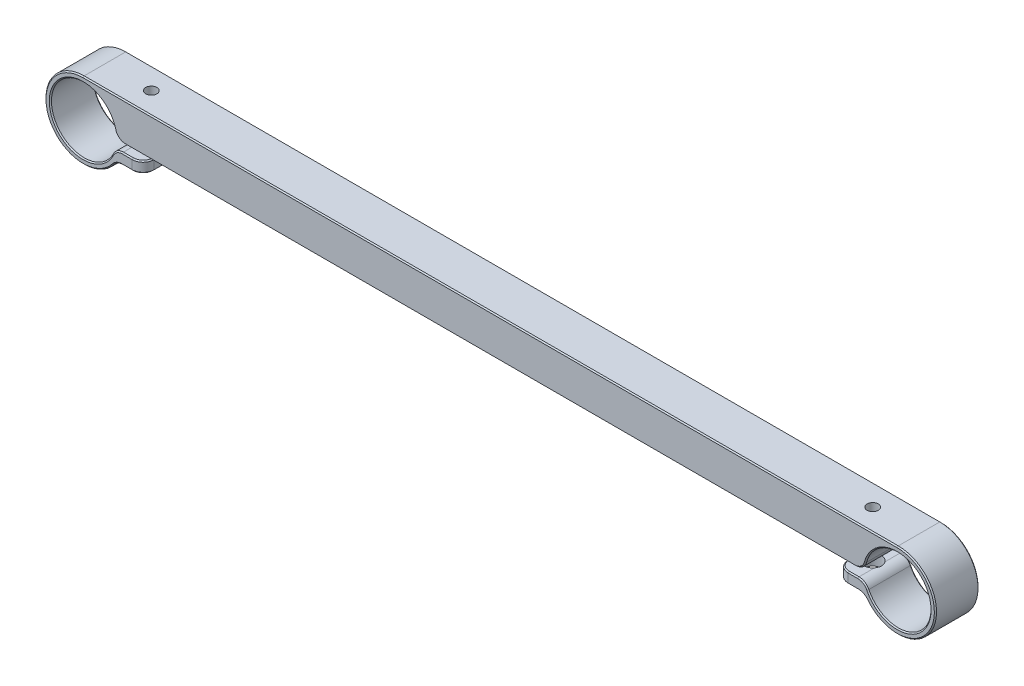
ISO-10303-21;
HEADER;
FILE_DESCRIPTION(('STEP AP214'),'2;1');
FILE_NAME('part.step','',(''),(''),'','','');
FILE_SCHEMA(('AUTOMOTIVE_DESIGN { 1 0 10303 214 1 1 1 1 }'));
ENDSEC;
DATA;
#1=APPLICATION_CONTEXT('core data for automotive mechanical design processes');
#2=APPLICATION_PROTOCOL_DEFINITION('international standard','automotive_design',2000,#1);
#3=PRODUCT_CONTEXT('',#1,'mechanical');
#4=PRODUCT('Part','Part','',(#3));
#5=PRODUCT_RELATED_PRODUCT_CATEGORY('part','',(#4));
#6=PRODUCT_DEFINITION_FORMATION('','',#4);
#7=PRODUCT_DEFINITION_CONTEXT('part definition',#1,'design');
#8=PRODUCT_DEFINITION('design','',#6,#7);
#9=PRODUCT_DEFINITION_SHAPE('','',#8);
#10=(LENGTH_UNIT() NAMED_UNIT(*) SI_UNIT(.MILLI.,.METRE.));
#11=(NAMED_UNIT(*) PLANE_ANGLE_UNIT() SI_UNIT($,.RADIAN.));
#12=(NAMED_UNIT(*) SI_UNIT($,.STERADIAN.) SOLID_ANGLE_UNIT());
#13=UNCERTAINTY_MEASURE_WITH_UNIT(LENGTH_MEASURE(1.E-05),#10,'distance_accuracy_value','');
#14=(GEOMETRIC_REPRESENTATION_CONTEXT(3) GLOBAL_UNCERTAINTY_ASSIGNED_CONTEXT((#13)) GLOBAL_UNIT_ASSIGNED_CONTEXT((#10,
#11,#12)) REPRESENTATION_CONTEXT('',''));
#15=CARTESIAN_POINT('',(0.,0.,0.));
#16=DIRECTION('',(0.,0.,1.));
#17=DIRECTION('',(1.,0.,0.));
#18=AXIS2_PLACEMENT_3D('',#15,#16,#17);
#19=CARTESIAN_POINT('',(-63.58,0.,-2.));
#20=DIRECTION('',(-1.,0.,0.));
#21=DIRECTION('',(0.,0.,1.));
#22=AXIS2_PLACEMENT_3D('',#19,#20,#21);
#23=PLANE('',#22);
#24=DIRECTION('',(0.,0.,1.));
#25=VECTOR('',#24,1.);
#26=CARTESIAN_POINT('',(-63.58,-3.29999999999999,-2.));
#27=LINE('',#26,#25);
#28=CARTESIAN_POINT('',(-63.579999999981,-3.29999999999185,2.));
#29=VERTEX_POINT('',#28);
#30=CARTESIAN_POINT('',(-63.5800000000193,-3.30000000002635,6.));
#31=VERTEX_POINT('',#30);
#32=EDGE_CURVE('E923',#29,#31,#27,.T.);
#33=ORIENTED_EDGE('',*,*,#32,.F.);
#34=DIRECTION('',(0.,-1.,0.));
#35=VECTOR('',#34,1.);
#36=CARTESIAN_POINT('',(-63.58,0.,2.));
#37=LINE('',#36,#35);
#38=CARTESIAN_POINT('',(-63.5800000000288,-1.6999999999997,2.));
#39=VERTEX_POINT('',#38);
#40=EDGE_CURVE('E1003',#39,#29,#37,.T.);
#41=ORIENTED_EDGE('',*,*,#40,.F.);
#42=DIRECTION('',(0.,0.,1.));
#43=VECTOR('',#42,1.);
#44=CARTESIAN_POINT('',(-63.58,-1.70000000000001,-2.));
#45=LINE('',#44,#43);
#46=CARTESIAN_POINT('',(-63.5799999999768,-1.70000000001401,6.));
#47=VERTEX_POINT('',#46);
#48=EDGE_CURVE('E912',#39,#47,#45,.T.);
#49=ORIENTED_EDGE('',*,*,#48,.T.);
#50=DIRECTION('',(0.,1.,0.));
#51=VECTOR('',#50,1.);
#52=CARTESIAN_POINT('',(-63.58,0.,6.));
#53=LINE('',#52,#51);
#54=EDGE_CURVE('E1007',#31,#47,#53,.T.);
#55=ORIENTED_EDGE('',*,*,#54,.F.);
#56=EDGE_LOOP('',(#33,#41,#49,#55));
#57=FACE_BOUND('',#56,.T.);
#58=ADVANCED_FACE('F17',(#57),#23,.F.);
#59=CARTESIAN_POINT('',(-65.58,0.,6.));
#60=DIRECTION('',(0.,1.,0.));
#61=DIRECTION('',(0.,0.,1.));
#62=AXIS2_PLACEMENT_3D('',#59,#60,#61);
#63=CYLINDRICAL_SURFACE('',#62,2.);
#64=ORIENTED_EDGE('',*,*,#54,.T.);
#65=CARTESIAN_POINT('',(-65.58,-1.70000000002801,6.));
#66=DIRECTION('',(0.,-1.,0.));
#67=DIRECTION('',(0.,0.,-1.));
#68=AXIS2_PLACEMENT_3D('',#65,#66,#67);
#69=CIRCLE('',#68,2.00000000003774);
#70=CARTESIAN_POINT('',(-65.58,-1.70000000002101,8.00000000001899));
#71=VERTEX_POINT('',#70);
#72=EDGE_CURVE('E906',#71,#47,#69,.F.);
#73=ORIENTED_EDGE('',*,*,#72,.F.);
#74=DIRECTION('',(0.,1.,0.));
#75=VECTOR('',#74,1.);
#76=CARTESIAN_POINT('',(-65.58,0.,8.));
#77=LINE('',#76,#75);
#78=CARTESIAN_POINT('',(-65.58,-3.30000000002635,7.99999999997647));
#79=VERTEX_POINT('',#78);
#80=EDGE_CURVE('E1019',#71,#79,#77,.F.);
#81=ORIENTED_EDGE('',*,*,#80,.T.);
#82=CARTESIAN_POINT('',(-65.58,-3.30000000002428,6.));
#83=DIRECTION('',(0.,1.,0.));
#84=DIRECTION('',(0.,0.,1.));
#85=AXIS2_PLACEMENT_3D('',#82,#83,#84);
#86=CIRCLE('',#85,1.99999999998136);
#87=EDGE_CURVE('E917',#31,#79,#86,.F.);
#88=ORIENTED_EDGE('',*,*,#87,.F.);
#89=EDGE_LOOP('',(#64,#73,#81,#88));
#90=FACE_BOUND('',#89,.T.);
#91=ADVANCED_FACE('F1427',(#90),#63,.T.);
#92=CARTESIAN_POINT('',(-65.58,0.,2.));
#93=DIRECTION('',(0.,-1.,0.));
#94=DIRECTION('',(0.,0.,-1.));
#95=AXIS2_PLACEMENT_3D('',#92,#93,#94);
#96=CYLINDRICAL_SURFACE('',#95,2.);
#97=DIRECTION('',(0.,-1.,0.));
#98=VECTOR('',#97,1.);
#99=CARTESIAN_POINT('',(-65.58,0.,0.));
#100=LINE('',#99,#98);
#101=CARTESIAN_POINT('',(-65.58,-3.29999999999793,-4.77482636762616E-12));
#102=VERTEX_POINT('',#101);
#103=CARTESIAN_POINT('',(-65.58,-1.6999999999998,2.8421709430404E-11));
#104=VERTEX_POINT('',#103);
#105=EDGE_CURVE('E995',#102,#104,#100,.F.);
#106=ORIENTED_EDGE('',*,*,#105,.T.);
#107=CARTESIAN_POINT('',(-65.58,-1.70000000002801,2.));
#108=DIRECTION('',(0.,-1.,0.));
#109=DIRECTION('',(0.,0.,-1.));
#110=AXIS2_PLACEMENT_3D('',#107,#108,#109);
#111=CIRCLE('',#110,2.);
#112=EDGE_CURVE('E895',#39,#104,#111,.F.);
#113=ORIENTED_EDGE('',*,*,#112,.F.);
#114=ORIENTED_EDGE('',*,*,#40,.T.);
#115=CARTESIAN_POINT('',(-65.58,-3.29999999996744,2.));
#116=DIRECTION('',(0.,1.,0.));
#117=DIRECTION('',(0.,0.,1.));
#118=AXIS2_PLACEMENT_3D('',#115,#116,#117);
#119=CIRCLE('',#118,2.00000000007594);
#120=EDGE_CURVE('E929',#102,#29,#119,.F.);
#121=ORIENTED_EDGE('',*,*,#120,.F.);
#122=EDGE_LOOP('',(#106,#113,#114,#121));
#123=FACE_BOUND('',#122,.T.);
#124=ADVANCED_FACE('F1424',(#123),#96,.T.);
#125=CARTESIAN_POINT('',(65.58,0.,2.));
#126=DIRECTION('',(0.,1.,0.));
#127=DIRECTION('',(0.,0.,1.));
#128=AXIS2_PLACEMENT_3D('',#125,#126,#127);
#129=CYLINDRICAL_SURFACE('',#128,2.);
#130=DIRECTION('',(0.,1.,0.));
#131=VECTOR('',#130,1.);
#132=CARTESIAN_POINT('',(63.58,0.,2.));
#133=LINE('',#132,#131);
#134=CARTESIAN_POINT('',(63.58,-1.70000000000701,2.));
#135=VERTEX_POINT('',#134);
#136=CARTESIAN_POINT('',(63.5799999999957,-3.29999999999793,2.));
#137=VERTEX_POINT('',#136);
#138=EDGE_CURVE('E979',#135,#137,#133,.F.);
#139=ORIENTED_EDGE('',*,*,#138,.F.);
#140=CARTESIAN_POINT('',(65.58,-1.70000000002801,2.));
#141=DIRECTION('',(0.,-1.,0.));
#142=DIRECTION('',(0.,0.,-1.));
#143=AXIS2_PLACEMENT_3D('',#140,#141,#142);
#144=CIRCLE('',#143,2.);
#145=CARTESIAN_POINT('',(65.58,-1.6999999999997,2.8421709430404E-11));
#146=VERTEX_POINT('',#145);
#147=EDGE_CURVE('E890',#146,#135,#144,.F.);
#148=ORIENTED_EDGE('',*,*,#147,.F.);
#149=DIRECTION('',(0.,1.,0.));
#150=VECTOR('',#149,1.);
#151=CARTESIAN_POINT('',(65.58,0.,0.));
#152=LINE('',#151,#150);
#153=CARTESIAN_POINT('',(65.58,-3.29999999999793,-4.77482636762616E-12));
#154=VERTEX_POINT('',#153);
#155=EDGE_CURVE('E991',#146,#154,#152,.F.);
#156=ORIENTED_EDGE('',*,*,#155,.T.);
#157=CARTESIAN_POINT('',(65.58,-3.29999999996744,2.));
#158=DIRECTION('',(0.,1.,0.));
#159=DIRECTION('',(0.,0.,1.));
#160=AXIS2_PLACEMENT_3D('',#157,#158,#159);
#161=CIRCLE('',#160,2.00000000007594);
#162=EDGE_CURVE('E939',#137,#154,#161,.F.);
#163=ORIENTED_EDGE('',*,*,#162,.F.);
#164=EDGE_LOOP('',(#139,#148,#156,#163));
#165=FACE_BOUND('',#164,.T.);
#166=ADVANCED_FACE('F1420',(#165),#129,.T.);
#167=CARTESIAN_POINT('',(63.58,0.,-2.));
#168=DIRECTION('',(-1.,0.,0.));
#169=DIRECTION('',(0.,0.,1.));
#170=AXIS2_PLACEMENT_3D('',#167,#168,#169);
#171=PLANE('',#170);
#172=DIRECTION('',(0.,-1.,0.));
#173=VECTOR('',#172,1.);
#174=CARTESIAN_POINT('',(63.58,0.,6.));
#175=LINE('',#174,#173);
#176=CARTESIAN_POINT('',(63.5799999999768,-1.70000000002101,6.));
#177=VERTEX_POINT('',#176);
#178=CARTESIAN_POINT('',(63.5800000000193,-3.30000000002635,6.00000000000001));
#179=VERTEX_POINT('',#178);
#180=EDGE_CURVE('E975',#177,#179,#175,.T.);
#181=ORIENTED_EDGE('',*,*,#180,.F.);
#182=DIRECTION('',(0.,0.,1.));
#183=VECTOR('',#182,1.);
#184=CARTESIAN_POINT('',(63.58,-1.70000000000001,-2.));
#185=LINE('',#184,#183);
#186=EDGE_CURVE('E884',#177,#135,#185,.F.);
#187=ORIENTED_EDGE('',*,*,#186,.T.);
#188=ORIENTED_EDGE('',*,*,#138,.T.);
#189=DIRECTION('',(0.,0.,1.));
#190=VECTOR('',#189,1.);
#191=CARTESIAN_POINT('',(63.58,-3.29999999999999,-2.));
#192=LINE('',#191,#190);
#193=EDGE_CURVE('E956',#179,#137,#192,.F.);
#194=ORIENTED_EDGE('',*,*,#193,.F.);
#195=EDGE_LOOP('',(#181,#187,#188,#194));
#196=FACE_BOUND('',#195,.T.);
#197=ADVANCED_FACE('F1416',(#196),#171,.T.);
#198=CARTESIAN_POINT('',(65.58,0.,6.));
#199=DIRECTION('',(0.,-1.,0.));
#200=DIRECTION('',(0.,0.,-1.));
#201=AXIS2_PLACEMENT_3D('',#198,#199,#200);
#202=CYLINDRICAL_SURFACE('',#201,2.);
#203=DIRECTION('',(0.,-1.,0.));
#204=VECTOR('',#203,1.);
#205=CARTESIAN_POINT('',(65.58,0.,8.));
#206=LINE('',#205,#204);
#207=CARTESIAN_POINT('',(65.58,-3.30000000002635,7.99999999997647));
#208=VERTEX_POINT('',#207);
#209=CARTESIAN_POINT('',(65.58,-1.70000000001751,8.00000000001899));
#210=VERTEX_POINT('',#209);
#211=EDGE_CURVE('E978',#208,#210,#206,.F.);
#212=ORIENTED_EDGE('',*,*,#211,.T.);
#213=CARTESIAN_POINT('',(65.58,-1.70000000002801,6.));
#214=DIRECTION('',(0.,-1.,0.));
#215=DIRECTION('',(0.,0.,-1.));
#216=AXIS2_PLACEMENT_3D('',#213,#214,#215);
#217=CIRCLE('',#216,2.00000000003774);
#218=EDGE_CURVE('E880',#177,#210,#217,.F.);
#219=ORIENTED_EDGE('',*,*,#218,.F.);
#220=ORIENTED_EDGE('',*,*,#180,.T.);
#221=CARTESIAN_POINT('',(65.58,-3.30000000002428,6.));
#222=DIRECTION('',(0.,1.,0.));
#223=DIRECTION('',(0.,0.,1.));
#224=AXIS2_PLACEMENT_3D('',#221,#222,#223);
#225=CIRCLE('',#224,1.99999999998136);
#226=EDGE_CURVE('E950',#208,#179,#225,.F.);
#227=ORIENTED_EDGE('',*,*,#226,.F.);
#228=EDGE_LOOP('',(#212,#219,#220,#227));
#229=FACE_BOUND('',#228,.T.);
#230=ADVANCED_FACE('F1412',(#229),#202,.T.);
#231=CARTESIAN_POINT('',(0.,6.,8.));
#232=DIRECTION('',(0.,1.,0.));
#233=DIRECTION('',(-1.,0.,0.));
#234=AXIS2_PLACEMENT_3D('',#231,#232,#233);
#235=PLANE('',#234);
#236=CARTESIAN_POINT('',(2.00000000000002,5.99999999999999,5.49999999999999));
#237=DIRECTION('',(0.,1.,0.));
#238=DIRECTION('',(-1.,0.,0.));
#239=AXIS2_PLACEMENT_3D('',#236,#237,#238);
#240=CIRCLE('',#239,1.5);
#241=CARTESIAN_POINT('',(2.00000000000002,5.99999999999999,6.99999999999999));
#242=VERTEX_POINT('',#241);
#243=CARTESIAN_POINT('',(0.500000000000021,5.99999999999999,5.5));
#244=VERTEX_POINT('',#243);
#245=EDGE_CURVE('E20',#242,#244,#240,.F.);
#246=ORIENTED_EDGE('',*,*,#245,.T.);
#247=DIRECTION('',(0.,0.,1.));
#248=VECTOR('',#247,1.);
#249=CARTESIAN_POINT('',(0.500000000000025,5.99999999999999,7.));
#250=LINE('',#249,#248);
#251=CARTESIAN_POINT('',(0.500000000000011,5.99999999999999,2.5));
#252=VERTEX_POINT('',#251);
#253=EDGE_CURVE('E804',#244,#252,#250,.F.);
#254=ORIENTED_EDGE('',*,*,#253,.T.);
#255=CARTESIAN_POINT('',(2.00000000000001,5.99999999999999,2.49999999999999));
#256=DIRECTION('',(0.,1.,0.));
#257=DIRECTION('',(-1.,0.,0.));
#258=AXIS2_PLACEMENT_3D('',#255,#256,#257);
#259=CIRCLE('',#258,1.5);
#260=CARTESIAN_POINT('',(2.,5.99999999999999,0.999999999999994));
#261=VERTEX_POINT('',#260);
#262=EDGE_CURVE('E821',#252,#261,#259,.F.);
#263=ORIENTED_EDGE('',*,*,#262,.T.);
#264=DIRECTION('',(-1.,0.,0.));
#265=VECTOR('',#264,1.);
#266=CARTESIAN_POINT('',(62.5,5.99999999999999,0.999999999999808));
#267=LINE('',#266,#265);
#268=CARTESIAN_POINT('',(61.,5.99999999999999,0.999999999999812));
#269=VERTEX_POINT('',#268);
#270=EDGE_CURVE('E826',#261,#269,#267,.F.);
#271=ORIENTED_EDGE('',*,*,#270,.T.);
#272=CARTESIAN_POINT('',(61.,5.99999999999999,2.49999999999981));
#273=DIRECTION('',(0.,1.,0.));
#274=DIRECTION('',(-1.,0.,0.));
#275=AXIS2_PLACEMENT_3D('',#272,#273,#274);
#276=CIRCLE('',#275,1.5);
#277=CARTESIAN_POINT('',(62.5,5.99999999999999,2.49999999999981));
#278=VERTEX_POINT('',#277);
#279=EDGE_CURVE('E843',#269,#278,#276,.F.);
#280=ORIENTED_EDGE('',*,*,#279,.T.);
#281=DIRECTION('',(0.,0.,-1.));
#282=VECTOR('',#281,1.);
#283=CARTESIAN_POINT('',(62.5,5.99999999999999,6.99999999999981));
#284=LINE('',#283,#282);
#285=CARTESIAN_POINT('',(62.5,5.99999999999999,5.49999999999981));
#286=VERTEX_POINT('',#285);
#287=EDGE_CURVE('E848',#278,#286,#284,.F.);
#288=ORIENTED_EDGE('',*,*,#287,.T.);
#289=CARTESIAN_POINT('',(61.,5.99999999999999,5.49999999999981));
#290=DIRECTION('',(0.,1.,0.));
#291=DIRECTION('',(-1.,0.,0.));
#292=AXIS2_PLACEMENT_3D('',#289,#290,#291);
#293=CIRCLE('',#292,1.5);
#294=CARTESIAN_POINT('',(61.,5.99999999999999,6.99999999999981));
#295=VERTEX_POINT('',#294);
#296=EDGE_CURVE('E864',#286,#295,#293,.F.);
#297=ORIENTED_EDGE('',*,*,#296,.T.);
#298=DIRECTION('',(1.,0.,0.));
#299=VECTOR('',#298,1.);
#300=CARTESIAN_POINT('',(62.5,5.99999999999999,6.99999999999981));
#301=LINE('',#300,#299);
#302=EDGE_CURVE('E869',#295,#242,#301,.F.);
#303=ORIENTED_EDGE('',*,*,#302,.T.);
#304=EDGE_LOOP('',(#246,#254,#263,#271,#280,#288,#297,#303));
#305=FACE_BOUND('',#304,.T.);
#306=ADVANCED_FACE('F1408',(#305),#235,.F.);
#307=CARTESIAN_POINT('',(0.,6.,8.));
#308=DIRECTION('',(0.,1.,0.));
#309=DIRECTION('',(-1.,0.,0.));
#310=AXIS2_PLACEMENT_3D('',#307,#308,#309);
#311=PLANE('',#310);
#312=CARTESIAN_POINT('',(-61.,5.99999999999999,5.5));
#313=DIRECTION('',(0.,1.,0.));
#314=DIRECTION('',(-1.,0.,0.));
#315=AXIS2_PLACEMENT_3D('',#312,#313,#314);
#316=CIRCLE('',#315,1.5);
#317=CARTESIAN_POINT('',(-61.,5.99999999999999,7.));
#318=VERTEX_POINT('',#317);
#319=CARTESIAN_POINT('',(-62.5,5.99999999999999,5.5));
#320=VERTEX_POINT('',#319);
#321=EDGE_CURVE('E799',#318,#320,#316,.F.);
#322=ORIENTED_EDGE('',*,*,#321,.T.);
#323=DIRECTION('',(0.,0.,1.));
#324=VECTOR('',#323,1.);
#325=CARTESIAN_POINT('',(-62.5,5.99999999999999,7.));
#326=LINE('',#325,#324);
#327=CARTESIAN_POINT('',(-62.5,5.99999999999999,2.5));
#328=VERTEX_POINT('',#327);
#329=EDGE_CURVE('E718',#320,#328,#326,.F.);
#330=ORIENTED_EDGE('',*,*,#329,.T.);
#331=CARTESIAN_POINT('',(-61.,5.99999999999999,2.5));
#332=DIRECTION('',(0.,1.,0.));
#333=DIRECTION('',(-1.,0.,0.));
#334=AXIS2_PLACEMENT_3D('',#331,#332,#333);
#335=CIRCLE('',#334,1.5);
#336=CARTESIAN_POINT('',(-61.,5.99999999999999,1.));
#337=VERTEX_POINT('',#336);
#338=EDGE_CURVE('E735',#328,#337,#335,.F.);
#339=ORIENTED_EDGE('',*,*,#338,.T.);
#340=DIRECTION('',(-1.,0.,0.));
#341=VECTOR('',#340,1.);
#342=CARTESIAN_POINT('',(-62.5,5.99999999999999,1.));
#343=LINE('',#342,#341);
#344=CARTESIAN_POINT('',(-2.,5.99999999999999,1.));
#345=VERTEX_POINT('',#344);
#346=EDGE_CURVE('E740',#337,#345,#343,.F.);
#347=ORIENTED_EDGE('',*,*,#346,.T.);
#348=CARTESIAN_POINT('',(-2.,5.99999999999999,2.5));
#349=DIRECTION('',(0.,1.,0.));
#350=DIRECTION('',(-1.,0.,0.));
#351=AXIS2_PLACEMENT_3D('',#348,#349,#350);
#352=CIRCLE('',#351,1.5);
#353=CARTESIAN_POINT('',(-0.500000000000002,5.99999999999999,2.5));
#354=VERTEX_POINT('',#353);
#355=EDGE_CURVE('E757',#345,#354,#352,.F.);
#356=ORIENTED_EDGE('',*,*,#355,.T.);
#357=DIRECTION('',(0.,0.,1.));
#358=VECTOR('',#357,1.);
#359=CARTESIAN_POINT('',(-0.500000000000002,5.99999999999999,7.));
#360=LINE('',#359,#358);
#361=CARTESIAN_POINT('',(-0.500000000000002,5.99999999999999,5.5));
#362=VERTEX_POINT('',#361);
#363=EDGE_CURVE('E762',#354,#362,#360,.T.);
#364=ORIENTED_EDGE('',*,*,#363,.T.);
#365=CARTESIAN_POINT('',(-2.,5.99999999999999,5.5));
#366=DIRECTION('',(0.,1.,0.));
#367=DIRECTION('',(-1.,0.,0.));
#368=AXIS2_PLACEMENT_3D('',#365,#366,#367);
#369=CIRCLE('',#368,1.5);
#370=CARTESIAN_POINT('',(-2.,5.99999999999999,7.));
#371=VERTEX_POINT('',#370);
#372=EDGE_CURVE('E778',#362,#371,#369,.F.);
#373=ORIENTED_EDGE('',*,*,#372,.T.);
#374=DIRECTION('',(1.,0.,0.));
#375=VECTOR('',#374,1.);
#376=CARTESIAN_POINT('',(-62.5,5.99999999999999,7.));
#377=LINE('',#376,#375);
#378=EDGE_CURVE('E783',#371,#318,#377,.F.);
#379=ORIENTED_EDGE('',*,*,#378,.T.);
#380=EDGE_LOOP('',(#322,#330,#339,#347,#356,#364,#373,#379));
#381=FACE_BOUND('',#380,.T.);
#382=ADVANCED_FACE('F1404',(#381),#311,.F.);
#383=CARTESIAN_POINT('',(63.58,-3.29999999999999,-2.));
#384=DIRECTION('',(-0.707106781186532,-0.707106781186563,0.));
#385=DIRECTION('',(0.707106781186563,-0.707106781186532,0.));
#386=AXIS2_PLACEMENT_3D('',#383,#384,#385);
#387=PLANE('',#386);
#388=DIRECTION('',(0.70710678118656,-0.707106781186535,0.));
#389=VECTOR('',#388,1.);
#390=CARTESIAN_POINT('',(-498932.42,498992.699999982,1.99999999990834));
#391=LINE('',#390,#389);
#392=CARTESIAN_POINT('',(63.7799999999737,-3.49999999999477,2.));
#393=VERTEX_POINT('',#392);
#394=EDGE_CURVE('E942',#393,#137,#391,.F.);
#395=ORIENTED_EDGE('',*,*,#394,.F.);
#396=DIRECTION('',(0.,0.,1.));
#397=VECTOR('',#396,1.);
#398=CARTESIAN_POINT('',(63.78,-3.5,-2.));
#399=LINE('',#398,#397);
#400=CARTESIAN_POINT('',(63.7799999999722,-3.50000000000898,6.00000000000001));
#401=VERTEX_POINT('',#400);
#402=EDGE_CURVE('E637',#393,#401,#399,.T.);
#403=ORIENTED_EDGE('',*,*,#402,.T.);
#404=DIRECTION('',(0.70710678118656,-0.707106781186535,0.));
#405=VECTOR('',#404,1.);
#406=CARTESIAN_POINT('',(-498928.42,498988.699999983,5.99999999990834));
#407=LINE('',#406,#405);
#408=EDGE_CURVE('E945',#179,#401,#407,.T.);
#409=ORIENTED_EDGE('',*,*,#408,.F.);
#410=ORIENTED_EDGE('',*,*,#193,.T.);
#411=EDGE_LOOP('',(#395,#403,#409,#410));
#412=FACE_BOUND('',#411,.T.);
#413=ADVANCED_FACE('F1400',(#412),#387,.T.);
#414=CARTESIAN_POINT('',(65.58,-3.30000000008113,6.));
#415=DIRECTION('',(0.,1.,0.));
#416=DIRECTION('',(0.,0.,1.));
#417=AXIS2_PLACEMENT_3D('',#414,#415,#416);
#418=CONICAL_SURFACE('',#417,1.99999999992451,0.785398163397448);
#419=ORIENTED_EDGE('',*,*,#408,.T.);
#420=CARTESIAN_POINT('',(65.58,-3.49999999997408,6.));
#421=DIRECTION('',(0.,1.,0.));
#422=DIRECTION('',(0.,0.,1.));
#423=AXIS2_PLACEMENT_3D('',#420,#421,#422);
#424=CIRCLE('',#423,1.80000000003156);
#425=CARTESIAN_POINT('',(65.58,-3.49999999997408,7.80000000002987));
#426=VERTEX_POINT('',#425);
#427=EDGE_CURVE('E634',#401,#426,#424,.T.);
#428=ORIENTED_EDGE('',*,*,#427,.T.);
#429=DIRECTION('',(0.,-0.707106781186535,-0.70710678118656));
#430=VECTOR('',#429,1.);
#431=CARTESIAN_POINT('',(65.58,498988.699999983,499000.));
#432=LINE('',#431,#430);
#433=EDGE_CURVE('E953',#426,#208,#432,.F.);
#434=ORIENTED_EDGE('',*,*,#433,.T.);
#435=ORIENTED_EDGE('',*,*,#226,.T.);
#436=EDGE_LOOP('',(#419,#428,#434,#435));
#437=FACE_BOUND('',#436,.T.);
#438=ADVANCED_FACE('F1396',(#437),#418,.T.);
#439=CARTESIAN_POINT('',(65.58,-3.30000000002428,2.));
#440=DIRECTION('',(0.,1.,0.));
#441=DIRECTION('',(0.,0.,1.));
#442=AXIS2_PLACEMENT_3D('',#439,#440,#441);
#443=CONICAL_SURFACE('',#442,1.99999999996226,0.78539816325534);
#444=DIRECTION('',(0.,-0.707106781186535,0.70710678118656));
#445=VECTOR('',#444,1.);
#446=CARTESIAN_POINT('',(65.5800000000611,498992.699999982,-498996.));
#447=LINE('',#446,#445);
#448=CARTESIAN_POINT('',(65.58,-3.49999999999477,0.199999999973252));
#449=VERTEX_POINT('',#448);
#450=EDGE_CURVE('E935',#154,#449,#447,.T.);
#451=ORIENTED_EDGE('',*,*,#450,.T.);
#452=CARTESIAN_POINT('',(65.58,-3.50000000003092,2.));
#453=DIRECTION('',(0.,1.,0.));
#454=DIRECTION('',(0.,0.,1.));
#455=AXIS2_PLACEMENT_3D('',#452,#453,#454);
#456=CIRCLE('',#455,1.80000000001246);
#457=EDGE_CURVE('E629',#449,#393,#456,.T.);
#458=ORIENTED_EDGE('',*,*,#457,.T.);
#459=ORIENTED_EDGE('',*,*,#394,.T.);
#460=ORIENTED_EDGE('',*,*,#162,.T.);
#461=EDGE_LOOP('',(#451,#458,#459,#460));
#462=FACE_BOUND('',#461,.T.);
#463=ADVANCED_FACE('F1392',(#462),#443,.T.);
#464=CARTESIAN_POINT('',(-65.58,-3.30000000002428,2.));
#465=DIRECTION('',(0.,1.,0.));
#466=DIRECTION('',(0.,0.,1.));
#467=AXIS2_PLACEMENT_3D('',#464,#465,#466);
#468=CONICAL_SURFACE('',#467,1.99999999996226,0.78539816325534);
#469=DIRECTION('',(0.,-0.707106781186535,0.70710678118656));
#470=VECTOR('',#469,1.);
#471=CARTESIAN_POINT('',(-65.5799999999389,498992.699999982,-498996.));
#472=LINE('',#471,#470);
#473=CARTESIAN_POINT('',(-65.58,-3.49999999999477,0.199999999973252));
#474=VERTEX_POINT('',#473);
#475=EDGE_CURVE('E932',#474,#102,#472,.F.);
#476=ORIENTED_EDGE('',*,*,#475,.T.);
#477=ORIENTED_EDGE('',*,*,#120,.T.);
#478=DIRECTION('',(0.707106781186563,0.707106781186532,0.));
#479=VECTOR('',#478,1.);
#480=CARTESIAN_POINT('',(-63.78,-3.5,2.));
#481=LINE('',#480,#479);
#482=CARTESIAN_POINT('',(-63.7800000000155,-3.50000000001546,2.));
#483=VERTEX_POINT('',#482);
#484=EDGE_CURVE('E926',#483,#29,#481,.T.);
#485=ORIENTED_EDGE('',*,*,#484,.F.);
#486=CARTESIAN_POINT('',(-65.58,-3.50000000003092,2.));
#487=DIRECTION('',(0.,1.,0.));
#488=DIRECTION('',(0.,0.,1.));
#489=AXIS2_PLACEMENT_3D('',#486,#487,#488);
#490=CIRCLE('',#489,1.80000000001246);
#491=EDGE_CURVE('E620',#474,#483,#490,.F.);
#492=ORIENTED_EDGE('',*,*,#491,.F.);
#493=EDGE_LOOP('',(#476,#477,#485,#492));
#494=FACE_BOUND('',#493,.T.);
#495=ADVANCED_FACE('F1388',(#494),#468,.T.);
#496=CARTESIAN_POINT('',(-63.78,-3.5,-2.));
#497=DIRECTION('',(0.707106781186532,-0.707106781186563,0.));
#498=DIRECTION('',(0.707106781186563,0.707106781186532,0.));
#499=AXIS2_PLACEMENT_3D('',#496,#497,#498);
#500=PLANE('',#499);
#501=ORIENTED_EDGE('',*,*,#484,.T.);
#502=ORIENTED_EDGE('',*,*,#32,.T.);
#503=DIRECTION('',(-0.70710678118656,-0.707106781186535,0.));
#504=VECTOR('',#503,1.);
#505=CARTESIAN_POINT('',(498928.42,498988.699999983,6.00000000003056));
#506=LINE('',#505,#504);
#507=CARTESIAN_POINT('',(-63.7799999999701,-3.49999999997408,6.));
#508=VERTEX_POINT('',#507);
#509=EDGE_CURVE('E920',#508,#31,#506,.F.);
#510=ORIENTED_EDGE('',*,*,#509,.F.);
#511=DIRECTION('',(0.,0.,-1.));
#512=VECTOR('',#511,1.);
#513=CARTESIAN_POINT('',(-63.78,-3.5,-2.));
#514=LINE('',#513,#512);
#515=EDGE_CURVE('E616',#483,#508,#514,.F.);
#516=ORIENTED_EDGE('',*,*,#515,.F.);
#517=EDGE_LOOP('',(#501,#502,#510,#516));
#518=FACE_BOUND('',#517,.T.);
#519=ADVANCED_FACE('F1384',(#518),#500,.T.);
#520=CARTESIAN_POINT('',(-65.58,-3.30000000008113,6.));
#521=DIRECTION('',(0.,1.,0.));
#522=DIRECTION('',(0.,0.,1.));
#523=AXIS2_PLACEMENT_3D('',#520,#521,#522);
#524=CONICAL_SURFACE('',#523,1.99999999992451,0.785398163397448);
#525=DIRECTION('',(0.,-0.707106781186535,-0.70710678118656));
#526=VECTOR('',#525,1.);
#527=CARTESIAN_POINT('',(-65.58,498988.699999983,499000.));
#528=LINE('',#527,#526);
#529=CARTESIAN_POINT('',(-65.58,-3.49999999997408,7.80000000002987));
#530=VERTEX_POINT('',#529);
#531=EDGE_CURVE('E915',#79,#530,#528,.T.);
#532=ORIENTED_EDGE('',*,*,#531,.T.);
#533=CARTESIAN_POINT('',(-65.58,-3.49999999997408,6.));
#534=DIRECTION('',(0.,1.,0.));
#535=DIRECTION('',(0.,0.,1.));
#536=AXIS2_PLACEMENT_3D('',#533,#534,#535);
#537=CIRCLE('',#536,1.80000000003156);
#538=EDGE_CURVE('E619',#508,#530,#537,.F.);
#539=ORIENTED_EDGE('',*,*,#538,.F.);
#540=ORIENTED_EDGE('',*,*,#509,.T.);
#541=ORIENTED_EDGE('',*,*,#87,.T.);
#542=EDGE_LOOP('',(#532,#539,#540,#541));
#543=FACE_BOUND('',#542,.T.);
#544=ADVANCED_FACE('F1380',(#543),#524,.T.);
#545=CARTESIAN_POINT('',(-63.58,-1.70000000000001,-2.));
#546=DIRECTION('',(-0.707106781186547,-0.707106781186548,0.));
#547=DIRECTION('',(0.707106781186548,-0.707106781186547,0.));
#548=AXIS2_PLACEMENT_3D('',#545,#546,#547);
#549=PLANE('',#548);
#550=ORIENTED_EDGE('',*,*,#48,.F.);
#551=DIRECTION('',(-0.70710678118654,0.707106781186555,0.));
#552=VECTOR('',#551,1.);
#553=CARTESIAN_POINT('',(498934.71999999,-499000.,1.99999999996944));
#554=LINE('',#553,#552);
#555=CARTESIAN_POINT('',(-63.780000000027,-1.50000000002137,2.));
#556=VERTEX_POINT('',#555);
#557=EDGE_CURVE('E898',#556,#39,#554,.F.);
#558=ORIENTED_EDGE('',*,*,#557,.F.);
#559=DIRECTION('',(0.,0.,-1.));
#560=VECTOR('',#559,1.);
#561=CARTESIAN_POINT('',(-63.78,-1.50000000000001,-2.));
#562=LINE('',#561,#560);
#563=CARTESIAN_POINT('',(-63.7799999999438,-1.50000000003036,6.));
#564=VERTEX_POINT('',#563);
#565=EDGE_CURVE('E601',#556,#564,#562,.F.);
#566=ORIENTED_EDGE('',*,*,#565,.T.);
#567=DIRECTION('',(-0.707106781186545,0.70710678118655,0.));
#568=VECTOR('',#567,1.);
#569=CARTESIAN_POINT('',(498934.719999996,-499000.,5.99999999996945));
#570=LINE('',#569,#568);
#571=EDGE_CURVE('E901',#47,#564,#570,.T.);
#572=ORIENTED_EDGE('',*,*,#571,.F.);
#573=EDGE_LOOP('',(#550,#558,#566,#572));
#574=FACE_BOUND('',#573,.T.);
#575=ADVANCED_FACE('F1376',(#574),#549,.F.);
#576=CARTESIAN_POINT('',(-65.58,-1.70000000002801,6.));
#577=DIRECTION('',(0.,-1.,0.));
#578=DIRECTION('',(1.,0.,0.));
#579=AXIS2_PLACEMENT_3D('',#576,#577,#578);
#580=CONICAL_SURFACE('',#579,2.00000000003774,0.785398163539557);
#581=ORIENTED_EDGE('',*,*,#571,.T.);
#582=CARTESIAN_POINT('',(-65.58,-1.50000000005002,6.));
#583=DIRECTION('',(0.,-1.,0.));
#584=DIRECTION('',(1.,0.,0.));
#585=AXIS2_PLACEMENT_3D('',#582,#583,#584);
#586=CIRCLE('',#585,1.80000000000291);
#587=CARTESIAN_POINT('',(-65.58,-1.50000000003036,7.80000000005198));
#588=VERTEX_POINT('',#587);
#589=EDGE_CURVE('E603',#564,#588,#586,.T.);
#590=ORIENTED_EDGE('',*,*,#589,.T.);
#591=DIRECTION('',(0.,0.70710678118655,-0.707106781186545));
#592=VECTOR('',#591,1.);
#593=CARTESIAN_POINT('',(-65.5799999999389,-499000.,499006.299999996));
#594=LINE('',#593,#592);
#595=EDGE_CURVE('E909',#588,#71,#594,.F.);
#596=ORIENTED_EDGE('',*,*,#595,.T.);
#597=ORIENTED_EDGE('',*,*,#72,.T.);
#598=EDGE_LOOP('',(#581,#590,#596,#597));
#599=FACE_BOUND('',#598,.T.);
#600=ADVANCED_FACE('F1372',(#599),#580,.T.);
#601=CARTESIAN_POINT('',(-65.58,-1.69999999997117,2.));
#602=DIRECTION('',(0.,-1.,0.));
#603=DIRECTION('',(0.,0.,-1.));
#604=AXIS2_PLACEMENT_3D('',#601,#602,#603);
#605=CONICAL_SURFACE('',#604,1.99999999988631,0.785398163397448);
#606=DIRECTION('',(0.,0.707106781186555,0.70710678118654));
#607=VECTOR('',#606,1.);
#608=CARTESIAN_POINT('',(-65.58,-499000.,-498998.29999999));
#609=LINE('',#608,#607);
#610=CARTESIAN_POINT('',(-65.58,-1.50000000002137,0.200000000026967));
#611=VERTEX_POINT('',#610);
#612=EDGE_CURVE('E891',#104,#611,#609,.T.);
#613=ORIENTED_EDGE('',*,*,#612,.T.);
#614=CARTESIAN_POINT('',(-65.58,-1.50000000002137,2.));
#615=DIRECTION('',(0.,-1.,0.));
#616=DIRECTION('',(0.,0.,-1.));
#617=AXIS2_PLACEMENT_3D('',#614,#615,#616);
#618=CIRCLE('',#617,1.79999999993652);
#619=EDGE_CURVE('E592',#611,#556,#618,.T.);
#620=ORIENTED_EDGE('',*,*,#619,.T.);
#621=ORIENTED_EDGE('',*,*,#557,.T.);
#622=ORIENTED_EDGE('',*,*,#112,.T.);
#623=EDGE_LOOP('',(#613,#620,#621,#622));
#624=FACE_BOUND('',#623,.T.);
#625=ADVANCED_FACE('F1368',(#624),#605,.T.);
#626=CARTESIAN_POINT('',(-66.08,-13.5,4.));
#627=DIRECTION('',(0.,1.,0.));
#628=DIRECTION('',(0.,0.,1.));
#629=AXIS2_PLACEMENT_3D('',#626,#627,#628);
#630=CYLINDRICAL_SURFACE('',#629,1.625);
#631=CARTESIAN_POINT('',(-67.3862527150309,-1.50000000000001,4.96660687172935));
#632=CARTESIAN_POINT('',(-67.4133747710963,-1.50000315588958,4.92995472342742));
#633=CARTESIAN_POINT('',(-67.4389362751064,-1.50055107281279,4.89218343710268));
#634=CARTESIAN_POINT('',(-67.4867867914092,-1.50238445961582,4.81464869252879));
#635=CARTESIAN_POINT('',(-67.5090764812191,-1.50366977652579,4.77488564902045));
#636=CARTESIAN_POINT('',(-67.5707904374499,-1.50810193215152,4.65302609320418));
#637=CARTESIAN_POINT('',(-67.6051079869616,-1.51182622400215,4.56829359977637));
#638=CARTESIAN_POINT('',(-67.6590749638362,-1.5185071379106,4.39428014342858));
#639=CARTESIAN_POINT('',(-67.6787222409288,-1.52146364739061,4.30499851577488));
#640=CARTESIAN_POINT('',(-67.7027864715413,-1.52516880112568,4.12439830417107));
#641=CARTESIAN_POINT('',(-67.7072134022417,-1.52591889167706,4.03308109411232));
#642=CARTESIAN_POINT('',(-67.7007344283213,-1.52487701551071,3.85144151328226));
#643=CARTESIAN_POINT('',(-67.6898992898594,-1.52309678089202,3.76111649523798));
#644=CARTESIAN_POINT('',(-67.6533428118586,-1.51783013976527,3.58354411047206));
#645=CARTESIAN_POINT('',(-67.62761690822,-1.51434321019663,3.49629769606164));
#646=CARTESIAN_POINT('',(-67.5686631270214,-1.50816253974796,3.34446139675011));
#647=CARTESIAN_POINT('',(-67.5380080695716,-1.50545112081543,3.27886032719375));
#648=CARTESIAN_POINT('',(-67.4682931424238,-1.50138727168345,3.15236009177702));
#649=CARTESIAN_POINT('',(-67.4292442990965,-1.50003307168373,3.09145489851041));
#650=CARTESIAN_POINT('',(-67.3862527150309,-1.50000000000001,3.03339312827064));
#651=B_SPLINE_CURVE_WITH_KNOTS('',3,(#631,#632,#633,#634,#635,#636,#637,#638,#639,#640,#641,
#642,#643,#644,#645,#646,#647,#648,#649,#650),.UNSPECIFIED.,.F.,.F.,(4,2,2,2,2,2,2,2,2,4),(0.,
0.136691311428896,0.273354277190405,0.546438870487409,0.81956348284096,1.09250902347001,
1.36419314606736,1.63596058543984,1.85271411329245,2.06918462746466),.UNSPECIFIED.);
#652=CARTESIAN_POINT('',(-67.3862527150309,-1.50000000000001,4.96660687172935));
#653=VERTEX_POINT('',#652);
#654=CARTESIAN_POINT('',(-67.3862527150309,-1.50000000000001,3.03339312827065));
#655=VERTEX_POINT('',#654);
#656=EDGE_CURVE('E581',#653,#655,#651,.T.);
#657=ORIENTED_EDGE('',*,*,#656,.F.);
#658=CARTESIAN_POINT('',(-66.08,-1.50000000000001,4.));
#659=DIRECTION('',(0.,1.,0.));
#660=DIRECTION('',(0.,0.,1.));
#661=AXIS2_PLACEMENT_3D('',#658,#659,#660);
#662=CIRCLE('',#661,1.625);
#663=EDGE_CURVE('E2878',#653,#655,#662,.T.);
#664=ORIENTED_EDGE('',*,*,#663,.T.);
#665=EDGE_LOOP('',(#657,#664));
#666=FACE_BOUND('',#665,.T.);
#667=CARTESIAN_POINT('',(-66.08,-3.5,4.));
#668=DIRECTION('',(0.,1.,0.));
#669=DIRECTION('',(0.,0.,1.));
#670=AXIS2_PLACEMENT_3D('',#667,#668,#669);
#671=CIRCLE('',#670,1.625);
#672=CARTESIAN_POINT('',(-66.08,-3.5,5.625));
#673=VERTEX_POINT('',#672);
#674=EDGE_CURVE('E604',#673,#673,#671,.T.);
#675=ORIENTED_EDGE('',*,*,#674,.F.);
#676=EDGE_LOOP('',(#675));
#677=FACE_BOUND('',#676,.T.);
#678=ADVANCED_FACE('F1363',(#666,#677),#630,.F.);
#679=CARTESIAN_POINT('',(65.58,-1.69999999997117,2.));
#680=DIRECTION('',(0.,-1.,0.));
#681=DIRECTION('',(0.,0.,-1.));
#682=AXIS2_PLACEMENT_3D('',#679,#680,#681);
#683=CONICAL_SURFACE('',#682,1.99999999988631,0.785398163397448);
#684=DIRECTION('',(0.,0.707106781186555,0.70710678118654));
#685=VECTOR('',#684,1.);
#686=CARTESIAN_POINT('',(65.58,-499000.,-498998.29999999));
#687=LINE('',#686,#685);
#688=CARTESIAN_POINT('',(65.58,-1.50000000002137,0.200000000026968));
#689=VERTEX_POINT('',#688);
#690=EDGE_CURVE('E887',#689,#146,#687,.F.);
#691=ORIENTED_EDGE('',*,*,#690,.T.);
#692=ORIENTED_EDGE('',*,*,#147,.T.);
#693=DIRECTION('',(0.707106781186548,0.707106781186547,0.));
#694=VECTOR('',#693,1.);
#695=CARTESIAN_POINT('',(63.78,-1.50000000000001,2.));
#696=LINE('',#695,#694);
#697=CARTESIAN_POINT('',(63.7799999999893,-1.50000000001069,2.));
#698=VERTEX_POINT('',#697);
#699=EDGE_CURVE('E875',#135,#698,#696,.T.);
#700=ORIENTED_EDGE('',*,*,#699,.T.);
#701=CARTESIAN_POINT('',(65.58,-1.50000000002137,2.));
#702=DIRECTION('',(0.,-1.,0.));
#703=DIRECTION('',(0.,0.,-1.));
#704=AXIS2_PLACEMENT_3D('',#701,#702,#703);
#705=CIRCLE('',#704,1.79999999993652);
#706=EDGE_CURVE('E529',#689,#698,#705,.F.);
#707=ORIENTED_EDGE('',*,*,#706,.F.);
#708=EDGE_LOOP('',(#691,#692,#700,#707));
#709=FACE_BOUND('',#708,.T.);
#710=ADVANCED_FACE('F1360',(#709),#683,.T.);
#711=CARTESIAN_POINT('',(63.78,-1.50000000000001,-2.));
#712=DIRECTION('',(0.707106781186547,-0.707106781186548,0.));
#713=DIRECTION('',(0.707106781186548,0.707106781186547,0.));
#714=AXIS2_PLACEMENT_3D('',#711,#712,#713);
#715=PLANE('',#714);
#716=DIRECTION('',(0.,0.,1.));
#717=VECTOR('',#716,1.);
#718=CARTESIAN_POINT('',(63.78,-1.50000000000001,-2.));
#719=LINE('',#718,#717);
#720=CARTESIAN_POINT('',(63.7799999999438,-1.50000000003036,6.));
#721=VERTEX_POINT('',#720);
#722=EDGE_CURVE('E519',#698,#721,#719,.T.);
#723=ORIENTED_EDGE('',*,*,#722,.F.);
#724=ORIENTED_EDGE('',*,*,#699,.F.);
#725=ORIENTED_EDGE('',*,*,#186,.F.);
#726=DIRECTION('',(0.707106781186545,0.70710678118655,0.));
#727=VECTOR('',#726,1.);
#728=CARTESIAN_POINT('',(-498934.719999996,-499000.,6.00000000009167));
#729=LINE('',#728,#727);
#730=EDGE_CURVE('E874',#721,#177,#729,.F.);
#731=ORIENTED_EDGE('',*,*,#730,.F.);
#732=EDGE_LOOP('',(#723,#724,#725,#731));
#733=FACE_BOUND('',#732,.T.);
#734=ADVANCED_FACE('F1356',(#733),#715,.F.);
#735=CARTESIAN_POINT('',(65.58,-1.70000000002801,6.));
#736=DIRECTION('',(0.,-1.,0.));
#737=DIRECTION('',(1.,0.,0.));
#738=AXIS2_PLACEMENT_3D('',#735,#736,#737);
#739=CONICAL_SURFACE('',#738,2.00000000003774,0.785398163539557);
#740=ORIENTED_EDGE('',*,*,#730,.T.);
#741=ORIENTED_EDGE('',*,*,#218,.T.);
#742=DIRECTION('',(0.,0.70710678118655,-0.707106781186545));
#743=VECTOR('',#742,1.);
#744=CARTESIAN_POINT('',(65.5800000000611,-499000.,499006.299999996));
#745=LINE('',#744,#743);
#746=CARTESIAN_POINT('',(65.58,-1.50000000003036,7.80000000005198));
#747=VERTEX_POINT('',#746);
#748=EDGE_CURVE('E872',#210,#747,#745,.T.);
#749=ORIENTED_EDGE('',*,*,#748,.T.);
#750=CARTESIAN_POINT('',(65.58,-1.50000000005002,6.));
#751=DIRECTION('',(0.,-1.,0.));
#752=DIRECTION('',(1.,0.,0.));
#753=AXIS2_PLACEMENT_3D('',#750,#751,#752);
#754=CIRCLE('',#753,1.80000000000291);
#755=EDGE_CURVE('E517',#721,#747,#754,.F.);
#756=ORIENTED_EDGE('',*,*,#755,.F.);
#757=EDGE_LOOP('',(#740,#741,#749,#756));
#758=FACE_BOUND('',#757,.T.);
#759=ADVANCED_FACE('F1352',(#758),#739,.T.);
#760=CARTESIAN_POINT('',(66.08,-13.5,4.));
#761=DIRECTION('',(0.,1.,0.));
#762=DIRECTION('',(0.,0.,1.));
#763=AXIS2_PLACEMENT_3D('',#760,#761,#762);
#764=CYLINDRICAL_SURFACE('',#763,1.625);
#765=CARTESIAN_POINT('',(66.08,-1.50000000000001,4.));
#766=DIRECTION('',(0.,1.,0.));
#767=DIRECTION('',(0.,0.,1.));
#768=AXIS2_PLACEMENT_3D('',#765,#766,#767);
#769=CIRCLE('',#768,1.625);
#770=CARTESIAN_POINT('',(67.3862527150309,-1.50000000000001,4.9666068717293));
#771=VERTEX_POINT('',#770);
#772=CARTESIAN_POINT('',(67.3862527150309,-1.50000000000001,3.0333931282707));
#773=VERTEX_POINT('',#772);
#774=EDGE_CURVE('E493',#771,#773,#769,.F.);
#775=ORIENTED_EDGE('',*,*,#774,.F.);
#776=CARTESIAN_POINT('',(67.3862527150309,-1.50000000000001,3.0333931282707));
#777=CARTESIAN_POINT('',(67.4133747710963,-1.50000315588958,3.07004527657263));
#778=CARTESIAN_POINT('',(67.4389362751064,-1.50055107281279,3.10781656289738));
#779=CARTESIAN_POINT('',(67.4867867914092,-1.50238445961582,3.18535130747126));
#780=CARTESIAN_POINT('',(67.5090764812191,-1.50366977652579,3.22511435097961));
#781=CARTESIAN_POINT('',(67.5707904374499,-1.50810193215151,3.34697390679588));
#782=CARTESIAN_POINT('',(67.6051079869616,-1.51182622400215,3.43170640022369));
#783=CARTESIAN_POINT('',(67.6590749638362,-1.5185071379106,3.60571985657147));
#784=CARTESIAN_POINT('',(67.6787222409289,-1.5214636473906,3.69500148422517));
#785=CARTESIAN_POINT('',(67.7027864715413,-1.52516880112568,3.87560169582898));
#786=CARTESIAN_POINT('',(67.7072134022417,-1.52591889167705,3.96691890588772));
#787=CARTESIAN_POINT('',(67.7007344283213,-1.5248770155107,4.14855848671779));
#788=CARTESIAN_POINT('',(67.6898992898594,-1.52309678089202,4.23888350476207));
#789=CARTESIAN_POINT('',(67.6533428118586,-1.51783013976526,4.41645588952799));
#790=CARTESIAN_POINT('',(67.62761690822,-1.51434321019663,4.5037023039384));
#791=CARTESIAN_POINT('',(67.5686631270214,-1.50816253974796,4.65553860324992));
#792=CARTESIAN_POINT('',(67.5380080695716,-1.50545112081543,4.72113967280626));
#793=CARTESIAN_POINT('',(67.4682931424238,-1.50138727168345,4.84763990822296));
#794=CARTESIAN_POINT('',(67.4292442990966,-1.50003307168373,4.90854510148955));
#795=CARTESIAN_POINT('',(67.3862527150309,-1.50000000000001,4.9666068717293));
#796=B_SPLINE_CURVE_WITH_KNOTS('',3,(#776,#777,#778,#779,#780,#781,#782,#783,#784,#785,#786,
#787,#788,#789,#790,#791,#792,#793,#794,#795),.UNSPECIFIED.,.F.,.F.,(4,2,2,2,2,2,2,2,2,4),(0.,
0.136691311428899,0.273354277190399,0.546438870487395,0.819563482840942,1.09250902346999,
1.36419314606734,1.63596058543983,1.85271411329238,2.06918462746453),.UNSPECIFIED.);
#797=EDGE_CURVE('E497',#773,#771,#796,.T.);
#798=ORIENTED_EDGE('',*,*,#797,.F.);
#799=EDGE_LOOP('',(#775,#798));
#800=FACE_BOUND('',#799,.T.);
#801=CARTESIAN_POINT('',(66.08,-3.5,4.));
#802=DIRECTION('',(0.,1.,0.));
#803=DIRECTION('',(0.,0.,1.));
#804=AXIS2_PLACEMENT_3D('',#801,#802,#803);
#805=CIRCLE('',#804,1.625);
#806=CARTESIAN_POINT('',(66.08,-3.5,5.625));
#807=VERTEX_POINT('',#806);
#808=EDGE_CURVE('E2873',#807,#807,#805,.F.);
#809=ORIENTED_EDGE('',*,*,#808,.T.);
#810=EDGE_LOOP('',(#809));
#811=FACE_BOUND('',#810,.T.);
#812=ADVANCED_FACE('F495',(#800,#811),#764,.F.);
#813=CARTESIAN_POINT('',(2.00000000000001,69.2896460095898,5.49999999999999));
#814=DIRECTION('',(0.,1.,0.));
#815=DIRECTION('',(-1.,0.,0.));
#816=AXIS2_PLACEMENT_3D('',#813,#814,#815);
#817=CYLINDRICAL_SURFACE('',#816,1.5);
#818=CARTESIAN_POINT('',(2.00000000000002,0.200000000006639,5.49999999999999));
#819=DIRECTION('',(0.,-1.,0.));
#820=DIRECTION('',(0.,0.,-1.));
#821=AXIS2_PLACEMENT_3D('',#818,#819,#820);
#822=CIRCLE('',#821,1.4999999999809);
#823=CARTESIAN_POINT('',(2.00000000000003,0.200000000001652,6.99999999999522));
#824=VERTEX_POINT('',#823);
#825=CARTESIAN_POINT('',(0.500000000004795,0.200000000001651,5.5));
#826=VERTEX_POINT('',#825);
#827=EDGE_CURVE('E565',#824,#826,#822,.T.);
#828=ORIENTED_EDGE('',*,*,#827,.T.);
#829=DIRECTION('',(0.,1.,0.));
#830=VECTOR('',#829,1.);
#831=CARTESIAN_POINT('',(0.500000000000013,69.2896460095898,5.5));
#832=LINE('',#831,#830);
#833=EDGE_CURVE('E796',#826,#244,#832,.T.);
#834=ORIENTED_EDGE('',*,*,#833,.T.);
#835=ORIENTED_EDGE('',*,*,#245,.F.);
#836=DIRECTION('',(0.,1.,0.));
#837=VECTOR('',#836,1.);
#838=CARTESIAN_POINT('',(2.00000000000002,69.2896460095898,6.99999999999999));
#839=LINE('',#838,#837);
#840=EDGE_CURVE('E867',#242,#824,#839,.F.);
#841=ORIENTED_EDGE('',*,*,#840,.T.);
#842=EDGE_LOOP('',(#828,#834,#835,#841));
#843=FACE_BOUND('',#842,.T.);
#844=ADVANCED_FACE('F1351',(#843),#817,.F.);
#845=CARTESIAN_POINT('',(62.5,69.2896460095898,6.99999999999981));
#846=DIRECTION('',(0.,0.,1.));
#847=DIRECTION('',(1.,0.,0.));
#848=AXIS2_PLACEMENT_3D('',#845,#846,#847);
#849=PLANE('',#848);
#850=DIRECTION('',(1.,0.,0.));
#851=VECTOR('',#850,1.);
#852=CARTESIAN_POINT('',(62.5,0.199999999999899,6.9999999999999));
#853=LINE('',#852,#851);
#854=CARTESIAN_POINT('',(61.,0.200000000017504,6.99999999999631));
#855=VERTEX_POINT('',#854);
#856=EDGE_CURVE('E855',#824,#855,#853,.T.);
#857=ORIENTED_EDGE('',*,*,#856,.F.);
#858=ORIENTED_EDGE('',*,*,#840,.F.);
#859=ORIENTED_EDGE('',*,*,#302,.F.);
#860=DIRECTION('',(0.,1.,0.));
#861=VECTOR('',#860,1.);
#862=CARTESIAN_POINT('',(61.,69.2896460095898,6.99999999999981));
#863=LINE('',#862,#861);
#864=EDGE_CURVE('E862',#295,#855,#863,.F.);
#865=ORIENTED_EDGE('',*,*,#864,.T.);
#866=EDGE_LOOP('',(#857,#858,#859,#865));
#867=FACE_BOUND('',#866,.T.);
#868=ADVANCED_FACE('F1944',(#867),#849,.F.);
#869=CARTESIAN_POINT('',(61.,69.2896460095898,5.49999999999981));
#870=DIRECTION('',(0.,1.,0.));
#871=DIRECTION('',(-1.,0.,0.));
#872=AXIS2_PLACEMENT_3D('',#869,#870,#871);
#873=CYLINDRICAL_SURFACE('',#872,1.5);
#874=CARTESIAN_POINT('',(61.,0.200000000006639,5.49999999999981));
#875=DIRECTION('',(0.,-1.,0.));
#876=DIRECTION('',(0.,0.,-1.));
#877=AXIS2_PLACEMENT_3D('',#874,#875,#876);
#878=CIRCLE('',#877,1.50000000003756);
#879=CARTESIAN_POINT('',(62.5000000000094,0.200000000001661,5.49999999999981));
#880=VERTEX_POINT('',#879);
#881=EDGE_CURVE('E851',#880,#855,#878,.T.);
#882=ORIENTED_EDGE('',*,*,#881,.T.);
#883=ORIENTED_EDGE('',*,*,#864,.F.);
#884=ORIENTED_EDGE('',*,*,#296,.F.);
#885=DIRECTION('',(0.,1.,0.));
#886=VECTOR('',#885,1.);
#887=CARTESIAN_POINT('',(62.5,69.2896460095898,5.49999999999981));
#888=LINE('',#887,#886);
#889=EDGE_CURVE('E846',#286,#880,#888,.F.);
#890=ORIENTED_EDGE('',*,*,#889,.T.);
#891=EDGE_LOOP('',(#882,#883,#884,#890));
#892=FACE_BOUND('',#891,.T.);
#893=ADVANCED_FACE('F1945',(#892),#873,.F.);
#894=CARTESIAN_POINT('',(62.5,69.2896460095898,6.99999999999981));
#895=DIRECTION('',(1.,0.,0.));
#896=DIRECTION('',(0.,0.,-1.));
#897=AXIS2_PLACEMENT_3D('',#894,#895,#896);
#898=PLANE('',#897);
#899=DIRECTION('',(0.,0.,1.));
#900=VECTOR('',#899,1.);
#901=CARTESIAN_POINT('',(62.5,0.200000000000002,6.99999999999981));
#902=LINE('',#901,#900);
#903=CARTESIAN_POINT('',(62.5000000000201,0.199999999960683,2.49999999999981));
#904=VERTEX_POINT('',#903);
#905=EDGE_CURVE('E833',#880,#904,#902,.F.);
#906=ORIENTED_EDGE('',*,*,#905,.F.);
#907=ORIENTED_EDGE('',*,*,#889,.F.);
#908=ORIENTED_EDGE('',*,*,#287,.F.);
#909=DIRECTION('',(0.,1.,0.));
#910=VECTOR('',#909,1.);
#911=CARTESIAN_POINT('',(62.5,69.2896460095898,2.49999999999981));
#912=LINE('',#911,#910);
#913=EDGE_CURVE('E841',#278,#904,#912,.F.);
#914=ORIENTED_EDGE('',*,*,#913,.T.);
#915=EDGE_LOOP('',(#906,#907,#908,#914));
#916=FACE_BOUND('',#915,.T.);
#917=ADVANCED_FACE('F1983',(#916),#898,.F.);
#918=CARTESIAN_POINT('',(61.,69.2896460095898,2.49999999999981));
#919=DIRECTION('',(0.,1.,0.));
#920=DIRECTION('',(-1.,0.,0.));
#921=AXIS2_PLACEMENT_3D('',#918,#919,#920);
#922=CYLINDRICAL_SURFACE('',#921,1.5);
#923=CARTESIAN_POINT('',(61.,0.199999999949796,2.49999999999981));
#924=DIRECTION('',(0.,-1.,0.));
#925=DIRECTION('',(0.,0.,-1.));
#926=AXIS2_PLACEMENT_3D('',#923,#924,#925);
#927=CIRCLE('',#926,1.50000000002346);
#928=CARTESIAN_POINT('',(61.,0.199999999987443,0.999999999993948));
#929=VERTEX_POINT('',#928);
#930=EDGE_CURVE('E829',#929,#904,#927,.T.);
#931=ORIENTED_EDGE('',*,*,#930,.T.);
#932=ORIENTED_EDGE('',*,*,#913,.F.);
#933=ORIENTED_EDGE('',*,*,#279,.F.);
#934=DIRECTION('',(0.,1.,0.));
#935=VECTOR('',#934,1.);
#936=CARTESIAN_POINT('',(61.,69.2896460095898,0.999999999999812));
#937=LINE('',#936,#935);
#938=EDGE_CURVE('E824',#269,#929,#937,.F.);
#939=ORIENTED_EDGE('',*,*,#938,.T.);
#940=EDGE_LOOP('',(#931,#932,#933,#939));
#941=FACE_BOUND('',#940,.T.);
#942=ADVANCED_FACE('F1980',(#941),#922,.F.);
#943=CARTESIAN_POINT('',(62.5,69.2896460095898,0.999999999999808));
#944=DIRECTION('',(0.,0.,-1.));
#945=DIRECTION('',(-1.,0.,0.));
#946=AXIS2_PLACEMENT_3D('',#943,#944,#945);
#947=PLANE('',#946);
#948=DIRECTION('',(1.,0.,0.));
#949=VECTOR('',#948,1.);
#950=CARTESIAN_POINT('',(62.5,0.199999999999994,0.99999999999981));
#951=LINE('',#950,#949);
#952=CARTESIAN_POINT('',(2.00000000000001,0.19999999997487,0.999999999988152));
#953=VERTEX_POINT('',#952);
#954=EDGE_CURVE('E811',#929,#953,#951,.F.);
#955=ORIENTED_EDGE('',*,*,#954,.F.);
#956=ORIENTED_EDGE('',*,*,#938,.F.);
#957=ORIENTED_EDGE('',*,*,#270,.F.);
#958=DIRECTION('',(0.,1.,0.));
#959=VECTOR('',#958,1.);
#960=CARTESIAN_POINT('',(2.,69.2896460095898,0.999999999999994));
#961=LINE('',#960,#959);
#962=EDGE_CURVE('E819',#261,#953,#961,.F.);
#963=ORIENTED_EDGE('',*,*,#962,.T.);
#964=EDGE_LOOP('',(#955,#956,#957,#963));
#965=FACE_BOUND('',#964,.T.);
#966=ADVANCED_FACE('F1975',(#965),#947,.F.);
#967=CARTESIAN_POINT('',(2.,69.2896460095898,2.49999999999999));
#968=DIRECTION('',(0.,1.,0.));
#969=DIRECTION('',(-1.,0.,0.));
#970=AXIS2_PLACEMENT_3D('',#967,#968,#969);
#971=CYLINDRICAL_SURFACE('',#970,1.5);
#972=CARTESIAN_POINT('',(2.00000000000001,0.199999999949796,2.49999999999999));
#973=DIRECTION('',(0.,-1.,0.));
#974=DIRECTION('',(0.,0.,-1.));
#975=AXIS2_PLACEMENT_3D('',#972,#973,#974);
#976=CIRCLE('',#975,1.50000000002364);
#977=CARTESIAN_POINT('',(0.499999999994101,0.199999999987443,2.5));
#978=VERTEX_POINT('',#977);
#979=EDGE_CURVE('E807',#978,#953,#976,.T.);
#980=ORIENTED_EDGE('',*,*,#979,.T.);
#981=ORIENTED_EDGE('',*,*,#962,.F.);
#982=ORIENTED_EDGE('',*,*,#262,.F.);
#983=DIRECTION('',(0.,1.,0.));
#984=VECTOR('',#983,1.);
#985=CARTESIAN_POINT('',(0.500000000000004,69.2896460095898,2.5));
#986=LINE('',#985,#984);
#987=EDGE_CURVE('E800',#252,#978,#986,.F.);
#988=ORIENTED_EDGE('',*,*,#987,.T.);
#989=EDGE_LOOP('',(#980,#981,#982,#988));
#990=FACE_BOUND('',#989,.T.);
#991=ADVANCED_FACE('F1971',(#990),#971,.F.);
#992=CARTESIAN_POINT('',(0.500000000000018,69.2896460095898,7.));
#993=DIRECTION('',(-1.,0.,0.));
#994=DIRECTION('',(0.,0.,1.));
#995=AXIS2_PLACEMENT_3D('',#992,#993,#994);
#996=PLANE('',#995);
#997=DIRECTION('',(0.,0.,1.));
#998=VECTOR('',#997,1.);
#999=CARTESIAN_POINT('',(0.500000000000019,0.199999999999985,7.));
#1000=LINE('',#999,#998);
#1001=EDGE_CURVE('E790',#978,#826,#1000,.T.);
#1002=ORIENTED_EDGE('',*,*,#1001,.F.);
#1003=ORIENTED_EDGE('',*,*,#987,.F.);
#1004=ORIENTED_EDGE('',*,*,#253,.F.);
#1005=ORIENTED_EDGE('',*,*,#833,.F.);
#1006=EDGE_LOOP('',(#1002,#1003,#1004,#1005));
#1007=FACE_BOUND('',#1006,.T.);
#1008=ADVANCED_FACE('F1964',(#1007),#996,.F.);
#1009=CARTESIAN_POINT('',(-61.,69.2896460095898,5.5));
#1010=DIRECTION('',(0.,1.,0.));
#1011=DIRECTION('',(-1.,0.,0.));
#1012=AXIS2_PLACEMENT_3D('',#1009,#1010,#1011);
#1013=CYLINDRICAL_SURFACE('',#1012,1.5);
#1014=CARTESIAN_POINT('',(-61.,0.200000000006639,5.5));
#1015=DIRECTION('',(0.,-1.,0.));
#1016=DIRECTION('',(0.,0.,-1.));
#1017=AXIS2_PLACEMENT_3D('',#1014,#1015,#1016);
#1018=CIRCLE('',#1017,1.4999999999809);
#1019=CARTESIAN_POINT('',(-61.,0.200000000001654,6.99999999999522));
#1020=VERTEX_POINT('',#1019);
#1021=CARTESIAN_POINT('',(-62.4999999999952,0.200000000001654,5.5));
#1022=VERTEX_POINT('',#1021);
#1023=EDGE_CURVE('E698',#1020,#1022,#1018,.T.);
#1024=ORIENTED_EDGE('',*,*,#1023,.T.);
#1025=DIRECTION('',(0.,-1.,0.));
#1026=VECTOR('',#1025,1.);
#1027=CARTESIAN_POINT('',(-62.5,69.2896460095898,5.5));
#1028=LINE('',#1027,#1026);
#1029=EDGE_CURVE('E711',#1022,#320,#1028,.F.);
#1030=ORIENTED_EDGE('',*,*,#1029,.T.);
#1031=ORIENTED_EDGE('',*,*,#321,.F.);
#1032=DIRECTION('',(0.,1.,0.));
#1033=VECTOR('',#1032,1.);
#1034=CARTESIAN_POINT('',(-61.,69.2896460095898,7.));
#1035=LINE('',#1034,#1033);
#1036=EDGE_CURVE('E781',#318,#1020,#1035,.F.);
#1037=ORIENTED_EDGE('',*,*,#1036,.T.);
#1038=EDGE_LOOP('',(#1024,#1030,#1031,#1037));
#1039=FACE_BOUND('',#1038,.T.);
#1040=ADVANCED_FACE('F1913',(#1039),#1013,.F.);
#1041=CARTESIAN_POINT('',(-62.5,69.2896460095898,7.));
#1042=DIRECTION('',(0.,0.,1.));
#1043=DIRECTION('',(1.,0.,0.));
#1044=AXIS2_PLACEMENT_3D('',#1041,#1042,#1043);
#1045=PLANE('',#1044);
#1046=DIRECTION('',(1.,0.,0.));
#1047=VECTOR('',#1046,1.);
#1048=CARTESIAN_POINT('',(-62.5,0.199999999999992,7.));
#1049=LINE('',#1048,#1047);
#1050=CARTESIAN_POINT('',(-1.99999999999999,0.200000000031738,7.00000000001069));
#1051=VERTEX_POINT('',#1050);
#1052=EDGE_CURVE('E769',#1020,#1051,#1049,.T.);
#1053=ORIENTED_EDGE('',*,*,#1052,.F.);
#1054=ORIENTED_EDGE('',*,*,#1036,.F.);
#1055=ORIENTED_EDGE('',*,*,#378,.F.);
#1056=DIRECTION('',(0.,1.,0.));
#1057=VECTOR('',#1056,1.);
#1058=CARTESIAN_POINT('',(-2.00000000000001,69.2896460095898,7.));
#1059=LINE('',#1058,#1057);
#1060=EDGE_CURVE('E776',#371,#1051,#1059,.F.);
#1061=ORIENTED_EDGE('',*,*,#1060,.T.);
#1062=EDGE_LOOP('',(#1053,#1054,#1055,#1061));
#1063=FACE_BOUND('',#1062,.T.);
#1064=ADVANCED_FACE('F1917',(#1063),#1045,.F.);
#1065=CARTESIAN_POINT('',(-2.00000000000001,69.2896460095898,5.5));
#1066=DIRECTION('',(0.,1.,0.));
#1067=DIRECTION('',(-1.,0.,0.));
#1068=AXIS2_PLACEMENT_3D('',#1065,#1066,#1067);
#1069=CYLINDRICAL_SURFACE('',#1068,1.5);
#1070=CARTESIAN_POINT('',(-2.,0.200000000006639,5.5));
#1071=DIRECTION('',(0.,-1.,0.));
#1072=DIRECTION('',(0.,0.,-1.));
#1073=AXIS2_PLACEMENT_3D('',#1070,#1071,#1072);
#1074=CIRCLE('',#1073,1.50000000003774);
#1075=CARTESIAN_POINT('',(-0.499999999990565,0.200000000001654,5.5));
#1076=VERTEX_POINT('',#1075);
#1077=EDGE_CURVE('E765',#1076,#1051,#1074,.T.);
#1078=ORIENTED_EDGE('',*,*,#1077,.T.);
#1079=ORIENTED_EDGE('',*,*,#1060,.F.);
#1080=ORIENTED_EDGE('',*,*,#372,.F.);
#1081=DIRECTION('',(0.,1.,0.));
#1082=VECTOR('',#1081,1.);
#1083=CARTESIAN_POINT('',(-0.500000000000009,69.2896460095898,5.5));
#1084=LINE('',#1083,#1082);
#1085=EDGE_CURVE('E760',#362,#1076,#1084,.F.);
#1086=ORIENTED_EDGE('',*,*,#1085,.T.);
#1087=EDGE_LOOP('',(#1078,#1079,#1080,#1086));
#1088=FACE_BOUND('',#1087,.T.);
#1089=ADVANCED_FACE('F1921',(#1088),#1069,.F.);
#1090=CARTESIAN_POINT('',(-0.500000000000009,69.2896460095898,7.));
#1091=DIRECTION('',(1.,0.,0.));
#1092=DIRECTION('',(0.,1.,0.));
#1093=AXIS2_PLACEMENT_3D('',#1090,#1091,#1092);
#1094=PLANE('',#1093);
#1095=DIRECTION('',(0.,0.,1.));
#1096=VECTOR('',#1095,1.);
#1097=CARTESIAN_POINT('',(-0.500000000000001,0.199999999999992,7.));
#1098=LINE('',#1097,#1096);
#1099=CARTESIAN_POINT('',(-0.499999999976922,0.199999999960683,2.5));
#1100=VERTEX_POINT('',#1099);
#1101=EDGE_CURVE('E747',#1076,#1100,#1098,.F.);
#1102=ORIENTED_EDGE('',*,*,#1101,.F.);
#1103=ORIENTED_EDGE('',*,*,#1085,.F.);
#1104=ORIENTED_EDGE('',*,*,#363,.F.);
#1105=DIRECTION('',(0.,1.,0.));
#1106=VECTOR('',#1105,1.);
#1107=CARTESIAN_POINT('',(-0.500000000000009,69.2896460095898,2.5));
#1108=LINE('',#1107,#1106);
#1109=EDGE_CURVE('E755',#354,#1100,#1108,.F.);
#1110=ORIENTED_EDGE('',*,*,#1109,.T.);
#1111=EDGE_LOOP('',(#1102,#1103,#1104,#1110));
#1112=FACE_BOUND('',#1111,.T.);
#1113=ADVANCED_FACE('F1925',(#1112),#1094,.F.);
#1114=CARTESIAN_POINT('',(-2.00000000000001,69.2896460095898,2.5));
#1115=DIRECTION('',(0.,1.,0.));
#1116=DIRECTION('',(-1.,0.,0.));
#1117=AXIS2_PLACEMENT_3D('',#1114,#1115,#1116);
#1118=CYLINDRICAL_SURFACE('',#1117,1.5);
#1119=CARTESIAN_POINT('',(-2.,0.199999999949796,2.5));
#1120=DIRECTION('',(0.,-1.,0.));
#1121=DIRECTION('',(0.,0.,-1.));
#1122=AXIS2_PLACEMENT_3D('',#1119,#1120,#1121);
#1123=CIRCLE('',#1122,1.50000000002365);
#1124=CARTESIAN_POINT('',(-1.99999999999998,0.199999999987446,0.999999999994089));
#1125=VERTEX_POINT('',#1124);
#1126=EDGE_CURVE('E743',#1125,#1100,#1123,.T.);
#1127=ORIENTED_EDGE('',*,*,#1126,.T.);
#1128=ORIENTED_EDGE('',*,*,#1109,.F.);
#1129=ORIENTED_EDGE('',*,*,#355,.F.);
#1130=DIRECTION('',(0.,1.,0.));
#1131=VECTOR('',#1130,1.);
#1132=CARTESIAN_POINT('',(-2.,69.2896460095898,1.));
#1133=LINE('',#1132,#1131);
#1134=EDGE_CURVE('E738',#345,#1125,#1133,.F.);
#1135=ORIENTED_EDGE('',*,*,#1134,.T.);
#1136=EDGE_LOOP('',(#1127,#1128,#1129,#1135));
#1137=FACE_BOUND('',#1136,.T.);
#1138=ADVANCED_FACE('F1929',(#1137),#1118,.F.);
#1139=CARTESIAN_POINT('',(-62.5,69.2896460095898,1.));
#1140=DIRECTION('',(0.,0.,-1.));
#1141=DIRECTION('',(-1.,0.,0.));
#1142=AXIS2_PLACEMENT_3D('',#1139,#1140,#1141);
#1143=PLANE('',#1142);
#1144=DIRECTION('',(1.,0.,0.));
#1145=VECTOR('',#1144,1.);
#1146=CARTESIAN_POINT('',(-62.5,0.199999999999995,1.));
#1147=LINE('',#1146,#1145);
#1148=CARTESIAN_POINT('',(-61.,0.199999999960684,1.00000000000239));
#1149=VERTEX_POINT('',#1148);
#1150=EDGE_CURVE('E725',#1125,#1149,#1147,.F.);
#1151=ORIENTED_EDGE('',*,*,#1150,.F.);
#1152=ORIENTED_EDGE('',*,*,#1134,.F.);
#1153=ORIENTED_EDGE('',*,*,#346,.F.);
#1154=DIRECTION('',(0.,1.,0.));
#1155=VECTOR('',#1154,1.);
#1156=CARTESIAN_POINT('',(-61.,69.2896460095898,0.999999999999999));
#1157=LINE('',#1156,#1155);
#1158=EDGE_CURVE('E733',#337,#1149,#1157,.F.);
#1159=ORIENTED_EDGE('',*,*,#1158,.T.);
#1160=EDGE_LOOP('',(#1151,#1152,#1153,#1159));
#1161=FACE_BOUND('',#1160,.T.);
#1162=ADVANCED_FACE('F1901',(#1161),#1143,.F.);
#1163=CARTESIAN_POINT('',(-61.,69.2896460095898,2.5));
#1164=DIRECTION('',(0.,1.,0.));
#1165=DIRECTION('',(-1.,0.,0.));
#1166=AXIS2_PLACEMENT_3D('',#1163,#1164,#1165);
#1167=CYLINDRICAL_SURFACE('',#1166,1.5);
#1168=CARTESIAN_POINT('',(-61.,0.199999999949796,2.5));
#1169=DIRECTION('',(0.,-1.,0.));
#1170=DIRECTION('',(0.,0.,-1.));
#1171=AXIS2_PLACEMENT_3D('',#1168,#1169,#1170);
#1172=CIRCLE('',#1171,1.4999999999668);
#1173=CARTESIAN_POINT('',(-62.4999999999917,0.199999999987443,2.5));
#1174=VERTEX_POINT('',#1173);
#1175=EDGE_CURVE('E721',#1174,#1149,#1172,.T.);
#1176=ORIENTED_EDGE('',*,*,#1175,.T.);
#1177=ORIENTED_EDGE('',*,*,#1158,.F.);
#1178=ORIENTED_EDGE('',*,*,#338,.F.);
#1179=DIRECTION('',(0.,-1.,0.));
#1180=VECTOR('',#1179,1.);
#1181=CARTESIAN_POINT('',(-62.5,69.2896460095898,2.5));
#1182=LINE('',#1181,#1180);
#1183=EDGE_CURVE('E714',#328,#1174,#1182,.T.);
#1184=ORIENTED_EDGE('',*,*,#1183,.T.);
#1185=EDGE_LOOP('',(#1176,#1177,#1178,#1184));
#1186=FACE_BOUND('',#1185,.T.);
#1187=ADVANCED_FACE('F1906',(#1186),#1167,.F.);
#1188=CARTESIAN_POINT('',(-62.5,69.2896460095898,7.));
#1189=DIRECTION('',(-1.,0.,0.));
#1190=DIRECTION('',(0.,-1.,0.));
#1191=AXIS2_PLACEMENT_3D('',#1188,#1189,#1190);
#1192=PLANE('',#1191);
#1193=DIRECTION('',(0.,0.,1.));
#1194=VECTOR('',#1193,1.);
#1195=CARTESIAN_POINT('',(-62.5,0.199999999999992,7.));
#1196=LINE('',#1195,#1194);
#1197=EDGE_CURVE('E704',#1174,#1022,#1196,.T.);
#1198=ORIENTED_EDGE('',*,*,#1197,.F.);
#1199=ORIENTED_EDGE('',*,*,#1183,.F.);
#1200=ORIENTED_EDGE('',*,*,#329,.F.);
#1201=ORIENTED_EDGE('',*,*,#1029,.F.);
#1202=EDGE_LOOP('',(#1198,#1199,#1200,#1201));
#1203=FACE_BOUND('',#1202,.T.);
#1204=ADVANCED_FACE('F1261',(#1203),#1192,.F.);
#1205=CARTESIAN_POINT('',(-66.08,-13.5,4.));
#1206=DIRECTION('',(0.,1.,0.));
#1207=DIRECTION('',(0.,0.,1.));
#1208=AXIS2_PLACEMENT_3D('',#1205,#1206,#1207);
#1209=CYLINDRICAL_SURFACE('',#1208,3.00000000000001);
#1210=CARTESIAN_POINT('',(-69.0391862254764,-4.27777777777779,3.50682976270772));
#1211=CARTESIAN_POINT('',(-69.0477614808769,-4.28887807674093,3.55822260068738));
#1212=CARTESIAN_POINT('',(-69.0550397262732,-4.29824278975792,3.61021117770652));
#1213=CARTESIAN_POINT('',(-69.066897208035,-4.3134448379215,3.71502369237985));
#1214=CARTESIAN_POINT('',(-69.0714754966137,-4.31928093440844,3.7678479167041));
#1215=CARTESIAN_POINT('',(-69.077751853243,-4.32727247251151,3.87276793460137));
#1216=CARTESIAN_POINT('',(-69.0795112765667,-4.32950632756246,3.92485406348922));
#1217=CARTESIAN_POINT('',(-69.0803117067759,-4.33052286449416,4.02905723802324));
#1218=CARTESIAN_POINT('',(-69.0793538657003,-4.32930700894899,4.08117426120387));
#1219=CARTESIAN_POINT('',(-69.0743589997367,-4.32295547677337,4.19355338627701));
#1220=CARTESIAN_POINT('',(-69.0698463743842,-4.317214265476,4.2537611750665));
#1221=CARTESIAN_POINT('',(-69.057225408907,-4.30105088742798,4.37397740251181));
#1222=CARTESIAN_POINT('',(-69.0490706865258,-4.29056831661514,4.43397287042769));
#1223=CARTESIAN_POINT('',(-69.0391862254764,-4.27777777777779,4.49317023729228));
#1224=B_SPLINE_CURVE_WITH_KNOTS('',3,(#1210,#1211,#1212,#1213,#1214,#1215,#1216,#1217,#1218,
#1219,#1220,#1221,#1222,#1223),.UNSPECIFIED.,.F.,.F.,(4,2,2,2,2,2,4),(0.,0.159777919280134,
0.319611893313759,0.47591720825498,0.632156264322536,0.813813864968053,0.997853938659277),.UNSPECIFIED.);
#1225=CARTESIAN_POINT('',(-69.0391862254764,-4.27777777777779,3.50682976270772));
#1226=VERTEX_POINT('',#1225);
#1227=CARTESIAN_POINT('',(-69.0391862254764,-4.27777777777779,4.49317023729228));
#1228=VERTEX_POINT('',#1227);
#1229=EDGE_CURVE('E639',#1226,#1228,#1224,.T.);
#1230=ORIENTED_EDGE('',*,*,#1229,.F.);
#1231=CARTESIAN_POINT('',(-69.0391862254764,-4.27777777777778,3.50682976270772));
#1232=CARTESIAN_POINT('',(-69.0254233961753,-4.25993459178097,3.42434377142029));
#1233=CARTESIAN_POINT('',(-69.0083978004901,-4.23850990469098,3.34335630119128));
#1234=CARTESIAN_POINT('',(-68.9682308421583,-4.19064680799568,3.18462767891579));
#1235=CARTESIAN_POINT('',(-68.9451037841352,-4.16422016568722,3.10687942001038));
#1236=CARTESIAN_POINT('',(-68.8930522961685,-4.10837429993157,2.95442423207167));
#1237=CARTESIAN_POINT('',(-68.8641225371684,-4.07895233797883,2.87972017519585));
#1238=CARTESIAN_POINT('',(-68.8006210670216,-4.01872686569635,2.73327378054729));
#1239=CARTESIAN_POINT('',(-68.7660459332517,-3.98792252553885,2.66153327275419));
#1240=CARTESIAN_POINT('',(-68.6930393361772,-3.92770630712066,2.52426894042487));
#1241=CARTESIAN_POINT('',(-68.6548593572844,-3.89829574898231,2.45861100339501));
#1242=CARTESIAN_POINT('',(-68.5734381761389,-3.84046821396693,2.33010263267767));
#1243=CARTESIAN_POINT('',(-68.530197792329,-3.81205107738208,2.26725174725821));
#1244=CARTESIAN_POINT('',(-68.3927967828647,-3.72969771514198,2.08313122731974));
#1245=CARTESIAN_POINT('',(-68.2908726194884,-3.67858579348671,1.96613529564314));
#1246=CARTESIAN_POINT('',(-68.0908302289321,-3.60103931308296,1.77025754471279));
#1247=CARTESIAN_POINT('',(-67.9965792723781,-3.57166354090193,1.68858147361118));
#1248=CARTESIAN_POINT('',(-67.7966138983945,-3.52656255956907,1.53649357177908));
#1249=CARTESIAN_POINT('',(-67.6909449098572,-3.5107853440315,1.46603967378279));
#1250=CARTESIAN_POINT('',(-67.5604300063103,-3.50261657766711,1.39061379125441));
#1251=CARTESIAN_POINT('',(-67.5397604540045,-3.50164177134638,1.37899529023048));
#1252=CARTESIAN_POINT('',(-67.4981376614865,-3.50033393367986,1.35624427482));
#1253=CARTESIAN_POINT('',(-67.4771844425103,-3.50000085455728,1.3451117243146));
#1254=CARTESIAN_POINT('',(-67.4560965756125,-3.5,1.33422465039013));
#1255=B_SPLINE_CURVE_WITH_KNOTS('',3,(#1231,#1232,#1233,#1234,#1235,#1236,#1237,#1238,#1239,
#1240,#1241,#1242,#1243,#1244,#1245,#1246,#1247,#1248,#1249,#1250,#1251,#1252,#1253,#1254),
.UNSPECIFIED.,.F.,.F.,(4,2,2,2,2,2,2,2,2,2,2,4),(0.,0.256130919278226,0.511666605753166,
0.767438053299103,1.02336514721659,1.26748571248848,1.51156684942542,1.99915310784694,
2.38222435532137,2.7638239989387,2.83500878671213,2.90618827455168),.UNSPECIFIED.);
#1256=CARTESIAN_POINT('',(-67.4560965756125,-3.5,1.33422465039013));
#1257=VERTEX_POINT('',#1256);
#1258=EDGE_CURVE('E1250',#1226,#1257,#1255,.T.);
#1259=ORIENTED_EDGE('',*,*,#1258,.T.);
#1260=CARTESIAN_POINT('',(-66.08,-3.5,4.));
#1261=DIRECTION('',(0.,1.,0.));
#1262=DIRECTION('',(0.,0.,1.));
#1263=AXIS2_PLACEMENT_3D('',#1260,#1261,#1262);
#1264=CIRCLE('',#1263,3.00000000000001);
#1265=CARTESIAN_POINT('',(-67.4560965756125,-3.5,6.66577534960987));
#1266=VERTEX_POINT('',#1265);
#1267=EDGE_CURVE('E2806',#1266,#1257,#1264,.F.);
#1268=ORIENTED_EDGE('',*,*,#1267,.F.);
#1269=CARTESIAN_POINT('',(-67.4560965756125,-3.5,6.66577534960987));
#1270=CARTESIAN_POINT('',(-67.5146144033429,-3.49999457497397,6.63558430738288));
#1271=CARTESIAN_POINT('',(-67.5720801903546,-3.50256707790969,6.60346459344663));
#1272=CARTESIAN_POINT('',(-67.6844054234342,-3.51227762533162,6.53577435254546));
#1273=CARTESIAN_POINT('',(-67.7392694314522,-3.51940733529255,6.50021022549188));
#1274=CARTESIAN_POINT('',(-67.8454665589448,-3.53753718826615,6.42636909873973));
#1275=CARTESIAN_POINT('',(-67.8968340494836,-3.54849004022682,6.38812961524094));
#1276=CARTESIAN_POINT('',(-67.9965407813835,-3.57371644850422,6.30888138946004));
#1277=CARTESIAN_POINT('',(-68.0448782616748,-3.58799191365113,6.26787106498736));
#1278=CARTESIAN_POINT('',(-68.2111118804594,-3.64371003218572,6.11760868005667));
#1279=CARTESIAN_POINT('',(-68.3203298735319,-3.6928876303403,6.00137580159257));
#1280=CARTESIAN_POINT('',(-68.4682093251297,-3.7740691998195,5.81734523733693));
#1281=CARTESIAN_POINT('',(-68.5149950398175,-3.80249079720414,5.75412311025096));
#1282=CARTESIAN_POINT('',(-68.6032257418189,-3.86082790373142,5.62464096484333));
#1283=CARTESIAN_POINT('',(-68.6446693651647,-3.89074379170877,5.55838017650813));
#1284=CARTESIAN_POINT('',(-68.7270239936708,-3.95475212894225,5.41455585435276));
#1285=CARTESIAN_POINT('',(-68.7672261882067,-3.98890082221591,5.33661224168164));
#1286=CARTESIAN_POINT('',(-68.8408031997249,-4.05602439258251,5.17714506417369));
#1287=CARTESIAN_POINT('',(-68.8741822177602,-4.08899998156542,5.09562373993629));
#1288=CARTESIAN_POINT('',(-68.933726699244,-4.15150178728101,4.92949979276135));
#1289=CARTESIAN_POINT('',(-68.9599493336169,-4.18105418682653,4.84492809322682));
#1290=CARTESIAN_POINT('',(-69.0051531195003,-4.23442555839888,4.6719059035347));
#1291=CARTESIAN_POINT('',(-69.0241158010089,-4.25822985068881,4.5834461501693));
#1292=CARTESIAN_POINT('',(-69.0391862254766,-4.27777777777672,4.49317023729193));
#1293=B_SPLINE_CURVE_WITH_KNOTS('',3,(#1269,#1270,#1271,#1272,#1273,#1274,#1275,#1276,#1277,
#1278,#1279,#1280,#1281,#1282,#1283,#1284,#1285,#1286,#1287,#1288,#1289,#1290,#1291,#1292),
.UNSPECIFIED.,.F.,.F.,(4,2,2,2,2,2,2,2,2,2,2,4),(0.,0.197380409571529,0.394400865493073,
0.589065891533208,0.783843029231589,1.2814036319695,1.53214243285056,1.78294512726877,
2.06497537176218,2.34683144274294,2.62636512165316,2.90660530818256),.UNSPECIFIED.);
#1294=EDGE_CURVE('E1239',#1266,#1228,#1293,.T.);
#1295=ORIENTED_EDGE('',*,*,#1294,.T.);
#1296=EDGE_LOOP('',(#1230,#1259,#1268,#1295));
#1297=FACE_BOUND('',#1296,.T.);
#1298=ADVANCED_FACE('F1255',(#1297),#1209,.F.);
#1299=CARTESIAN_POINT('',(0.,-3.5,-2.));
#1300=DIRECTION('',(0.,1.,0.));
#1301=DIRECTION('',(0.,0.,1.));
#1302=AXIS2_PLACEMENT_3D('',#1299,#1300,#1301);
#1303=PLANE('',#1302);
#1304=ORIENTED_EDGE('',*,*,#808,.F.);
#1305=EDGE_LOOP('',(#1304));
#1306=FACE_BOUND('',#1305,.T.);
#1307=DIRECTION('',(1.,0.,0.));
#1308=VECTOR('',#1307,1.);
#1309=CARTESIAN_POINT('',(0.,-3.5,0.200000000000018));
#1310=LINE('',#1309,#1308);
#1311=CARTESIAN_POINT('',(67.4560965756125,-3.49999999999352,0.200000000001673));
#1312=VERTEX_POINT('',#1311);
#1313=EDGE_CURVE('E640',#449,#1312,#1310,.T.);
#1314=ORIENTED_EDGE('',*,*,#1313,.T.);
#1315=DIRECTION('',(0.,0.,1.));
#1316=VECTOR('',#1315,1.);
#1317=CARTESIAN_POINT('',(67.4560965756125,-3.5,-2.));
#1318=LINE('',#1317,#1316);
#1319=CARTESIAN_POINT('',(67.4560965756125,-3.5,1.33422465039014));
#1320=VERTEX_POINT('',#1319);
#1321=EDGE_CURVE('E627',#1320,#1312,#1318,.F.);
#1322=ORIENTED_EDGE('',*,*,#1321,.F.);
#1323=CARTESIAN_POINT('',(66.08,-3.5,4.));
#1324=DIRECTION('',(0.,1.,0.));
#1325=DIRECTION('',(0.,0.,1.));
#1326=AXIS2_PLACEMENT_3D('',#1323,#1324,#1325);
#1327=CIRCLE('',#1326,3.00000000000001);
#1328=CARTESIAN_POINT('',(67.4560965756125,-3.5,6.66577534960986));
#1329=VERTEX_POINT('',#1328);
#1330=EDGE_CURVE('E1301',#1320,#1329,#1327,.F.);
#1331=ORIENTED_EDGE('',*,*,#1330,.T.);
#1332=DIRECTION('',(0.,0.,1.));
#1333=VECTOR('',#1332,1.);
#1334=CARTESIAN_POINT('',(67.4560965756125,-3.5,-2.));
#1335=LINE('',#1334,#1333);
#1336=CARTESIAN_POINT('',(67.4560965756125,-3.49999999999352,7.80000000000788));
#1337=VERTEX_POINT('',#1336);
#1338=EDGE_CURVE('E630',#1337,#1329,#1335,.F.);
#1339=ORIENTED_EDGE('',*,*,#1338,.F.);
#1340=DIRECTION('',(1.,0.,0.));
#1341=VECTOR('',#1340,1.);
#1342=CARTESIAN_POINT('',(0.,-3.5,7.79999999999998));
#1343=LINE('',#1342,#1341);
#1344=EDGE_CURVE('E621',#426,#1337,#1343,.T.);
#1345=ORIENTED_EDGE('',*,*,#1344,.F.);
#1346=ORIENTED_EDGE('',*,*,#427,.F.);
#1347=ORIENTED_EDGE('',*,*,#402,.F.);
#1348=ORIENTED_EDGE('',*,*,#457,.F.);
#1349=EDGE_LOOP('',(#1314,#1322,#1331,#1339,#1345,#1346,#1347,#1348));
#1350=FACE_BOUND('',#1349,.T.);
#1351=ADVANCED_FACE('F1260',(#1306,#1350),#1303,.F.);
#1352=CARTESIAN_POINT('',(0.,-3.5,-2.));
#1353=DIRECTION('',(0.,-1.,0.));
#1354=DIRECTION('',(0.,0.,-1.));
#1355=AXIS2_PLACEMENT_3D('',#1352,#1353,#1354);
#1356=PLANE('',#1355);
#1357=ORIENTED_EDGE('',*,*,#674,.T.);
#1358=EDGE_LOOP('',(#1357));
#1359=FACE_BOUND('',#1358,.T.);
#1360=DIRECTION('',(0.,0.,-1.));
#1361=VECTOR('',#1360,1.);
#1362=CARTESIAN_POINT('',(-67.4560965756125,-3.5,8.));
#1363=LINE('',#1362,#1361);
#1364=CARTESIAN_POINT('',(-67.4560965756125,-3.50000000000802,7.79999999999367));
#1365=VERTEX_POINT('',#1364);
#1366=EDGE_CURVE('E624',#1365,#1266,#1363,.T.);
#1367=ORIENTED_EDGE('',*,*,#1366,.T.);
#1368=ORIENTED_EDGE('',*,*,#1267,.T.);
#1369=DIRECTION('',(0.,0.,-1.));
#1370=VECTOR('',#1369,1.);
#1371=CARTESIAN_POINT('',(-67.4560965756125,-3.5,8.));
#1372=LINE('',#1371,#1370);
#1373=CARTESIAN_POINT('',(-67.4560965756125,-3.5,0.200000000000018));
#1374=VERTEX_POINT('',#1373);
#1375=EDGE_CURVE('E1544',#1257,#1374,#1372,.T.);
#1376=ORIENTED_EDGE('',*,*,#1375,.T.);
#1377=DIRECTION('',(1.,0.,0.));
#1378=VECTOR('',#1377,1.);
#1379=CARTESIAN_POINT('',(0.,-3.5,0.200000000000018));
#1380=LINE('',#1379,#1378);
#1381=EDGE_CURVE('E692',#474,#1374,#1380,.F.);
#1382=ORIENTED_EDGE('',*,*,#1381,.F.);
#1383=ORIENTED_EDGE('',*,*,#491,.T.);
#1384=ORIENTED_EDGE('',*,*,#515,.T.);
#1385=ORIENTED_EDGE('',*,*,#538,.T.);
#1386=DIRECTION('',(1.,0.,0.));
#1387=VECTOR('',#1386,1.);
#1388=CARTESIAN_POINT('',(0.,-3.5,7.79999999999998));
#1389=LINE('',#1388,#1387);
#1390=EDGE_CURVE('E611',#530,#1365,#1389,.F.);
#1391=ORIENTED_EDGE('',*,*,#1390,.T.);
#1392=EDGE_LOOP('',(#1367,#1368,#1376,#1382,#1383,#1384,#1385,#1391));
#1393=FACE_BOUND('',#1392,.T.);
#1394=ADVANCED_FACE('F2062',(#1359,#1393),#1356,.T.);
#1395=CARTESIAN_POINT('',(0.,-1.50000000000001,-2.));
#1396=DIRECTION('',(0.,-1.,0.));
#1397=DIRECTION('',(0.,0.,-1.));
#1398=AXIS2_PLACEMENT_3D('',#1395,#1396,#1397);
#1399=PLANE('',#1398);
#1400=DIRECTION('',(1.,0.,0.));
#1401=VECTOR('',#1400,1.);
#1402=CARTESIAN_POINT('',(0.,-1.50000000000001,0.200000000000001));
#1403=LINE('',#1402,#1401);
#1404=CARTESIAN_POINT('',(-67.3862527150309,-1.49999999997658,0.20000000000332));
#1405=VERTEX_POINT('',#1404);
#1406=EDGE_CURVE('E687',#611,#1405,#1403,.F.);
#1407=ORIENTED_EDGE('',*,*,#1406,.T.);
#1408=DIRECTION('',(0.,0.,-1.));
#1409=VECTOR('',#1408,1.);
#1410=CARTESIAN_POINT('',(-67.3862527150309,-1.50000000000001,8.));
#1411=LINE('',#1410,#1409);
#1412=EDGE_CURVE('E587',#655,#1405,#1411,.T.);
#1413=ORIENTED_EDGE('',*,*,#1412,.F.);
#1414=ORIENTED_EDGE('',*,*,#663,.F.);
#1415=DIRECTION('',(0.,0.,-1.));
#1416=VECTOR('',#1415,1.);
#1417=CARTESIAN_POINT('',(-67.3862527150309,-1.50000000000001,8.));
#1418=LINE('',#1417,#1416);
#1419=CARTESIAN_POINT('',(-67.3862527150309,-1.50000000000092,7.79999999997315));
#1420=VERTEX_POINT('',#1419);
#1421=EDGE_CURVE('E584',#1420,#653,#1418,.T.);
#1422=ORIENTED_EDGE('',*,*,#1421,.F.);
#1423=DIRECTION('',(1.,0.,0.));
#1424=VECTOR('',#1423,1.);
#1425=CARTESIAN_POINT('',(0.,-1.50000000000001,7.8));
#1426=LINE('',#1425,#1424);
#1427=EDGE_CURVE('E595',#588,#1420,#1426,.F.);
#1428=ORIENTED_EDGE('',*,*,#1427,.F.);
#1429=ORIENTED_EDGE('',*,*,#589,.F.);
#1430=ORIENTED_EDGE('',*,*,#565,.F.);
#1431=ORIENTED_EDGE('',*,*,#619,.F.);
#1432=EDGE_LOOP('',(#1407,#1413,#1414,#1422,#1428,#1429,#1430,#1431));
#1433=FACE_BOUND('',#1432,.T.);
#1434=ADVANCED_FACE('F2055',(#1433),#1399,.F.);
#1435=CARTESIAN_POINT('',(-67.3862527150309,-3.50000000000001,8.));
#1436=DIRECTION('',(0.,0.,-1.));
#1437=DIRECTION('',(-1.,0.,0.));
#1438=AXIS2_PLACEMENT_3D('',#1435,#1436,#1437);
#1439=CYLINDRICAL_SURFACE('',#1438,2.);
#1440=ORIENTED_EDGE('',*,*,#1421,.T.);
#1441=ORIENTED_EDGE('',*,*,#656,.T.);
#1442=ORIENTED_EDGE('',*,*,#1412,.T.);
#1443=CARTESIAN_POINT('',(-67.3862527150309,-3.50000000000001,0.200000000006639));
#1444=DIRECTION('',(0.,0.,1.));
#1445=DIRECTION('',(1.,0.,0.));
#1446=AXIS2_PLACEMENT_3D('',#1443,#1444,#1445);
#1447=CIRCLE('',#1446,2.00000000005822);
#1448=CARTESIAN_POINT('',(-69.1846895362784,-2.624999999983,0.20000000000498));
#1449=VERTEX_POINT('',#1448);
#1450=EDGE_CURVE('E681',#1449,#1405,#1447,.F.);
#1451=ORIENTED_EDGE('',*,*,#1450,.F.);
#1452=DIRECTION('',(0.,0.,-1.));
#1453=VECTOR('',#1452,1.);
#1454=CARTESIAN_POINT('',(-69.1846895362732,-2.62500000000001,8.));
#1455=LINE('',#1454,#1453);
#1456=CARTESIAN_POINT('',(-69.1846895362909,-2.62500000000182,7.79999999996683));
#1457=VERTEX_POINT('',#1456);
#1458=EDGE_CURVE('E535',#1449,#1457,#1455,.F.);
#1459=ORIENTED_EDGE('',*,*,#1458,.T.);
#1460=CARTESIAN_POINT('',(-67.3862527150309,-3.50000000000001,7.79999999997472));
#1461=DIRECTION('',(0.,0.,-1.));
#1462=DIRECTION('',(-1.,0.,0.));
#1463=AXIS2_PLACEMENT_3D('',#1460,#1461,#1462);
#1464=CIRCLE('',#1463,1.99999999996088);
#1465=EDGE_CURVE('E568',#1420,#1457,#1464,.F.);
#1466=ORIENTED_EDGE('',*,*,#1465,.F.);
#1467=EDGE_LOOP('',(#1440,#1441,#1442,#1451,#1459,#1466));
#1468=FACE_BOUND('',#1467,.T.);
#1469=ADVANCED_FACE('F2048',(#1468),#1439,.T.);
#1470=CARTESIAN_POINT('',(-74.58,0.,8.));
#1471=DIRECTION('',(0.,0.,-1.));
#1472=DIRECTION('',(-1.,0.,0.));
#1473=AXIS2_PLACEMENT_3D('',#1470,#1471,#1472);
#1474=CYLINDRICAL_SURFACE('',#1473,6.00000000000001);
#1475=CARTESIAN_POINT('',(-74.58,0.,7.79999999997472));
#1476=DIRECTION('',(0.,0.,1.));
#1477=DIRECTION('',(1.,0.,0.));
#1478=AXIS2_PLACEMENT_3D('',#1475,#1476,#1477);
#1479=CIRCLE('',#1478,6.00000000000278);
#1480=CARTESIAN_POINT('',(-68.7705249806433,1.49999999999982,7.80000000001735));
#1481=VERTEX_POINT('',#1480);
#1482=EDGE_CURVE('E571',#1481,#1457,#1479,.T.);
#1483=ORIENTED_EDGE('',*,*,#1482,.T.);
#1484=ORIENTED_EDGE('',*,*,#1458,.F.);
#1485=CARTESIAN_POINT('',(-74.58,0.,0.200000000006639));
#1486=DIRECTION('',(0.,0.,-1.));
#1487=DIRECTION('',(-1.,0.,0.));
#1488=AXIS2_PLACEMENT_3D('',#1485,#1486,#1487);
#1489=CIRCLE('',#1488,5.99999999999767);
#1490=CARTESIAN_POINT('',(-68.770524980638,1.50000000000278,0.199999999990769));
#1491=VERTEX_POINT('',#1490);
#1492=EDGE_CURVE('E674',#1449,#1491,#1489,.T.);
#1493=ORIENTED_EDGE('',*,*,#1492,.T.);
#1494=DIRECTION('',(0.,0.,-1.));
#1495=VECTOR('',#1494,1.);
#1496=CARTESIAN_POINT('',(-68.7705249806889,1.49999999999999,8.));
#1497=LINE('',#1496,#1495);
#1498=EDGE_CURVE('E562',#1481,#1491,#1497,.T.);
#1499=ORIENTED_EDGE('',*,*,#1498,.F.);
#1500=EDGE_LOOP('',(#1483,#1484,#1493,#1499));
#1501=FACE_BOUND('',#1500,.T.);
#1502=ADVANCED_FACE('F2042',(#1501),#1474,.F.);
#1503=CARTESIAN_POINT('',(74.58,0.,8.));
#1504=DIRECTION('',(0.,0.,-1.));
#1505=DIRECTION('',(-1.,0.,0.));
#1506=AXIS2_PLACEMENT_3D('',#1503,#1504,#1505);
#1507=CYLINDRICAL_SURFACE('',#1506,6.00000000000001);
#1508=CARTESIAN_POINT('',(74.58,0.,0.199999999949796));
#1509=DIRECTION('',(0.,0.,-1.));
#1510=DIRECTION('',(-1.,0.,0.));
#1511=AXIS2_PLACEMENT_3D('',#1508,#1509,#1510);
#1512=CIRCLE('',#1511,6.00000000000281);
#1513=CARTESIAN_POINT('',(68.7705249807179,1.50000000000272,0.20000000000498));
#1514=VERTEX_POINT('',#1513);
#1515=CARTESIAN_POINT('',(69.1846895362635,-2.62499999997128,0.199999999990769));
#1516=VERTEX_POINT('',#1515);
#1517=EDGE_CURVE('E651',#1514,#1516,#1512,.T.);
#1518=ORIENTED_EDGE('',*,*,#1517,.T.);
#1519=DIRECTION('',(0.,0.,-1.));
#1520=VECTOR('',#1519,1.);
#1521=CARTESIAN_POINT('',(69.1846895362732,-2.62500000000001,8.));
#1522=LINE('',#1521,#1520);
#1523=CARTESIAN_POINT('',(69.1846895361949,-2.62500000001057,7.80000000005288));
#1524=VERTEX_POINT('',#1523);
#1525=EDGE_CURVE('E510',#1524,#1516,#1522,.T.);
#1526=ORIENTED_EDGE('',*,*,#1525,.F.);
#1527=CARTESIAN_POINT('',(74.58,0.,7.80000000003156));
#1528=DIRECTION('',(0.,0.,1.));
#1529=DIRECTION('',(1.,0.,0.));
#1530=AXIS2_PLACEMENT_3D('',#1527,#1528,#1529);
#1531=CIRCLE('',#1530,6.00000000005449);
#1532=CARTESIAN_POINT('',(68.7705249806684,1.50000000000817,7.80000000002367));
#1533=VERTEX_POINT('',#1532);
#1534=EDGE_CURVE('E538',#1524,#1533,#1531,.T.);
#1535=ORIENTED_EDGE('',*,*,#1534,.T.);
#1536=DIRECTION('',(0.,0.,-1.));
#1537=VECTOR('',#1536,1.);
#1538=CARTESIAN_POINT('',(68.7705249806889,1.5,8.));
#1539=LINE('',#1538,#1537);
#1540=EDGE_CURVE('E550',#1514,#1533,#1539,.F.);
#1541=ORIENTED_EDGE('',*,*,#1540,.F.);
#1542=EDGE_LOOP('',(#1518,#1526,#1535,#1541));
#1543=FACE_BOUND('',#1542,.T.);
#1544=ADVANCED_FACE('F1333',(#1543),#1507,.F.);
#1545=CARTESIAN_POINT('',(67.3862527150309,-3.50000000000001,8.));
#1546=DIRECTION('',(0.,0.,-1.));
#1547=DIRECTION('',(-1.,0.,0.));
#1548=AXIS2_PLACEMENT_3D('',#1545,#1546,#1547);
#1549=CYLINDRICAL_SURFACE('',#1548,2.);
#1550=DIRECTION('',(0.,0.,1.));
#1551=VECTOR('',#1550,1.);
#1552=CARTESIAN_POINT('',(67.3862527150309,-1.50000000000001,-2.));
#1553=LINE('',#1552,#1551);
#1554=CARTESIAN_POINT('',(67.3862527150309,-1.50000000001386,7.80000000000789));
#1555=VERTEX_POINT('',#1554);
#1556=EDGE_CURVE('E503',#1555,#771,#1553,.F.);
#1557=ORIENTED_EDGE('',*,*,#1556,.F.);
#1558=CARTESIAN_POINT('',(67.3862527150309,-3.50000000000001,7.80000000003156));
#1559=DIRECTION('',(0.,0.,-1.));
#1560=DIRECTION('',(-1.,0.,0.));
#1561=AXIS2_PLACEMENT_3D('',#1558,#1559,#1560);
#1562=CIRCLE('',#1561,1.99999999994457);
#1563=EDGE_CURVE('E1487',#1524,#1555,#1562,.F.);
#1564=ORIENTED_EDGE('',*,*,#1563,.F.);
#1565=ORIENTED_EDGE('',*,*,#1525,.T.);
#1566=CARTESIAN_POINT('',(67.3862527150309,-3.50000000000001,0.20000000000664));
#1567=DIRECTION('',(0.,0.,1.));
#1568=DIRECTION('',(1.,0.,0.));
#1569=AXIS2_PLACEMENT_3D('',#1566,#1567,#1568);
#1570=CIRCLE('',#1569,2.00000000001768);
#1571=CARTESIAN_POINT('',(67.3862527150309,-1.49999999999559,0.200000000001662));
#1572=VERTEX_POINT('',#1571);
#1573=EDGE_CURVE('E647',#1572,#1516,#1570,.F.);
#1574=ORIENTED_EDGE('',*,*,#1573,.F.);
#1575=DIRECTION('',(0.,0.,1.));
#1576=VECTOR('',#1575,1.);
#1577=CARTESIAN_POINT('',(67.3862527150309,-1.50000000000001,-2.));
#1578=LINE('',#1577,#1576);
#1579=EDGE_CURVE('E509',#773,#1572,#1578,.F.);
#1580=ORIENTED_EDGE('',*,*,#1579,.F.);
#1581=ORIENTED_EDGE('',*,*,#797,.T.);
#1582=EDGE_LOOP('',(#1557,#1564,#1565,#1574,#1580,#1581));
#1583=FACE_BOUND('',#1582,.T.);
#1584=ADVANCED_FACE('F506',(#1583),#1549,.T.);
#1585=CARTESIAN_POINT('',(0.,-1.50000000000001,-2.));
#1586=DIRECTION('',(0.,1.,0.));
#1587=DIRECTION('',(0.,0.,1.));
#1588=AXIS2_PLACEMENT_3D('',#1585,#1586,#1587);
#1589=PLANE('',#1588);
#1590=ORIENTED_EDGE('',*,*,#774,.T.);
#1591=ORIENTED_EDGE('',*,*,#1579,.T.);
#1592=DIRECTION('',(1.,0.,0.));
#1593=VECTOR('',#1592,1.);
#1594=CARTESIAN_POINT('',(0.,-1.50000000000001,0.200000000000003));
#1595=LINE('',#1594,#1593);
#1596=EDGE_CURVE('E654',#689,#1572,#1595,.T.);
#1597=ORIENTED_EDGE('',*,*,#1596,.F.);
#1598=ORIENTED_EDGE('',*,*,#706,.T.);
#1599=ORIENTED_EDGE('',*,*,#722,.T.);
#1600=ORIENTED_EDGE('',*,*,#755,.T.);
#1601=DIRECTION('',(1.,0.,0.));
#1602=VECTOR('',#1601,1.);
#1603=CARTESIAN_POINT('',(0.,-1.50000000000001,7.8));
#1604=LINE('',#1603,#1602);
#1605=EDGE_CURVE('E515',#747,#1555,#1604,.T.);
#1606=ORIENTED_EDGE('',*,*,#1605,.T.);
#1607=ORIENTED_EDGE('',*,*,#1556,.T.);
#1608=EDGE_LOOP('',(#1590,#1591,#1597,#1598,#1599,#1600,#1606,#1607));
#1609=FACE_BOUND('',#1608,.T.);
#1610=ADVANCED_FACE('F512',(#1609),#1589,.T.);
#1611=CARTESIAN_POINT('',(66.8340333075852,2.00000000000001,8.));
#1612=DIRECTION('',(0.,0.,-1.));
#1613=DIRECTION('',(-1.,0.,0.));
#1614=AXIS2_PLACEMENT_3D('',#1611,#1612,#1613);
#1615=CYLINDRICAL_SURFACE('',#1614,2.);
#1616=CARTESIAN_POINT('',(66.8340333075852,2.00000000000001,7.80000000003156));
#1617=DIRECTION('',(0.,0.,-1.));
#1618=DIRECTION('',(-1.,0.,0.));
#1619=AXIS2_PLACEMENT_3D('',#1616,#1617,#1618);
#1620=CIRCLE('',#1619,1.99999999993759);
#1621=CARTESIAN_POINT('',(66.8340333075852,2.9818070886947E-11,7.80000000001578));
#1622=VERTEX_POINT('',#1621);
#1623=EDGE_CURVE('E544',#1622,#1533,#1620,.F.);
#1624=ORIENTED_EDGE('',*,*,#1623,.F.);
#1625=DIRECTION('',(0.,0.,1.));
#1626=VECTOR('',#1625,1.);
#1627=CARTESIAN_POINT('',(66.8340333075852,0.,-2.));
#1628=LINE('',#1627,#1626);
#1629=CARTESIAN_POINT('',(66.8340333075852,0.,4.69430452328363));
#1630=VERTEX_POINT('',#1629);
#1631=EDGE_CURVE('E1671',#1630,#1622,#1628,.T.);
#1632=ORIENTED_EDGE('',*,*,#1631,.F.);
#1633=CARTESIAN_POINT('',(66.8340333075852,0.,4.69430452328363));
#1634=CARTESIAN_POINT('',(66.8730468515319,2.45322052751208E-05,4.65200148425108));
#1635=CARTESIAN_POINT('',(66.9084021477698,0.00114440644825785,4.60638771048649));
#1636=CARTESIAN_POINT('',(66.9709831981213,0.00444144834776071,4.50995187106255));
#1637=CARTESIAN_POINT('',(66.998213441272,0.00661803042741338,4.45913270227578));
#1638=CARTESIAN_POINT('',(67.0437799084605,0.0108979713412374,4.3536409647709));
#1639=CARTESIAN_POINT('',(67.0621147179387,0.013001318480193,4.2989677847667));
#1640=CARTESIAN_POINT('',(67.0893739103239,0.0163182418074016,4.18731715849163));
#1641=CARTESIAN_POINT('',(67.0983020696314,0.0175321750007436,4.13034064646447));
#1642=CARTESIAN_POINT('',(67.1064901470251,0.0186406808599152,4.01568945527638));
#1643=CARTESIAN_POINT('',(67.1057511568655,0.0185354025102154,3.95801485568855));
#1644=CARTESIAN_POINT('',(67.0946262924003,0.0170421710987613,3.84359193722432));
#1645=CARTESIAN_POINT('',(67.0842356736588,0.0156535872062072,3.7868440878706));
#1646=CARTESIAN_POINT('',(67.0541827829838,0.0120965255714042,3.67616387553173));
#1647=CARTESIAN_POINT('',(67.0345609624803,0.00993146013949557,3.62222035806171));
#1648=CARTESIAN_POINT('',(66.9866106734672,0.00568441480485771,3.51839604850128));
#1649=CARTESIAN_POINT('',(66.9582937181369,0.00360232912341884,3.46850999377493));
#1650=CARTESIAN_POINT('',(66.9121217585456,0.00147665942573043,3.40099254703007));
#1651=CARTESIAN_POINT('',(66.8974590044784,0.000946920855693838,3.38113371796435));
#1652=CARTESIAN_POINT('',(66.8667611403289,0.000208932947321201,3.34255216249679));
#1653=CARTESIAN_POINT('',(66.8507282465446,1.74415202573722E-07,3.32382768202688));
#1654=CARTESIAN_POINT('',(66.8340333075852,0.,3.30569547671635));
#1655=B_SPLINE_CURVE_WITH_KNOTS('',3,(#1633,#1634,#1635,#1636,#1637,#1638,#1639,#1640,#1641,
#1642,#1643,#1644,#1645,#1646,#1647,#1648,#1649,#1650,#1651,#1652,#1653,#1654),.UNSPECIFIED.,
.F.,.F.,(4,2,2,2,2,2,2,2,2,2,4),(0.,0.172365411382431,0.344635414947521,0.516932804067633,
0.689160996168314,0.861369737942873,1.03366317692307,1.20520855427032,1.37652776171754,
1.45054627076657,1.5244472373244),.UNSPECIFIED.);
#1656=CARTESIAN_POINT('',(66.8340333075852,0.,3.30569547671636));
#1657=VERTEX_POINT('',#1656);
#1658=EDGE_CURVE('E502',#1630,#1657,#1655,.T.);
#1659=ORIENTED_EDGE('',*,*,#1658,.T.);
#1660=DIRECTION('',(0.,0.,1.));
#1661=VECTOR('',#1660,1.);
#1662=CARTESIAN_POINT('',(66.8340333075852,0.,-2.));
#1663=LINE('',#1662,#1661);
#1664=CARTESIAN_POINT('',(66.8340333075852,-6.16009400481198E-12,0.20000000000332));
#1665=VERTEX_POINT('',#1664);
#1666=EDGE_CURVE('E1474',#1665,#1657,#1663,.T.);
#1667=ORIENTED_EDGE('',*,*,#1666,.F.);
#1668=CARTESIAN_POINT('',(66.8340333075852,2.00000000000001,0.200000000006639));
#1669=DIRECTION('',(0.,0.,1.));
#1670=DIRECTION('',(1.,0.,0.));
#1671=AXIS2_PLACEMENT_3D('',#1668,#1669,#1670);
#1672=CIRCLE('',#1671,2.00000000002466);
#1673=EDGE_CURVE('E663',#1514,#1665,#1672,.F.);
#1674=ORIENTED_EDGE('',*,*,#1673,.F.);
#1675=ORIENTED_EDGE('',*,*,#1540,.T.);
#1676=EDGE_LOOP('',(#1624,#1632,#1659,#1667,#1674,#1675));
#1677=FACE_BOUND('',#1676,.T.);
#1678=ADVANCED_FACE('F1321',(#1677),#1615,.T.);
#1679=CARTESIAN_POINT('',(-66.8340333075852,1.99999999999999,8.));
#1680=DIRECTION('',(0.,0.,-1.));
#1681=DIRECTION('',(-1.,0.,0.));
#1682=AXIS2_PLACEMENT_3D('',#1679,#1680,#1681);
#1683=CYLINDRICAL_SURFACE('',#1682,2.);
#1684=CARTESIAN_POINT('',(-66.8340333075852,1.99999999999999,0.200000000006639));
#1685=DIRECTION('',(0.,0.,1.));
#1686=DIRECTION('',(1.,0.,0.));
#1687=AXIS2_PLACEMENT_3D('',#1684,#1685,#1686);
#1688=CIRCLE('',#1687,1.99999999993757);
#1689=CARTESIAN_POINT('',(-66.8340333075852,1.56030627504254E-11,0.200000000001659));
#1690=VERTEX_POINT('',#1689);
#1691=EDGE_CURVE('E670',#1690,#1491,#1688,.F.);
#1692=ORIENTED_EDGE('',*,*,#1691,.F.);
#1693=DIRECTION('',(0.,0.,1.));
#1694=VECTOR('',#1693,1.);
#1695=CARTESIAN_POINT('',(-66.8340333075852,0.,-2.));
#1696=LINE('',#1695,#1694);
#1697=CARTESIAN_POINT('',(-66.8340333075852,0.,3.30569547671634));
#1698=VERTEX_POINT('',#1697);
#1699=EDGE_CURVE('E1467',#1698,#1690,#1696,.F.);
#1700=ORIENTED_EDGE('',*,*,#1699,.F.);
#1701=CARTESIAN_POINT('',(-66.8340333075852,0.,3.30569547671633));
#1702=CARTESIAN_POINT('',(-66.8730468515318,2.45322052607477E-05,3.34799851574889));
#1703=CARTESIAN_POINT('',(-66.9084021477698,0.00114440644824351,3.39361228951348));
#1704=CARTESIAN_POINT('',(-66.9709831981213,0.00444144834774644,3.49004812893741));
#1705=CARTESIAN_POINT('',(-66.998213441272,0.0066180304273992,3.54086729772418));
#1706=CARTESIAN_POINT('',(-67.0437799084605,0.0108979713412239,3.64635903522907));
#1707=CARTESIAN_POINT('',(-67.0621147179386,0.0130013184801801,3.70103221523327));
#1708=CARTESIAN_POINT('',(-67.0893739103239,0.0163182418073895,3.81268284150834));
#1709=CARTESIAN_POINT('',(-67.0983020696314,0.0175321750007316,3.8696593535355));
#1710=CARTESIAN_POINT('',(-67.1064901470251,0.018640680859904,3.98431054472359));
#1711=CARTESIAN_POINT('',(-67.1057511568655,0.0185354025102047,4.04198514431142));
#1712=CARTESIAN_POINT('',(-67.0946262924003,0.017042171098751,4.15640806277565));
#1713=CARTESIAN_POINT('',(-67.0842356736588,0.0156535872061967,4.21315591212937));
#1714=CARTESIAN_POINT('',(-67.0541827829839,0.0120965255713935,4.32383612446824));
#1715=CARTESIAN_POINT('',(-67.0345609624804,0.00993146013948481,4.37777964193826));
#1716=CARTESIAN_POINT('',(-66.9866106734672,0.00568441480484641,4.48160395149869));
#1717=CARTESIAN_POINT('',(-66.958293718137,0.00360232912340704,4.53149000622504));
#1718=CARTESIAN_POINT('',(-66.9121217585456,0.00147665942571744,4.59900745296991));
#1719=CARTESIAN_POINT('',(-66.8974590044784,0.000946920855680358,4.61886628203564));
#1720=CARTESIAN_POINT('',(-66.8667611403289,0.000208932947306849,4.65744783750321));
#1721=CARTESIAN_POINT('',(-66.8507282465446,1.74415187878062E-07,4.67617231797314));
#1722=CARTESIAN_POINT('',(-66.8340333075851,0.,4.69430452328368));
#1723=B_SPLINE_CURVE_WITH_KNOTS('',3,(#1701,#1702,#1703,#1704,#1705,#1706,#1707,#1708,#1709,
#1710,#1711,#1712,#1713,#1714,#1715,#1716,#1717,#1718,#1719,#1720,#1721,#1722),.UNSPECIFIED.,
.F.,.F.,(4,2,2,2,2,2,2,2,2,2,4),(0.,0.17236541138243,0.344635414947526,0.516932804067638,
0.689160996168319,0.861369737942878,1.03366317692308,1.20520855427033,1.37652776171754,
1.45054627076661,1.52444723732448),.UNSPECIFIED.);
#1724=CARTESIAN_POINT('',(-66.8340333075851,0.,4.69430452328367));
#1725=VERTEX_POINT('',#1724);
#1726=EDGE_CURVE('E553',#1698,#1725,#1723,.T.);
#1727=ORIENTED_EDGE('',*,*,#1726,.T.);
#1728=DIRECTION('',(0.,0.,1.));
#1729=VECTOR('',#1728,1.);
#1730=CARTESIAN_POINT('',(-66.8340333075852,0.,-2.));
#1731=LINE('',#1730,#1729);
#1732=CARTESIAN_POINT('',(-66.8340333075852,-6.17815382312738E-12,7.79999999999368));
#1733=VERTEX_POINT('',#1732);
#1734=EDGE_CURVE('E1670',#1733,#1725,#1731,.F.);
#1735=ORIENTED_EDGE('',*,*,#1734,.F.);
#1736=CARTESIAN_POINT('',(-66.8340333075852,1.99999999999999,7.79999999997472));
#1737=DIRECTION('',(0.,0.,-1.));
#1738=DIRECTION('',(-1.,0.,0.));
#1739=AXIS2_PLACEMENT_3D('',#1736,#1737,#1738);
#1740=CIRCLE('',#1739,2.00000000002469);
#1741=EDGE_CURVE('E556',#1481,#1733,#1740,.F.);
#1742=ORIENTED_EDGE('',*,*,#1741,.F.);
#1743=ORIENTED_EDGE('',*,*,#1498,.T.);
#1744=EDGE_LOOP('',(#1692,#1700,#1727,#1735,#1742,#1743));
#1745=FACE_BOUND('',#1744,.T.);
#1746=ADVANCED_FACE('F1316',(#1745),#1683,.T.);
#1747=CARTESIAN_POINT('',(2.00000000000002,5.6843418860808E-11,5.49999999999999));
#1748=DIRECTION('',(0.,-1.,0.));
#1749=DIRECTION('',(0.,0.,-1.));
#1750=AXIS2_PLACEMENT_3D('',#1747,#1748,#1749);
#1751=CONICAL_SURFACE('',#1750,1.69999999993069,0.785398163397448);
#1752=ORIENTED_EDGE('',*,*,#827,.F.);
#1753=DIRECTION('',(0.,0.707106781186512,-0.707106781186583));
#1754=VECTOR('',#1753,1.);
#1755=CARTESIAN_POINT('',(2.00000000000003,0.200000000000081,6.9999999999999));
#1756=LINE('',#1755,#1754);
#1757=CARTESIAN_POINT('',(2.00000000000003,0.,7.2));
#1758=VERTEX_POINT('',#1757);
#1759=EDGE_CURVE('E787',#1758,#824,#1756,.T.);
#1760=ORIENTED_EDGE('',*,*,#1759,.F.);
#1761=CARTESIAN_POINT('',(2.00000000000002,0.,5.49999999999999));
#1762=DIRECTION('',(0.,-1.,0.));
#1763=DIRECTION('',(0.,0.,-1.));
#1764=AXIS2_PLACEMENT_3D('',#1761,#1762,#1763);
#1765=CIRCLE('',#1764,1.69999999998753);
#1766=CARTESIAN_POINT('',(0.30000000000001,0.,5.5));
#1767=VERTEX_POINT('',#1766);
#1768=EDGE_CURVE('E1248',#1767,#1758,#1765,.F.);
#1769=ORIENTED_EDGE('',*,*,#1768,.F.);
#1770=DIRECTION('',(0.707106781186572,0.707106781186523,0.));
#1771=VECTOR('',#1770,1.);
#1772=CARTESIAN_POINT('',(0.500000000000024,0.199999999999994,5.5));
#1773=LINE('',#1772,#1771);
#1774=EDGE_CURVE('E701',#826,#1767,#1773,.F.);
#1775=ORIENTED_EDGE('',*,*,#1774,.F.);
#1776=EDGE_LOOP('',(#1752,#1760,#1769,#1775));
#1777=FACE_BOUND('',#1776,.T.);
#1778=ADVANCED_FACE('F1320',(#1777),#1751,.F.);
#1779=CARTESIAN_POINT('',(62.5,0.199999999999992,6.99999999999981));
#1780=DIRECTION('',(0.,-0.707106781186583,-0.707106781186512));
#1781=DIRECTION('',(0.,0.707106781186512,-0.707106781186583));
#1782=AXIS2_PLACEMENT_3D('',#1779,#1780,#1781);
#1783=PLANE('',#1782);
#1784=ORIENTED_EDGE('',*,*,#1759,.T.);
#1785=ORIENTED_EDGE('',*,*,#856,.T.);
#1786=DIRECTION('',(0.,0.707106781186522,-0.707106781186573));
#1787=VECTOR('',#1786,1.);
#1788=CARTESIAN_POINT('',(61.0000000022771,-499000.,499007.200000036));
#1789=LINE('',#1788,#1787);
#1790=CARTESIAN_POINT('',(61.,5.68451090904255E-11,7.1999999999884));
#1791=VERTEX_POINT('',#1790);
#1792=EDGE_CURVE('E854',#855,#1791,#1789,.F.);
#1793=ORIENTED_EDGE('',*,*,#1792,.T.);
#1794=DIRECTION('',(1.,0.,0.));
#1795=VECTOR('',#1794,1.);
#1796=CARTESIAN_POINT('',(0.,0.,7.2));
#1797=LINE('',#1796,#1795);
#1798=EDGE_CURVE('E1701',#1758,#1791,#1797,.T.);
#1799=ORIENTED_EDGE('',*,*,#1798,.F.);
#1800=EDGE_LOOP('',(#1784,#1785,#1793,#1799));
#1801=FACE_BOUND('',#1800,.T.);
#1802=ADVANCED_FACE('F1951',(#1801),#1783,.T.);
#1803=CARTESIAN_POINT('',(61.,1.13686837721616E-10,5.49999999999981));
#1804=DIRECTION('',(0.,-1.,0.));
#1805=DIRECTION('',(0.,0.,-1.));
#1806=AXIS2_PLACEMENT_3D('',#1803,#1804,#1805);
#1807=CONICAL_SURFACE('',#1806,1.69999999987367,0.785398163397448);
#1808=CARTESIAN_POINT('',(61.,5.6843418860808E-11,5.49999999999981));
#1809=DIRECTION('',(0.,-1.,0.));
#1810=DIRECTION('',(0.,0.,-1.));
#1811=AXIS2_PLACEMENT_3D('',#1808,#1809,#1810);
#1812=CIRCLE('',#1811,1.69999999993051);
#1813=CARTESIAN_POINT('',(62.6999999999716,2.84264893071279E-11,5.49999999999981));
#1814=VERTEX_POINT('',#1813);
#1815=EDGE_CURVE('E1847',#1791,#1814,#1812,.F.);
#1816=ORIENTED_EDGE('',*,*,#1815,.F.);
#1817=ORIENTED_EDGE('',*,*,#1792,.F.);
#1818=ORIENTED_EDGE('',*,*,#881,.F.);
#1819=DIRECTION('',(0.707106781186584,-0.707106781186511,0.));
#1820=VECTOR('',#1819,1.);
#1821=CARTESIAN_POINT('',(62.5,0.199999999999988,5.49999999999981));
#1822=LINE('',#1821,#1820);
#1823=EDGE_CURVE('E838',#1814,#880,#1822,.F.);
#1824=ORIENTED_EDGE('',*,*,#1823,.F.);
#1825=EDGE_LOOP('',(#1816,#1817,#1818,#1824));
#1826=FACE_BOUND('',#1825,.T.);
#1827=ADVANCED_FACE('F1953',(#1826),#1807,.F.);
#1828=CARTESIAN_POINT('',(62.5,0.199999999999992,6.99999999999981));
#1829=DIRECTION('',(-0.707106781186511,-0.707106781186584,0.));
#1830=DIRECTION('',(0.707106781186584,-0.707106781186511,0.));
#1831=AXIS2_PLACEMENT_3D('',#1828,#1829,#1830);
#1832=PLANE('',#1831);
#1833=ORIENTED_EDGE('',*,*,#1823,.T.);
#1834=ORIENTED_EDGE('',*,*,#905,.T.);
#1835=DIRECTION('',(-0.707106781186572,0.707106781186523,0.));
#1836=VECTOR('',#1835,1.);
#1837=CARTESIAN_POINT('',(499062.700000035,-499000.,2.49999999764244));
#1838=LINE('',#1837,#1836);
#1839=CARTESIAN_POINT('',(62.6999999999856,0.,2.49999999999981));
#1840=VERTEX_POINT('',#1839);
#1841=EDGE_CURVE('E832',#904,#1840,#1838,.F.);
#1842=ORIENTED_EDGE('',*,*,#1841,.T.);
#1843=DIRECTION('',(0.,0.,1.));
#1844=VECTOR('',#1843,1.);
#1845=CARTESIAN_POINT('',(62.7,0.,-2.));
#1846=LINE('',#1845,#1844);
#1847=EDGE_CURVE('E1845',#1814,#1840,#1846,.F.);
#1848=ORIENTED_EDGE('',*,*,#1847,.F.);
#1849=EDGE_LOOP('',(#1833,#1834,#1842,#1848));
#1850=FACE_BOUND('',#1849,.T.);
#1851=ADVANCED_FACE('F1986',(#1850),#1832,.T.);
#1852=CARTESIAN_POINT('',(61.,0.,2.49999999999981));
#1853=DIRECTION('',(0.,-1.,0.));
#1854=DIRECTION('',(0.,0.,-1.));
#1855=AXIS2_PLACEMENT_3D('',#1852,#1853,#1854);
#1856=CONICAL_SURFACE('',#1855,1.69999999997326,0.785398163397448);
#1857=CARTESIAN_POINT('',(61.,0.,2.49999999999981));
#1858=DIRECTION('',(0.,-1.,0.));
#1859=DIRECTION('',(0.,0.,-1.));
#1860=AXIS2_PLACEMENT_3D('',#1857,#1858,#1859);
#1861=CIRCLE('',#1860,1.69999999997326);
#1862=CARTESIAN_POINT('',(61.,0.,0.799999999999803));
#1863=VERTEX_POINT('',#1862);
#1864=EDGE_CURVE('E1844',#1840,#1863,#1861,.F.);
#1865=ORIENTED_EDGE('',*,*,#1864,.F.);
#1866=ORIENTED_EDGE('',*,*,#1841,.F.);
#1867=ORIENTED_EDGE('',*,*,#930,.F.);
#1868=DIRECTION('',(0.,-0.707106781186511,-0.707106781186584));
#1869=VECTOR('',#1868,1.);
#1870=CARTESIAN_POINT('',(61.,0.199999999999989,0.99999999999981));
#1871=LINE('',#1870,#1869);
#1872=EDGE_CURVE('E816',#1863,#929,#1871,.F.);
#1873=ORIENTED_EDGE('',*,*,#1872,.F.);
#1874=EDGE_LOOP('',(#1865,#1866,#1867,#1873));
#1875=FACE_BOUND('',#1874,.T.);
#1876=ADVANCED_FACE('F1989',(#1875),#1856,.F.);
#1877=CARTESIAN_POINT('',(62.5,0.199999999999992,0.999999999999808));
#1878=DIRECTION('',(0.,-0.707106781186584,0.707106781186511));
#1879=DIRECTION('',(0.,-0.707106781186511,-0.707106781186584));
#1880=AXIS2_PLACEMENT_3D('',#1877,#1878,#1879);
#1881=PLANE('',#1880);
#1882=ORIENTED_EDGE('',*,*,#1872,.T.);
#1883=ORIENTED_EDGE('',*,*,#954,.T.);
#1884=DIRECTION('',(0.,0.707106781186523,0.707106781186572));
#1885=VECTOR('',#1884,1.);
#1886=CARTESIAN_POINT('',(2.00000000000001,-499000.,-498999.200000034));
#1887=LINE('',#1886,#1885);
#1888=CARTESIAN_POINT('',(2.00000000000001,0.,0.800000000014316));
#1889=VERTEX_POINT('',#1888);
#1890=EDGE_CURVE('E810',#953,#1889,#1887,.F.);
#1891=ORIENTED_EDGE('',*,*,#1890,.T.);
#1892=DIRECTION('',(1.,0.,0.));
#1893=VECTOR('',#1892,1.);
#1894=CARTESIAN_POINT('',(0.,0.,0.799999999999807));
#1895=LINE('',#1894,#1893);
#1896=EDGE_CURVE('E1842',#1863,#1889,#1895,.F.);
#1897=ORIENTED_EDGE('',*,*,#1896,.F.);
#1898=EDGE_LOOP('',(#1882,#1883,#1891,#1897));
#1899=FACE_BOUND('',#1898,.T.);
#1900=ADVANCED_FACE('F1993',(#1899),#1881,.T.);
#1901=CARTESIAN_POINT('',(2.00000000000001,0.,2.49999999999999));
#1902=DIRECTION('',(0.,-1.,0.));
#1903=DIRECTION('',(0.,0.,-1.));
#1904=AXIS2_PLACEMENT_3D('',#1901,#1902,#1903);
#1905=CONICAL_SURFACE('',#1904,1.69999999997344,0.785398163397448);
#1906=ORIENTED_EDGE('',*,*,#979,.F.);
#1907=DIRECTION('',(0.707106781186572,0.707106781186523,0.));
#1908=VECTOR('',#1907,1.);
#1909=CARTESIAN_POINT('',(0.500000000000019,0.199999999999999,2.5));
#1910=LINE('',#1909,#1908);
#1911=CARTESIAN_POINT('',(0.300000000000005,0.,2.5));
#1912=VERTEX_POINT('',#1911);
#1913=EDGE_CURVE('E793',#1912,#978,#1910,.T.);
#1914=ORIENTED_EDGE('',*,*,#1913,.F.);
#1915=CARTESIAN_POINT('',(2.00000000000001,0.,2.49999999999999));
#1916=DIRECTION('',(0.,-1.,0.));
#1917=DIRECTION('',(0.,0.,-1.));
#1918=AXIS2_PLACEMENT_3D('',#1915,#1916,#1917);
#1919=CIRCLE('',#1918,1.69999999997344);
#1920=EDGE_CURVE('E1841',#1889,#1912,#1919,.F.);
#1921=ORIENTED_EDGE('',*,*,#1920,.F.);
#1922=ORIENTED_EDGE('',*,*,#1890,.F.);
#1923=EDGE_LOOP('',(#1906,#1914,#1921,#1922));
#1924=FACE_BOUND('',#1923,.T.);
#1925=ADVANCED_FACE('F1996',(#1924),#1905,.F.);
#1926=CARTESIAN_POINT('',(0.500000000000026,0.199999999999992,7.));
#1927=DIRECTION('',(0.707106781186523,-0.707106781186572,0.));
#1928=DIRECTION('',(0.707106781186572,0.707106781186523,0.));
#1929=AXIS2_PLACEMENT_3D('',#1926,#1927,#1928);
#1930=PLANE('',#1929);
#1931=ORIENTED_EDGE('',*,*,#1774,.T.);
#1932=DIRECTION('',(0.,0.,1.));
#1933=VECTOR('',#1932,1.);
#1934=CARTESIAN_POINT('',(0.300000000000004,0.,-2.));
#1935=LINE('',#1934,#1933);
#1936=EDGE_CURVE('E1838',#1912,#1767,#1935,.T.);
#1937=ORIENTED_EDGE('',*,*,#1936,.F.);
#1938=ORIENTED_EDGE('',*,*,#1913,.T.);
#1939=ORIENTED_EDGE('',*,*,#1001,.T.);
#1940=EDGE_LOOP('',(#1931,#1937,#1938,#1939));
#1941=FACE_BOUND('',#1940,.T.);
#1942=ADVANCED_FACE('F1959',(#1941),#1930,.T.);
#1943=CARTESIAN_POINT('',(-61.,0.,5.5));
#1944=DIRECTION('',(0.,-1.,0.));
#1945=DIRECTION('',(0.,0.,-1.));
#1946=AXIS2_PLACEMENT_3D('',#1943,#1944,#1945);
#1947=CONICAL_SURFACE('',#1946,1.6999999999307,0.78539816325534);
#1948=ORIENTED_EDGE('',*,*,#1023,.F.);
#1949=DIRECTION('',(0.,0.707106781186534,-0.707106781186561));
#1950=VECTOR('',#1949,1.);
#1951=CARTESIAN_POINT('',(-61.,0.199999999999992,7.));
#1952=LINE('',#1951,#1950);
#1953=CARTESIAN_POINT('',(-61.,0.,7.20000000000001));
#1954=VERTEX_POINT('',#1953);
#1955=EDGE_CURVE('E700',#1954,#1020,#1952,.T.);
#1956=ORIENTED_EDGE('',*,*,#1955,.F.);
#1957=CARTESIAN_POINT('',(-61.,0.,5.5));
#1958=DIRECTION('',(0.,-1.,0.));
#1959=DIRECTION('',(0.,0.,-1.));
#1960=AXIS2_PLACEMENT_3D('',#1957,#1958,#1959);
#1961=CIRCLE('',#1960,1.6999999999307);
#1962=CARTESIAN_POINT('',(-62.7,0.,5.5));
#1963=VERTEX_POINT('',#1962);
#1964=EDGE_CURVE('E1837',#1963,#1954,#1961,.F.);
#1965=ORIENTED_EDGE('',*,*,#1964,.F.);
#1966=DIRECTION('',(0.70710678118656,0.707106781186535,0.));
#1967=VECTOR('',#1966,1.);
#1968=CARTESIAN_POINT('',(-62.5,0.199999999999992,5.5));
#1969=LINE('',#1968,#1967);
#1970=EDGE_CURVE('E707',#1022,#1963,#1969,.F.);
#1971=ORIENTED_EDGE('',*,*,#1970,.F.);
#1972=EDGE_LOOP('',(#1948,#1956,#1965,#1971));
#1973=FACE_BOUND('',#1972,.T.);
#1974=ADVANCED_FACE('F1877',(#1973),#1947,.F.);
#1975=CARTESIAN_POINT('',(-62.5,0.199999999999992,7.));
#1976=DIRECTION('',(0.,-0.707106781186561,-0.707106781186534));
#1977=DIRECTION('',(0.,0.707106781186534,-0.707106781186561));
#1978=AXIS2_PLACEMENT_3D('',#1975,#1976,#1977);
#1979=PLANE('',#1978);
#1980=ORIENTED_EDGE('',*,*,#1955,.T.);
#1981=ORIENTED_EDGE('',*,*,#1052,.T.);
#1982=DIRECTION('',(0.,0.707106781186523,-0.707106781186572));
#1983=VECTOR('',#1982,1.);
#1984=CARTESIAN_POINT('',(-1.99999999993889,-499000.,499007.200000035));
#1985=LINE('',#1984,#1983);
#1986=CARTESIAN_POINT('',(-2.,4.26325087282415E-11,7.20000000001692));
#1987=VERTEX_POINT('',#1986);
#1988=EDGE_CURVE('E768',#1051,#1987,#1985,.F.);
#1989=ORIENTED_EDGE('',*,*,#1988,.T.);
#1990=DIRECTION('',(1.,0.,0.));
#1991=VECTOR('',#1990,1.);
#1992=CARTESIAN_POINT('',(0.,0.,7.20000000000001));
#1993=LINE('',#1992,#1991);
#1994=EDGE_CURVE('E1834',#1954,#1987,#1993,.T.);
#1995=ORIENTED_EDGE('',*,*,#1994,.F.);
#1996=EDGE_LOOP('',(#1980,#1981,#1989,#1995));
#1997=FACE_BOUND('',#1996,.T.);
#1998=ADVANCED_FACE('F1882',(#1997),#1979,.T.);
#1999=CARTESIAN_POINT('',(-2.,1.70530256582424E-10,5.5));
#2000=DIRECTION('',(0.,-1.,0.));
#2001=DIRECTION('',(0.,0.,-1.));
#2002=AXIS2_PLACEMENT_3D('',#1999,#2000,#2001);
#2003=CONICAL_SURFACE('',#2002,1.6999999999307,0.785398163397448);
#2004=CARTESIAN_POINT('',(-2.,5.6843418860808E-11,5.5));
#2005=DIRECTION('',(0.,-1.,0.));
#2006=DIRECTION('',(0.,0.,-1.));
#2007=AXIS2_PLACEMENT_3D('',#2004,#2005,#2006);
#2008=CIRCLE('',#2007,1.70000000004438);
#2009=CARTESIAN_POINT('',(-0.300000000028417,2.84217146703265E-11,5.5));
#2010=VERTEX_POINT('',#2009);
#2011=EDGE_CURVE('E1833',#1987,#2010,#2008,.F.);
#2012=ORIENTED_EDGE('',*,*,#2011,.F.);
#2013=ORIENTED_EDGE('',*,*,#1988,.F.);
#2014=ORIENTED_EDGE('',*,*,#1077,.F.);
#2015=DIRECTION('',(0.707106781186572,-0.707106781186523,0.));
#2016=VECTOR('',#2015,1.);
#2017=CARTESIAN_POINT('',(-0.500000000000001,0.199999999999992,5.5));
#2018=LINE('',#2017,#2016);
#2019=EDGE_CURVE('E752',#2010,#1076,#2018,.F.);
#2020=ORIENTED_EDGE('',*,*,#2019,.F.);
#2021=EDGE_LOOP('',(#2012,#2013,#2014,#2020));
#2022=FACE_BOUND('',#2021,.T.);
#2023=ADVANCED_FACE('F1886',(#2022),#2003,.F.);
#2024=CARTESIAN_POINT('',(-0.500000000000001,0.199999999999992,7.));
#2025=DIRECTION('',(-0.707106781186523,-0.707106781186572,0.));
#2026=DIRECTION('',(0.707106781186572,-0.707106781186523,0.));
#2027=AXIS2_PLACEMENT_3D('',#2024,#2025,#2026);
#2028=PLANE('',#2027);
#2029=ORIENTED_EDGE('',*,*,#2019,.T.);
#2030=ORIENTED_EDGE('',*,*,#1101,.T.);
#2031=DIRECTION('',(-0.707106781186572,0.707106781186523,0.));
#2032=VECTOR('',#2031,1.);
#2033=CARTESIAN_POINT('',(498999.700000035,-499000.,2.49999999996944));
#2034=LINE('',#2033,#2032);
#2035=CARTESIAN_POINT('',(-0.300000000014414,0.,2.5));
#2036=VERTEX_POINT('',#2035);
#2037=EDGE_CURVE('E746',#1100,#2036,#2034,.F.);
#2038=ORIENTED_EDGE('',*,*,#2037,.T.);
#2039=DIRECTION('',(0.,0.,1.));
#2040=VECTOR('',#2039,1.);
#2041=CARTESIAN_POINT('',(-0.299999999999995,0.,-2.));
#2042=LINE('',#2041,#2040);
#2043=EDGE_CURVE('E1830',#2010,#2036,#2042,.F.);
#2044=ORIENTED_EDGE('',*,*,#2043,.F.);
#2045=EDGE_LOOP('',(#2029,#2030,#2038,#2044));
#2046=FACE_BOUND('',#2045,.T.);
#2047=ADVANCED_FACE('F1890',(#2046),#2028,.T.);
#2048=CARTESIAN_POINT('',(-2.,0.,2.5));
#2049=DIRECTION('',(0.,-1.,0.));
#2050=DIRECTION('',(0.,0.,-1.));
#2051=AXIS2_PLACEMENT_3D('',#2048,#2049,#2050);
#2052=CONICAL_SURFACE('',#2051,1.69999999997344,0.785398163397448);
#2053=CARTESIAN_POINT('',(-2.,0.,2.5));
#2054=DIRECTION('',(0.,-1.,0.));
#2055=DIRECTION('',(0.,0.,-1.));
#2056=AXIS2_PLACEMENT_3D('',#2053,#2054,#2055);
#2057=CIRCLE('',#2056,1.69999999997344);
#2058=CARTESIAN_POINT('',(-1.99999999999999,0.,0.799999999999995));
#2059=VERTEX_POINT('',#2058);
#2060=EDGE_CURVE('E1829',#2036,#2059,#2057,.F.);
#2061=ORIENTED_EDGE('',*,*,#2060,.F.);
#2062=ORIENTED_EDGE('',*,*,#2037,.F.);
#2063=ORIENTED_EDGE('',*,*,#1126,.F.);
#2064=DIRECTION('',(0.,-0.707106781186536,-0.707106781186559));
#2065=VECTOR('',#2064,1.);
#2066=CARTESIAN_POINT('',(-1.99999999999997,0.199999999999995,0.999999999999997));
#2067=LINE('',#2066,#2065);
#2068=EDGE_CURVE('E730',#2059,#1125,#2067,.F.);
#2069=ORIENTED_EDGE('',*,*,#2068,.F.);
#2070=EDGE_LOOP('',(#2061,#2062,#2063,#2069));
#2071=FACE_BOUND('',#2070,.T.);
#2072=ADVANCED_FACE('F1894',(#2071),#2052,.F.);
#2073=CARTESIAN_POINT('',(-62.5,0.199999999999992,1.));
#2074=DIRECTION('',(0.,-0.707106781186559,0.707106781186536));
#2075=DIRECTION('',(0.,-0.707106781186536,-0.707106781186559));
#2076=AXIS2_PLACEMENT_3D('',#2073,#2074,#2075);
#2077=PLANE('',#2076);
#2078=ORIENTED_EDGE('',*,*,#2068,.T.);
#2079=ORIENTED_EDGE('',*,*,#1150,.T.);
#2080=DIRECTION('',(0.,0.707106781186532,0.707106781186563));
#2081=VECTOR('',#2080,1.);
#2082=CARTESIAN_POINT('',(-61.,-499000.,-498999.200000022));
#2083=LINE('',#2082,#2081);
#2084=CARTESIAN_POINT('',(-61.,-2.84233996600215E-11,0.800000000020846));
#2085=VERTEX_POINT('',#2084);
#2086=EDGE_CURVE('E724',#1149,#2085,#2083,.F.);
#2087=ORIENTED_EDGE('',*,*,#2086,.T.);
#2088=DIRECTION('',(1.,0.,0.));
#2089=VECTOR('',#2088,1.);
#2090=CARTESIAN_POINT('',(0.,0.,0.799999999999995));
#2091=LINE('',#2090,#2089);
#2092=EDGE_CURVE('E1826',#2059,#2085,#2091,.F.);
#2093=ORIENTED_EDGE('',*,*,#2092,.F.);
#2094=EDGE_LOOP('',(#2078,#2079,#2087,#2093));
#2095=FACE_BOUND('',#2094,.T.);
#2096=ADVANCED_FACE('F1898',(#2095),#2077,.T.);
#2097=CARTESIAN_POINT('',(-61.,-5.6843418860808E-11,2.5));
#2098=DIRECTION('',(0.,-1.,0.));
#2099=DIRECTION('',(0.,0.,-1.));
#2100=AXIS2_PLACEMENT_3D('',#2097,#2098,#2099);
#2101=CONICAL_SURFACE('',#2100,1.69999999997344,0.785398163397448);
#2102=ORIENTED_EDGE('',*,*,#1175,.F.);
#2103=DIRECTION('',(0.70710678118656,0.707106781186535,0.));
#2104=VECTOR('',#2103,1.);
#2105=CARTESIAN_POINT('',(-62.5,0.199999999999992,2.5));
#2106=LINE('',#2105,#2104);
#2107=CARTESIAN_POINT('',(-62.7000000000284,-2.84269162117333E-11,2.5));
#2108=VERTEX_POINT('',#2107);
#2109=EDGE_CURVE('E708',#2108,#1174,#2106,.T.);
#2110=ORIENTED_EDGE('',*,*,#2109,.F.);
#2111=CARTESIAN_POINT('',(-61.,-5.6843418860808E-11,2.5));
#2112=DIRECTION('',(0.,-1.,0.));
#2113=DIRECTION('',(0.,0.,-1.));
#2114=AXIS2_PLACEMENT_3D('',#2111,#2112,#2113);
#2115=CIRCLE('',#2114,1.69999999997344);
#2116=EDGE_CURVE('E1825',#2085,#2108,#2115,.F.);
#2117=ORIENTED_EDGE('',*,*,#2116,.F.);
#2118=ORIENTED_EDGE('',*,*,#2086,.F.);
#2119=EDGE_LOOP('',(#2102,#2110,#2117,#2118));
#2120=FACE_BOUND('',#2119,.T.);
#2121=ADVANCED_FACE('F1870',(#2120),#2101,.F.);
#2122=CARTESIAN_POINT('',(-62.5,0.199999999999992,7.));
#2123=DIRECTION('',(0.707106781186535,-0.70710678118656,0.));
#2124=DIRECTION('',(0.70710678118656,0.707106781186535,0.));
#2125=AXIS2_PLACEMENT_3D('',#2122,#2123,#2124);
#2126=PLANE('',#2125);
#2127=ORIENTED_EDGE('',*,*,#1970,.T.);
#2128=DIRECTION('',(0.,0.,1.));
#2129=VECTOR('',#2128,1.);
#2130=CARTESIAN_POINT('',(-62.7,0.,-2.));
#2131=LINE('',#2130,#2129);
#2132=EDGE_CURVE('E1822',#2108,#1963,#2131,.T.);
#2133=ORIENTED_EDGE('',*,*,#2132,.F.);
#2134=ORIENTED_EDGE('',*,*,#2109,.T.);
#2135=ORIENTED_EDGE('',*,*,#1197,.T.);
#2136=EDGE_LOOP('',(#2127,#2133,#2134,#2135));
#2137=FACE_BOUND('',#2136,.T.);
#2138=ADVANCED_FACE('F1873',(#2137),#2126,.T.);
#2139=CARTESIAN_POINT('',(66.08,-13.5,4.));
#2140=DIRECTION('',(0.,1.,0.));
#2141=DIRECTION('',(0.,0.,1.));
#2142=AXIS2_PLACEMENT_3D('',#2139,#2140,#2141);
#2143=CYLINDRICAL_SURFACE('',#2142,3.00000000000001);
#2144=CARTESIAN_POINT('',(69.0391862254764,-4.27777777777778,4.49317023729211));
#2145=CARTESIAN_POINT('',(69.0254233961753,-4.25993459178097,4.57565622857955));
#2146=CARTESIAN_POINT('',(69.0083978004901,-4.23850990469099,4.65664369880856));
#2147=CARTESIAN_POINT('',(68.9682308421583,-4.19064680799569,4.81537232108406));
#2148=CARTESIAN_POINT('',(68.9451037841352,-4.16422016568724,4.89312057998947));
#2149=CARTESIAN_POINT('',(68.8930522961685,-4.1083742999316,5.04557576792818));
#2150=CARTESIAN_POINT('',(68.8641225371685,-4.07895233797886,5.120279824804));
#2151=CARTESIAN_POINT('',(68.8006210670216,-4.01872686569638,5.26672621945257));
#2152=CARTESIAN_POINT('',(68.7660459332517,-3.98792252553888,5.33846672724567));
#2153=CARTESIAN_POINT('',(68.6930393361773,-3.9277063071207,5.475731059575));
#2154=CARTESIAN_POINT('',(68.6548593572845,-3.89829574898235,5.54138899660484));
#2155=CARTESIAN_POINT('',(68.573438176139,-3.84046821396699,5.66989736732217));
#2156=CARTESIAN_POINT('',(68.5301977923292,-3.81205107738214,5.73274825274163));
#2157=CARTESIAN_POINT('',(68.3927967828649,-3.72969771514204,5.9168687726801));
#2158=CARTESIAN_POINT('',(68.2908726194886,-3.67858579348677,6.03386470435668));
#2159=CARTESIAN_POINT('',(68.0908302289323,-3.60103931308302,6.22974245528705));
#2160=CARTESIAN_POINT('',(67.9965792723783,-3.57166354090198,6.31141852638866));
#2161=CARTESIAN_POINT('',(67.7966138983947,-3.5265625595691,6.46350642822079));
#2162=CARTESIAN_POINT('',(67.6909449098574,-3.51078534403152,6.53396032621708));
#2163=CARTESIAN_POINT('',(67.5604300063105,-3.50261657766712,6.6093862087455));
#2164=CARTESIAN_POINT('',(67.5397604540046,-3.50164177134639,6.62100470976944));
#2165=CARTESIAN_POINT('',(67.4981376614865,-3.50033393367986,6.64375572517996));
#2166=CARTESIAN_POINT('',(67.4771844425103,-3.50000085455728,6.65488827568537));
#2167=CARTESIAN_POINT('',(67.4560965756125,-3.5,6.66577534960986));
#2168=B_SPLINE_CURVE_WITH_KNOTS('',3,(#2144,#2145,#2146,#2147,#2148,#2149,#2150,#2151,#2152,
#2153,#2154,#2155,#2156,#2157,#2158,#2159,#2160,#2161,#2162,#2163,#2164,#2165,#2166,#2167),
.UNSPECIFIED.,.F.,.F.,(4,2,2,2,2,2,2,2,2,2,2,4),(0.,0.256130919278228,0.511666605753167,
0.76743805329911,1.02336514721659,1.26748571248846,1.51156684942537,1.99915310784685,
2.38222435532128,2.76382399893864,2.83500878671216,2.90618827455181),.UNSPECIFIED.);
#2169=CARTESIAN_POINT('',(69.0391862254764,-4.27777777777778,4.49317023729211));
#2170=VERTEX_POINT('',#2169);
#2171=EDGE_CURVE('E1131',#2170,#1329,#2168,.T.);
#2172=ORIENTED_EDGE('',*,*,#2171,.T.);
#2173=ORIENTED_EDGE('',*,*,#1330,.F.);
#2174=CARTESIAN_POINT('',(67.4560965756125,-3.5,1.33422465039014));
#2175=CARTESIAN_POINT('',(67.514614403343,-3.49999457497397,1.36441569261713));
#2176=CARTESIAN_POINT('',(67.5720801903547,-3.50256707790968,1.39653540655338));
#2177=CARTESIAN_POINT('',(67.6844054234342,-3.51227762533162,1.46422564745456));
#2178=CARTESIAN_POINT('',(67.7392694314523,-3.51940733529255,1.49978977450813));
#2179=CARTESIAN_POINT('',(67.8454665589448,-3.53753718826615,1.57363090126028));
#2180=CARTESIAN_POINT('',(67.8968340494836,-3.54849004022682,1.61187038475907));
#2181=CARTESIAN_POINT('',(67.9965407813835,-3.57371644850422,1.69111861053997));
#2182=CARTESIAN_POINT('',(68.0448782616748,-3.58799191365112,1.73212893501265));
#2183=CARTESIAN_POINT('',(68.2111118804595,-3.64371003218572,1.88239131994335));
#2184=CARTESIAN_POINT('',(68.3203298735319,-3.69288763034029,1.99862419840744));
#2185=CARTESIAN_POINT('',(68.4682093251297,-3.77406919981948,2.18265476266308));
#2186=CARTESIAN_POINT('',(68.5149950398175,-3.80249079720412,2.24587688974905));
#2187=CARTESIAN_POINT('',(68.6032257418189,-3.8608279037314,2.37535903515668));
#2188=CARTESIAN_POINT('',(68.6446693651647,-3.89074379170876,2.44161982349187));
#2189=CARTESIAN_POINT('',(68.7270239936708,-3.95475212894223,2.58544414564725));
#2190=CARTESIAN_POINT('',(68.7672261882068,-3.98890082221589,2.66338775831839));
#2191=CARTESIAN_POINT('',(68.840803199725,-4.0560243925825,2.82285493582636));
#2192=CARTESIAN_POINT('',(68.8741822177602,-4.08899998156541,2.90437626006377));
#2193=CARTESIAN_POINT('',(68.9337266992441,-4.15150178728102,3.07050020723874));
#2194=CARTESIAN_POINT('',(68.959949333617,-4.18105418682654,3.15507190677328));
#2195=CARTESIAN_POINT('',(69.0051531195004,-4.23442555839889,3.32809409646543));
#2196=CARTESIAN_POINT('',(69.0241158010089,-4.25822985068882,3.41655384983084));
#2197=CARTESIAN_POINT('',(69.0391862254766,-4.27777777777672,3.50682976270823));
#2198=B_SPLINE_CURVE_WITH_KNOTS('',3,(#2174,#2175,#2176,#2177,#2178,#2179,#2180,#2181,#2182,
#2183,#2184,#2185,#2186,#2187,#2188,#2189,#2190,#2191,#2192,#2193,#2194,#2195,#2196,#2197),
.UNSPECIFIED.,.F.,.F.,(4,2,2,2,2,2,2,2,2,2,2,4),(0.,0.197380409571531,0.394400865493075,
0.589065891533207,0.783843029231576,1.28140363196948,1.53214243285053,1.78294512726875,
2.06497537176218,2.34683144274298,2.62636512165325,2.90660530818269),.UNSPECIFIED.);
#2199=CARTESIAN_POINT('',(69.0391862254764,-4.27777777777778,3.50682976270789));
#2200=VERTEX_POINT('',#2199);
#2201=EDGE_CURVE('E1140',#1320,#2200,#2198,.T.);
#2202=ORIENTED_EDGE('',*,*,#2201,.T.);
#2203=CARTESIAN_POINT('',(69.0391862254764,-4.27777777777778,4.49317023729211));
#2204=CARTESIAN_POINT('',(69.0477614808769,-4.28887807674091,4.44177739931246));
#2205=CARTESIAN_POINT('',(69.0550397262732,-4.2982427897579,4.38978882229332));
#2206=CARTESIAN_POINT('',(69.0668972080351,-4.31344483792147,4.28497630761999));
#2207=CARTESIAN_POINT('',(69.0714754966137,-4.31928093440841,4.23215208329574));
#2208=CARTESIAN_POINT('',(69.077751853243,-4.32727247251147,4.12723206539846));
#2209=CARTESIAN_POINT('',(69.0795112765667,-4.32950632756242,4.07514593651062));
#2210=CARTESIAN_POINT('',(69.0803117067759,-4.33052286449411,3.9709427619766));
#2211=CARTESIAN_POINT('',(69.0793538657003,-4.32930700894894,3.91882573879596));
#2212=CARTESIAN_POINT('',(69.0743589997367,-4.32295547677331,3.80644661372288));
#2213=CARTESIAN_POINT('',(69.0698463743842,-4.31721426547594,3.74623882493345));
#2214=CARTESIAN_POINT('',(69.057225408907,-4.30105088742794,3.62602259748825));
#2215=CARTESIAN_POINT('',(69.0490706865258,-4.29056831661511,3.56602712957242));
#2216=CARTESIAN_POINT('',(69.0391862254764,-4.27777777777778,3.50682976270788));
#2217=B_SPLINE_CURVE_WITH_KNOTS('',3,(#2203,#2204,#2205,#2206,#2207,#2208,#2209,#2210,#2211,
#2212,#2213,#2214,#2215,#2216),.UNSPECIFIED.,.F.,.F.,(4,2,2,2,2,2,4),(0.,0.159777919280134,
0.319611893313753,0.475917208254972,0.632156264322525,0.813813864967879,0.997853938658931),.UNSPECIFIED.);
#2218=EDGE_CURVE('E1296',#2170,#2200,#2217,.T.);
#2219=ORIENTED_EDGE('',*,*,#2218,.F.);
#2220=EDGE_LOOP('',(#2172,#2173,#2202,#2219));
#2221=FACE_BOUND('',#2220,.T.);
#2222=ADVANCED_FACE('F1146',(#2221),#2143,.F.);
#2223=CARTESIAN_POINT('',(-67.4560965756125,-5.5,0.));
#2224=DIRECTION('',(0.,0.,-1.));
#2225=DIRECTION('',(-1.,0.,0.));
#2226=AXIS2_PLACEMENT_3D('',#2223,#2224,#2225);
#2227=CONICAL_SURFACE('',#2226,2.19999999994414,0.785398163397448);
#2228=CARTESIAN_POINT('',(-67.4560965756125,-5.5,0.200000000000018));
#2229=DIRECTION('',(0.,0.,-1.));
#2230=DIRECTION('',(-1.,0.,0.));
#2231=AXIS2_PLACEMENT_3D('',#2228,#2229,#2230);
#2232=CIRCLE('',#2231,2.);
#2233=CARTESIAN_POINT('',(-69.0391862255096,-4.27777777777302,0.199999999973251));
#2234=VERTEX_POINT('',#2233);
#2235=EDGE_CURVE('E1247',#1374,#2234,#2232,.F.);
#2236=ORIENTED_EDGE('',*,*,#2235,.T.);
#2237=DIRECTION('',(0.559706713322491,-0.4321208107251,0.70710678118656));
#2238=VECTOR('',#2237,1.);
#2239=CARTESIAN_POINT('',(-394994.929213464,304897.721274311,-498930.343903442));
#2240=LINE('',#2239,#2238);
#2241=CARTESIAN_POINT('',(-69.1974951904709,-4.15555555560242,0.));
#2242=VERTEX_POINT('',#2241);
#2243=EDGE_CURVE('E695',#2242,#2234,#2240,.T.);
#2244=ORIENTED_EDGE('',*,*,#2243,.F.);
#2245=CARTESIAN_POINT('',(-67.4560965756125,-5.5,0.));
#2246=DIRECTION('',(0.,0.,-1.));
#2247=DIRECTION('',(-1.,0.,0.));
#2248=AXIS2_PLACEMENT_3D('',#2245,#2246,#2247);
#2249=CIRCLE('',#2248,2.19999999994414);
#2250=CARTESIAN_POINT('',(-67.4560965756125,-3.29999999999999,0.));
#2251=VERTEX_POINT('',#2250);
#2252=EDGE_CURVE('E1124',#2242,#2251,#2249,.T.);
#2253=ORIENTED_EDGE('',*,*,#2252,.T.);
#2254=DIRECTION('',(0.,0.707106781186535,-0.70710678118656));
#2255=VECTOR('',#2254,1.);
#2256=CARTESIAN_POINT('',(-67.4560965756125,-3.5,0.200000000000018));
#2257=LINE('',#2256,#2255);
#2258=EDGE_CURVE('E689',#1374,#2251,#2257,.T.);
#2259=ORIENTED_EDGE('',*,*,#2258,.F.);
#2260=EDGE_LOOP('',(#2236,#2244,#2253,#2259));
#2261=FACE_BOUND('',#2260,.T.);
#2262=ADVANCED_FACE('F2463',(#2261),#2227,.F.);
#2263=CARTESIAN_POINT('',(0.,-3.5,0.200000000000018));
#2264=DIRECTION('',(0.,-0.70710678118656,-0.707106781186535));
#2265=DIRECTION('',(0.,0.707106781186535,-0.70710678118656));
#2266=AXIS2_PLACEMENT_3D('',#2263,#2264,#2265);
#2267=PLANE('',#2266);
#2268=ORIENTED_EDGE('',*,*,#2258,.T.);
#2269=DIRECTION('',(1.,0.,0.));
#2270=VECTOR('',#2269,1.);
#2271=CARTESIAN_POINT('',(0.,-3.29999999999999,0.));
#2272=LINE('',#2271,#2270);
#2273=EDGE_CURVE('E1126',#2251,#102,#2272,.T.);
#2274=ORIENTED_EDGE('',*,*,#2273,.T.);
#2275=ORIENTED_EDGE('',*,*,#475,.F.);
#2276=ORIENTED_EDGE('',*,*,#1381,.T.);
#2277=EDGE_LOOP('',(#2268,#2274,#2275,#2276));
#2278=FACE_BOUND('',#2277,.T.);
#2279=ADVANCED_FACE('F2471',(#2278),#2267,.T.);
#2280=CARTESIAN_POINT('',(0.,-1.70000000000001,0.));
#2281=DIRECTION('',(0.,-0.70710678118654,0.707106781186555));
#2282=DIRECTION('',(0.,-0.707106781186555,-0.70710678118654));
#2283=AXIS2_PLACEMENT_3D('',#2280,#2281,#2282);
#2284=PLANE('',#2283);
#2285=DIRECTION('',(1.,0.,0.));
#2286=VECTOR('',#2285,1.);
#2287=CARTESIAN_POINT('',(0.,-1.70000000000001,0.));
#2288=LINE('',#2287,#2286);
#2289=CARTESIAN_POINT('',(-67.3862527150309,-1.70000000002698,-2.02477195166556E-11));
#2290=VERTEX_POINT('',#2289);
#2291=EDGE_CURVE('E1123',#104,#2290,#2288,.F.);
#2292=ORIENTED_EDGE('',*,*,#2291,.T.);
#2293=DIRECTION('',(0.,-0.707106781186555,-0.70710678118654));
#2294=VECTOR('',#2293,1.);
#2295=CARTESIAN_POINT('',(-67.3862527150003,498998.30000001,499000.));
#2296=LINE('',#2295,#2294);
#2297=EDGE_CURVE('E684',#1405,#2290,#2296,.T.);
#2298=ORIENTED_EDGE('',*,*,#2297,.F.);
#2299=ORIENTED_EDGE('',*,*,#1406,.F.);
#2300=ORIENTED_EDGE('',*,*,#612,.F.);
#2301=EDGE_LOOP('',(#2292,#2298,#2299,#2300));
#2302=FACE_BOUND('',#2301,.T.);
#2303=ADVANCED_FACE('F2479',(#2302),#2284,.F.);
#2304=CARTESIAN_POINT('',(-67.3862527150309,-3.50000000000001,0.200000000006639));
#2305=DIRECTION('',(0.,0.,1.));
#2306=DIRECTION('',(1.,0.,0.));
#2307=AXIS2_PLACEMENT_3D('',#2304,#2305,#2306);
#2308=CONICAL_SURFACE('',#2307,2.00000000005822,0.785398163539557);
#2309=DIRECTION('',(-0.635843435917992,0.309359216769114,0.707106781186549));
#2310=VECTOR('',#2309,1.);
#2311=CARTESIAN_POINT('',(448568.343190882,-218279.87125,-498919.220000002));
#2312=LINE('',#2311,#2310);
#2313=CARTESIAN_POINT('',(-69.0048458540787,-2.71249999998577,4.0869949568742E-12));
#2314=VERTEX_POINT('',#2313);
#2315=EDGE_CURVE('E678',#2314,#1449,#2312,.T.);
#2316=ORIENTED_EDGE('',*,*,#2315,.T.);
#2317=ORIENTED_EDGE('',*,*,#1450,.T.);
#2318=ORIENTED_EDGE('',*,*,#2297,.T.);
#2319=CARTESIAN_POINT('',(-67.3862527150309,-3.50000000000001,-4.86694289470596E-11));
#2320=DIRECTION('',(0.,0.,1.));
#2321=DIRECTION('',(1.,0.,0.));
#2322=AXIS2_PLACEMENT_3D('',#2319,#2320,#2321);
#2323=CIRCLE('',#2322,1.79999999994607);
#2324=EDGE_CURVE('E1120',#2290,#2314,#2323,.T.);
#2325=ORIENTED_EDGE('',*,*,#2324,.T.);
#2326=EDGE_LOOP('',(#2316,#2317,#2318,#2325));
#2327=FACE_BOUND('',#2326,.T.);
#2328=ADVANCED_FACE('F2488',(#2327),#2308,.T.);
#2329=CARTESIAN_POINT('',(-74.58,0.,5.6843418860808E-11));
#2330=DIRECTION('',(0.,0.,-1.));
#2331=DIRECTION('',(-1.,0.,0.));
#2332=AXIS2_PLACEMENT_3D('',#2329,#2330,#2331);
#2333=CONICAL_SURFACE('',#2332,6.19999999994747,0.785398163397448);
#2334=ORIENTED_EDGE('',*,*,#1492,.F.);
#2335=ORIENTED_EDGE('',*,*,#2315,.F.);
#2336=CARTESIAN_POINT('',(-74.58,0.,5.6843418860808E-11));
#2337=DIRECTION('',(0.,0.,-1.));
#2338=DIRECTION('',(-1.,0.,0.));
#2339=AXIS2_PLACEMENT_3D('',#2336,#2337,#2338);
#2340=CIRCLE('',#2339,6.19999999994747);
#2341=CARTESIAN_POINT('',(-68.5768758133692,1.54999999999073,5.6843418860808E-11));
#2342=VERTEX_POINT('',#2341);
#2343=EDGE_CURVE('E1118',#2314,#2342,#2340,.T.);
#2344=ORIENTED_EDGE('',*,*,#2343,.T.);
#2345=DIRECTION('',(0.684653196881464,0.17677669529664,-0.707106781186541));
#2346=VECTOR('',#2345,1.);
#2347=CARTESIAN_POINT('',(-483223.249315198,-124748.450000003,499000.));
#2348=LINE('',#2347,#2346);
#2349=EDGE_CURVE('E673',#1491,#2342,#2348,.T.);
#2350=ORIENTED_EDGE('',*,*,#2349,.F.);
#2351=EDGE_LOOP('',(#2334,#2335,#2344,#2350));
#2352=FACE_BOUND('',#2351,.T.);
#2353=ADVANCED_FACE('F2497',(#2352),#2333,.F.);
#2354=CARTESIAN_POINT('',(-66.8340333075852,1.99999999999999,0.200000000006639));
#2355=DIRECTION('',(0.,0.,1.));
#2356=DIRECTION('',(1.,0.,0.));
#2357=AXIS2_PLACEMENT_3D('',#2354,#2355,#2356);
#2358=CONICAL_SURFACE('',#2357,1.99999999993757,0.785398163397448);
#2359=ORIENTED_EDGE('',*,*,#2349,.T.);
#2360=CARTESIAN_POINT('',(-66.8340333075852,1.99999999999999,5.6843418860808E-11));
#2361=DIRECTION('',(0.,0.,1.));
#2362=DIRECTION('',(1.,0.,0.));
#2363=AXIS2_PLACEMENT_3D('',#2360,#2361,#2362);
#2364=CIRCLE('',#2363,1.79999999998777);
#2365=CARTESIAN_POINT('',(-66.8340333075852,0.199999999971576,2.84217229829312E-11));
#2366=VERTEX_POINT('',#2365);
#2367=EDGE_CURVE('E1116',#2342,#2366,#2364,.T.);
#2368=ORIENTED_EDGE('',*,*,#2367,.T.);
#2369=DIRECTION('',(0.,0.707106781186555,-0.70710678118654));
#2370=VECTOR('',#2369,1.);
#2371=CARTESIAN_POINT('',(-66.8340333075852,0.,0.199999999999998));
#2372=LINE('',#2371,#2370);
#2373=EDGE_CURVE('E667',#1690,#2366,#2372,.T.);
#2374=ORIENTED_EDGE('',*,*,#2373,.F.);
#2375=ORIENTED_EDGE('',*,*,#1691,.T.);
#2376=EDGE_LOOP('',(#2359,#2368,#2374,#2375));
#2377=FACE_BOUND('',#2376,.T.);
#2378=ADVANCED_FACE('F2506',(#2377),#2358,.T.);
#2379=CARTESIAN_POINT('',(0.,0.,0.200000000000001));
#2380=DIRECTION('',(0.,-0.70710678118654,-0.707106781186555));
#2381=DIRECTION('',(0.,0.707106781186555,-0.70710678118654));
#2382=AXIS2_PLACEMENT_3D('',#2379,#2380,#2381);
#2383=PLANE('',#2382);
#2384=ORIENTED_EDGE('',*,*,#2373,.T.);
#2385=DIRECTION('',(1.,0.,0.));
#2386=VECTOR('',#2385,1.);
#2387=CARTESIAN_POINT('',(0.,0.199999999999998,0.));
#2388=LINE('',#2387,#2386);
#2389=CARTESIAN_POINT('',(66.8340333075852,0.199999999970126,0.));
#2390=VERTEX_POINT('',#2389);
#2391=EDGE_CURVE('E1115',#2366,#2390,#2388,.T.);
#2392=ORIENTED_EDGE('',*,*,#2391,.T.);
#2393=DIRECTION('',(0.,0.707106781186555,-0.70710678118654));
#2394=VECTOR('',#2393,1.);
#2395=CARTESIAN_POINT('',(66.8340333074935,-498931.165966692,498931.365966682));
#2396=LINE('',#2395,#2394);
#2397=EDGE_CURVE('E666',#1665,#2390,#2396,.T.);
#2398=ORIENTED_EDGE('',*,*,#2397,.F.);
#2399=DIRECTION('',(1.,0.,0.));
#2400=VECTOR('',#2399,1.);
#2401=CARTESIAN_POINT('',(0.,0.,0.200000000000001));
#2402=LINE('',#2401,#2400);
#2403=EDGE_CURVE('E1471',#1690,#1665,#2402,.T.);
#2404=ORIENTED_EDGE('',*,*,#2403,.F.);
#2405=EDGE_LOOP('',(#2384,#2392,#2398,#2404));
#2406=FACE_BOUND('',#2405,.T.);
#2407=ADVANCED_FACE('F2515',(#2406),#2383,.T.);
#2408=CARTESIAN_POINT('',(66.8340333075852,2.00000000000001,0.200000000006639));
#2409=DIRECTION('',(0.,0.,1.));
#2410=DIRECTION('',(1.,0.,0.));
#2411=AXIS2_PLACEMENT_3D('',#2408,#2409,#2410);
#2412=CONICAL_SURFACE('',#2411,2.00000000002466,0.78539816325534);
#2413=ORIENTED_EDGE('',*,*,#2397,.T.);
#2414=CARTESIAN_POINT('',(66.8340333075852,2.00000000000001,0.));
#2415=DIRECTION('',(0.,0.,1.));
#2416=DIRECTION('',(1.,0.,0.));
#2417=AXIS2_PLACEMENT_3D('',#2414,#2415,#2416);
#2418=CIRCLE('',#2417,1.80000000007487);
#2419=CARTESIAN_POINT('',(68.5768758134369,1.54999999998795,0.));
#2420=VERTEX_POINT('',#2419);
#2421=EDGE_CURVE('E1113',#2390,#2420,#2418,.T.);
#2422=ORIENTED_EDGE('',*,*,#2421,.T.);
#2423=DIRECTION('',(0.684653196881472,-0.176776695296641,0.707106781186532));
#2424=VECTOR('',#2423,1.);
#2425=CARTESIAN_POINT('',(-483086.095563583,124751.550000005,-499000.));
#2426=LINE('',#2425,#2424);
#2427=EDGE_CURVE('E660',#2420,#1514,#2426,.T.);
#2428=ORIENTED_EDGE('',*,*,#2427,.T.);
#2429=ORIENTED_EDGE('',*,*,#1673,.T.);
#2430=EDGE_LOOP('',(#2413,#2422,#2428,#2429));
#2431=FACE_BOUND('',#2430,.T.);
#2432=ADVANCED_FACE('F1711',(#2431),#2412,.T.);
#2433=CARTESIAN_POINT('',(74.58,0.,0.));
#2434=DIRECTION('',(0.,0.,-1.));
#2435=DIRECTION('',(-1.,0.,0.));
#2436=AXIS2_PLACEMENT_3D('',#2433,#2434,#2435);
#2437=CONICAL_SURFACE('',#2436,6.1999999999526,0.785398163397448);
#2438=ORIENTED_EDGE('',*,*,#1517,.F.);
#2439=ORIENTED_EDGE('',*,*,#2427,.F.);
#2440=CARTESIAN_POINT('',(74.58,0.,0.));
#2441=DIRECTION('',(0.,0.,-1.));
#2442=DIRECTION('',(-1.,0.,0.));
#2443=AXIS2_PLACEMENT_3D('',#2440,#2441,#2442);
#2444=CIRCLE('',#2443,6.1999999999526);
#2445=CARTESIAN_POINT('',(69.0048458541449,-2.71249999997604,0.));
#2446=VERTEX_POINT('',#2445);
#2447=EDGE_CURVE('E1111',#2420,#2446,#2444,.T.);
#2448=ORIENTED_EDGE('',*,*,#2447,.T.);
#2449=DIRECTION('',(-0.635843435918,-0.309359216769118,-0.707106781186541));
#2450=VECTOR('',#2449,1.);
#2451=CARTESIAN_POINT('',(448716.778193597,218279.518514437,498930.813747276));
#2452=LINE('',#2451,#2450);
#2453=EDGE_CURVE('E650',#1516,#2446,#2452,.T.);
#2454=ORIENTED_EDGE('',*,*,#2453,.F.);
#2455=EDGE_LOOP('',(#2438,#2439,#2448,#2454));
#2456=FACE_BOUND('',#2455,.T.);
#2457=ADVANCED_FACE('F1718',(#2456),#2437,.F.);
#2458=CARTESIAN_POINT('',(67.3862527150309,-3.50000000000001,0.200000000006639));
#2459=DIRECTION('',(0.,0.,1.));
#2460=DIRECTION('',(1.,0.,0.));
#2461=AXIS2_PLACEMENT_3D('',#2458,#2459,#2460);
#2462=CONICAL_SURFACE('',#2461,2.00000000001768,0.785398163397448);
#2463=ORIENTED_EDGE('',*,*,#2453,.T.);
#2464=CARTESIAN_POINT('',(67.3862527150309,-3.50000000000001,0.));
#2465=DIRECTION('',(0.,0.,1.));
#2466=DIRECTION('',(1.,0.,0.));
#2467=AXIS2_PLACEMENT_3D('',#2464,#2465,#2466);
#2468=CIRCLE('',#2467,1.80000000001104);
#2469=CARTESIAN_POINT('',(67.3862527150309,-1.70000000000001,0.));
#2470=VERTEX_POINT('',#2469);
#2471=EDGE_CURVE('E1108',#2446,#2470,#2468,.T.);
#2472=ORIENTED_EDGE('',*,*,#2471,.T.);
#2473=DIRECTION('',(0.,0.707106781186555,0.70710678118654));
#2474=VECTOR('',#2473,1.);
#2475=CARTESIAN_POINT('',(67.3862527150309,-1.50000000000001,0.200000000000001));
#2476=LINE('',#2475,#2474);
#2477=EDGE_CURVE('E644',#1572,#2470,#2476,.F.);
#2478=ORIENTED_EDGE('',*,*,#2477,.F.);
#2479=ORIENTED_EDGE('',*,*,#1573,.T.);
#2480=EDGE_LOOP('',(#2463,#2472,#2478,#2479));
#2481=FACE_BOUND('',#2480,.T.);
#2482=ADVANCED_FACE('F1724',(#2481),#2462,.T.);
#2483=CARTESIAN_POINT('',(0.,-1.50000000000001,0.200000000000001));
#2484=DIRECTION('',(0.,0.70710678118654,-0.707106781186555));
#2485=DIRECTION('',(0.,0.707106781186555,0.70710678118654));
#2486=AXIS2_PLACEMENT_3D('',#2483,#2484,#2485);
#2487=PLANE('',#2486);
#2488=ORIENTED_EDGE('',*,*,#2477,.T.);
#2489=DIRECTION('',(1.,0.,0.));
#2490=VECTOR('',#2489,1.);
#2491=CARTESIAN_POINT('',(0.,-1.70000000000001,0.));
#2492=LINE('',#2491,#2490);
#2493=EDGE_CURVE('E1110',#2470,#146,#2492,.F.);
#2494=ORIENTED_EDGE('',*,*,#2493,.T.);
#2495=ORIENTED_EDGE('',*,*,#690,.F.);
#2496=ORIENTED_EDGE('',*,*,#1596,.T.);
#2497=EDGE_LOOP('',(#2488,#2494,#2495,#2496));
#2498=FACE_BOUND('',#2497,.T.);
#2499=ADVANCED_FACE('F1729',(#2498),#2487,.T.);
#2500=CARTESIAN_POINT('',(0.,-3.29999999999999,0.));
#2501=DIRECTION('',(0.,0.70710678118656,0.707106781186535));
#2502=DIRECTION('',(0.,-0.707106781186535,0.70710678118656));
#2503=AXIS2_PLACEMENT_3D('',#2500,#2501,#2502);
#2504=PLANE('',#2503);
#2505=ORIENTED_EDGE('',*,*,#1313,.F.);
#2506=ORIENTED_EDGE('',*,*,#450,.F.);
#2507=DIRECTION('',(1.,0.,0.));
#2508=VECTOR('',#2507,1.);
#2509=CARTESIAN_POINT('',(0.,-3.29999999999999,0.));
#2510=LINE('',#2509,#2508);
#2511=CARTESIAN_POINT('',(67.4560965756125,-3.30000000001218,1.4210854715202E-11));
#2512=VERTEX_POINT('',#2511);
#2513=EDGE_CURVE('E1107',#154,#2512,#2510,.T.);
#2514=ORIENTED_EDGE('',*,*,#2513,.T.);
#2515=DIRECTION('',(0.,-0.707106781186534,0.707106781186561));
#2516=VECTOR('',#2515,1.);
#2517=CARTESIAN_POINT('',(67.4560965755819,498996.69999998,-499000.));
#2518=LINE('',#2517,#2516);
#2519=EDGE_CURVE('E643',#2512,#1312,#2518,.T.);
#2520=ORIENTED_EDGE('',*,*,#2519,.T.);
#2521=EDGE_LOOP('',(#2505,#2506,#2514,#2520));
#2522=FACE_BOUND('',#2521,.T.);
#2523=ADVANCED_FACE('F2553',(#2522),#2504,.F.);
#2524=CARTESIAN_POINT('',(67.4560965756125,-5.5,5.6843418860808E-11));
#2525=DIRECTION('',(0.,0.,-1.));
#2526=DIRECTION('',(-1.,0.,0.));
#2527=AXIS2_PLACEMENT_3D('',#2524,#2525,#2526);
#2528=CONICAL_SURFACE('',#2527,2.19999999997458,0.785398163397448);
#2529=CARTESIAN_POINT('',(67.4560965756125,-5.5,0.200000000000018));
#2530=DIRECTION('',(0.,0.,-1.));
#2531=DIRECTION('',(-1.,0.,0.));
#2532=AXIS2_PLACEMENT_3D('',#2529,#2530,#2531);
#2533=CIRCLE('',#2532,2.);
#2534=CARTESIAN_POINT('',(69.0391862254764,-4.27777777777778,0.20000000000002));
#2535=VERTEX_POINT('',#2534);
#2536=EDGE_CURVE('E1813',#2535,#1312,#2533,.F.);
#2537=ORIENTED_EDGE('',*,*,#2536,.T.);
#2538=ORIENTED_EDGE('',*,*,#2519,.F.);
#2539=CARTESIAN_POINT('',(67.4560965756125,-5.5,5.6843418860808E-11));
#2540=DIRECTION('',(0.,0.,-1.));
#2541=DIRECTION('',(-1.,0.,0.));
#2542=AXIS2_PLACEMENT_3D('',#2539,#2540,#2541);
#2543=CIRCLE('',#2542,2.19999999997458);
#2544=CARTESIAN_POINT('',(69.1974951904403,-4.15555555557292,2.84195274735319E-11));
#2545=VERTEX_POINT('',#2544);
#2546=EDGE_CURVE('E1103',#2512,#2545,#2543,.T.);
#2547=ORIENTED_EDGE('',*,*,#2546,.T.);
#2548=DIRECTION('',(0.559706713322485,0.432120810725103,-0.707106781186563));
#2549=VECTOR('',#2548,1.);
#2550=CARTESIAN_POINT('',(69.0391862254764,-4.27777777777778,0.200000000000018));
#2551=LINE('',#2550,#2549);
#2552=EDGE_CURVE('E1600',#2535,#2545,#2551,.T.);
#2553=ORIENTED_EDGE('',*,*,#2552,.F.);
#2554=EDGE_LOOP('',(#2537,#2538,#2547,#2553));
#2555=FACE_BOUND('',#2554,.T.);
#2556=ADVANCED_FACE('F2561',(#2555),#2528,.F.);
#2557=CARTESIAN_POINT('',(-67.4560965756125,-5.5,8.));
#2558=DIRECTION('',(0.,0.,-1.));
#2559=DIRECTION('',(-1.,0.,0.));
#2560=AXIS2_PLACEMENT_3D('',#2557,#2558,#2559);
#2561=CYLINDRICAL_SURFACE('',#2560,2.);
#2562=ORIENTED_EDGE('',*,*,#2235,.F.);
#2563=ORIENTED_EDGE('',*,*,#1375,.F.);
#2564=ORIENTED_EDGE('',*,*,#1258,.F.);
#2565=DIRECTION('',(0.,0.,-1.));
#2566=VECTOR('',#2565,1.);
#2567=CARTESIAN_POINT('',(-69.0391862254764,-4.27777777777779,8.));
#2568=LINE('',#2567,#2566);
#2569=EDGE_CURVE('E1537',#2234,#1226,#2568,.F.);
#2570=ORIENTED_EDGE('',*,*,#2569,.F.);
#2571=EDGE_LOOP('',(#2562,#2563,#2564,#2570));
#2572=FACE_BOUND('',#2571,.T.);
#2573=ADVANCED_FACE('F1234',(#2572),#2561,.F.);
#2574=CARTESIAN_POINT('',(-67.4560965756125,-5.5,8.));
#2575=DIRECTION('',(0.,0.,-1.));
#2576=DIRECTION('',(-1.,0.,0.));
#2577=AXIS2_PLACEMENT_3D('',#2574,#2575,#2576);
#2578=CYLINDRICAL_SURFACE('',#2577,2.);
#2579=CARTESIAN_POINT('',(-67.4560965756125,-5.5,7.79999999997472));
#2580=DIRECTION('',(0.,0.,1.));
#2581=DIRECTION('',(1.,0.,0.));
#2582=AXIS2_PLACEMENT_3D('',#2579,#2580,#2581);
#2583=CIRCLE('',#2582,1.99999999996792);
#2584=CARTESIAN_POINT('',(-69.0391862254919,-4.27777777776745,7.80000000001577));
#2585=VERTEX_POINT('',#2584);
#2586=EDGE_CURVE('E605',#1365,#2585,#2583,.T.);
#2587=ORIENTED_EDGE('',*,*,#2586,.T.);
#2588=DIRECTION('',(0.,0.,-1.));
#2589=VECTOR('',#2588,1.);
#2590=CARTESIAN_POINT('',(-69.0391862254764,-4.27777777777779,8.));
#2591=LINE('',#2590,#2589);
#2592=EDGE_CURVE('E1520',#1228,#2585,#2591,.F.);
#2593=ORIENTED_EDGE('',*,*,#2592,.F.);
#2594=ORIENTED_EDGE('',*,*,#1294,.F.);
#2595=ORIENTED_EDGE('',*,*,#1366,.F.);
#2596=EDGE_LOOP('',(#2587,#2593,#2594,#2595));
#2597=FACE_BOUND('',#2596,.T.);
#2598=ADVANCED_FACE('F1229',(#2597),#2578,.F.);
#2599=CARTESIAN_POINT('',(0.,-3.5,7.79999999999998));
#2600=DIRECTION('',(0.,-0.70710678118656,0.707106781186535));
#2601=DIRECTION('',(0.,-0.707106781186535,-0.70710678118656));
#2602=AXIS2_PLACEMENT_3D('',#2599,#2600,#2601);
#2603=PLANE('',#2602);
#2604=ORIENTED_EDGE('',*,*,#433,.F.);
#2605=ORIENTED_EDGE('',*,*,#1344,.T.);
#2606=DIRECTION('',(0.,-0.707106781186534,-0.707106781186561));
#2607=VECTOR('',#2606,1.);
#2608=CARTESIAN_POINT('',(67.456096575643,498927.043903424,498938.343903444));
#2609=LINE('',#2608,#2607);
#2610=CARTESIAN_POINT('',(67.4560965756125,-3.30000000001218,8.00000000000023));
#2611=VERTEX_POINT('',#2610);
#2612=EDGE_CURVE('E608',#1337,#2611,#2609,.F.);
#2613=ORIENTED_EDGE('',*,*,#2612,.T.);
#2614=DIRECTION('',(1.,0.,0.));
#2615=VECTOR('',#2614,1.);
#2616=CARTESIAN_POINT('',(0.,-3.29999999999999,8.));
#2617=LINE('',#2616,#2615);
#2618=EDGE_CURVE('E1099',#208,#2611,#2617,.T.);
#2619=ORIENTED_EDGE('',*,*,#2618,.F.);
#2620=EDGE_LOOP('',(#2604,#2605,#2613,#2619));
#2621=FACE_BOUND('',#2620,.T.);
#2622=ADVANCED_FACE('F1225',(#2621),#2603,.T.);
#2623=CARTESIAN_POINT('',(67.4560965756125,-5.5,8.0000000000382));
#2624=DIRECTION('',(0.,0.,1.));
#2625=DIRECTION('',(1.,0.,0.));
#2626=AXIS2_PLACEMENT_3D('',#2623,#2624,#2625);
#2627=CONICAL_SURFACE('',#2626,2.20000000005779,0.785398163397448);
#2628=CARTESIAN_POINT('',(67.4560965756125,-5.5,7.99999999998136));
#2629=DIRECTION('',(0.,0.,1.));
#2630=DIRECTION('',(1.,0.,0.));
#2631=AXIS2_PLACEMENT_3D('',#2628,#2629,#2630);
#2632=CIRCLE('',#2631,2.20000000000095);
#2633=CARTESIAN_POINT('',(69.1974951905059,-4.15555555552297,7.99999999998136));
#2634=VERTEX_POINT('',#2633);
#2635=EDGE_CURVE('E1096',#2611,#2634,#2632,.F.);
#2636=ORIENTED_EDGE('',*,*,#2635,.F.);
#2637=ORIENTED_EDGE('',*,*,#2612,.F.);
#2638=CARTESIAN_POINT('',(67.4560965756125,-5.5,7.79999999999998));
#2639=DIRECTION('',(0.,0.,-1.));
#2640=DIRECTION('',(-1.,0.,0.));
#2641=AXIS2_PLACEMENT_3D('',#2638,#2639,#2640);
#2642=CIRCLE('',#2641,2.);
#2643=CARTESIAN_POINT('',(69.0391862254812,-4.27777777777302,7.79999999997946));
#2644=VERTEX_POINT('',#2643);
#2645=EDGE_CURVE('E1130',#1337,#2644,#2642,.T.);
#2646=ORIENTED_EDGE('',*,*,#2645,.T.);
#2647=DIRECTION('',(0.559706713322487,0.432120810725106,0.70710678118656));
#2648=VECTOR('',#2647,1.);
#2649=CARTESIAN_POINT('',(-394918.002504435,-304953.488888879,-499000.));
#2650=LINE('',#2649,#2648);
#2651=EDGE_CURVE('E1139',#2634,#2644,#2650,.F.);
#2652=ORIENTED_EDGE('',*,*,#2651,.F.);
#2653=EDGE_LOOP('',(#2636,#2637,#2646,#2652));
#2654=FACE_BOUND('',#2653,.T.);
#2655=ADVANCED_FACE('F1221',(#2654),#2627,.F.);
#2656=CARTESIAN_POINT('',(-74.58,0.,7.79999999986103));
#2657=DIRECTION('',(0.,0.,-1.));
#2658=DIRECTION('',(-1.,0.,0.));
#2659=AXIS2_PLACEMENT_3D('',#2656,#2657,#2658);
#2660=CONICAL_SURFACE('',#2659,7.0000000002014,0.785398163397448);
#2661=CARTESIAN_POINT('',(-74.58,0.,7.79999999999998));
#2662=DIRECTION('',(0.,0.,-1.));
#2663=DIRECTION('',(-1.,0.,0.));
#2664=AXIS2_PLACEMENT_3D('',#2661,#2662,#2663);
#2665=CIRCLE('',#2664,7.00000000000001);
#2666=CARTESIAN_POINT('',(-81.5800000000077,0.,7.79999999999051));
#2667=VERTEX_POINT('',#2666);
#2668=EDGE_CURVE('E1106',#2585,#2667,#2665,.T.);
#2669=ORIENTED_EDGE('',*,*,#2668,.F.);
#2670=DIRECTION('',(0.559706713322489,-0.432120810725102,-0.70710678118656));
#2671=VECTOR('',#2670,1.);
#2672=CARTESIAN_POINT('',(-395043.732777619,304935.399999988,499000.));
#2673=LINE('',#2672,#2671);
#2674=CARTESIAN_POINT('',(-69.1974951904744,-4.15555555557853,7.99999999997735));
#2675=VERTEX_POINT('',#2674);
#2676=EDGE_CURVE('E607',#2585,#2675,#2673,.F.);
#2677=ORIENTED_EDGE('',*,*,#2676,.T.);
#2678=CARTESIAN_POINT('',(-74.58,0.,8.0000000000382));
#2679=DIRECTION('',(0.,0.,-1.));
#2680=DIRECTION('',(-1.,0.,0.));
#2681=AXIS2_PLACEMENT_3D('',#2678,#2679,#2680);
#2682=CIRCLE('',#2681,6.80000000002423);
#2683=CARTESIAN_POINT('',(-81.3800000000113,0.,8.0000000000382));
#2684=VERTEX_POINT('',#2683);
#2685=EDGE_CURVE('E1087',#2684,#2675,#2682,.F.);
#2686=ORIENTED_EDGE('',*,*,#2685,.F.);
#2687=DIRECTION('',(0.707106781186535,0.,0.70710678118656));
#2688=VECTOR('',#2687,1.);
#2689=CARTESIAN_POINT('',(-499000.,0.,-498910.620000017));
#2690=LINE('',#2689,#2688);
#2691=EDGE_CURVE('E1518',#2667,#2684,#2690,.T.);
#2692=ORIENTED_EDGE('',*,*,#2691,.F.);
#2693=EDGE_LOOP('',(#2669,#2677,#2686,#2692));
#2694=FACE_BOUND('',#2693,.T.);
#2695=ADVANCED_FACE('F1217',(#2694),#2660,.T.);
#2696=CARTESIAN_POINT('',(-67.4560965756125,-5.5,7.99999999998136));
#2697=DIRECTION('',(0.,0.,1.));
#2698=DIRECTION('',(1.,0.,0.));
#2699=AXIS2_PLACEMENT_3D('',#2696,#2697,#2698);
#2700=CONICAL_SURFACE('',#2699,2.2000000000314,0.785398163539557);
#2701=CARTESIAN_POINT('',(-67.4560965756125,-5.5,7.9999999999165));
#2702=DIRECTION('',(0.,0.,1.));
#2703=DIRECTION('',(1.,0.,0.));
#2704=AXIS2_PLACEMENT_3D('',#2701,#2702,#2703);
#2705=CIRCLE('',#2704,2.19999999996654);
#2706=CARTESIAN_POINT('',(-67.4560965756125,-3.30000000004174,7.99999999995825));
#2707=VERTEX_POINT('',#2706);
#2708=EDGE_CURVE('E1083',#2675,#2707,#2705,.F.);
#2709=ORIENTED_EDGE('',*,*,#2708,.F.);
#2710=ORIENTED_EDGE('',*,*,#2676,.F.);
#2711=ORIENTED_EDGE('',*,*,#2586,.F.);
#2712=DIRECTION('',(0.,0.707106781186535,0.70710678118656));
#2713=VECTOR('',#2712,1.);
#2714=CARTESIAN_POINT('',(-67.4560965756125,-3.29999999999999,8.));
#2715=LINE('',#2714,#2713);
#2716=EDGE_CURVE('E598',#1365,#2707,#2715,.T.);
#2717=ORIENTED_EDGE('',*,*,#2716,.T.);
#2718=EDGE_LOOP('',(#2709,#2710,#2711,#2717));
#2719=FACE_BOUND('',#2718,.T.);
#2720=ADVANCED_FACE('F1213',(#2719),#2700,.F.);
#2721=CARTESIAN_POINT('',(0.,-3.29999999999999,8.));
#2722=DIRECTION('',(0.,0.70710678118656,-0.707106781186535));
#2723=DIRECTION('',(0.,0.707106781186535,0.70710678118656));
#2724=AXIS2_PLACEMENT_3D('',#2721,#2722,#2723);
#2725=PLANE('',#2724);
#2726=DIRECTION('',(1.,0.,0.));
#2727=VECTOR('',#2726,1.);
#2728=CARTESIAN_POINT('',(0.,-3.29999999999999,8.));
#2729=LINE('',#2728,#2727);
#2730=EDGE_CURVE('E1086',#2707,#79,#2729,.T.);
#2731=ORIENTED_EDGE('',*,*,#2730,.F.);
#2732=ORIENTED_EDGE('',*,*,#2716,.F.);
#2733=ORIENTED_EDGE('',*,*,#1390,.F.);
#2734=ORIENTED_EDGE('',*,*,#531,.F.);
#2735=EDGE_LOOP('',(#2731,#2732,#2733,#2734));
#2736=FACE_BOUND('',#2735,.T.);
#2737=ADVANCED_FACE('F1209',(#2736),#2725,.F.);
#2738=CARTESIAN_POINT('',(0.,-1.50000000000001,7.8));
#2739=DIRECTION('',(0.,0.707106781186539,0.707106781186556));
#2740=DIRECTION('',(0.,-0.707106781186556,0.707106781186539));
#2741=AXIS2_PLACEMENT_3D('',#2738,#2739,#2740);
#2742=PLANE('',#2741);
#2743=ORIENTED_EDGE('',*,*,#595,.F.);
#2744=ORIENTED_EDGE('',*,*,#1427,.T.);
#2745=DIRECTION('',(0.,-0.707106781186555,0.70710678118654));
#2746=VECTOR('',#2745,1.);
#2747=CARTESIAN_POINT('',(-67.3862527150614,498929.113747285,-498922.813747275));
#2748=LINE('',#2747,#2746);
#2749=CARTESIAN_POINT('',(-67.3862527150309,-1.6999999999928,7.99999999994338));
#2750=VERTEX_POINT('',#2749);
#2751=EDGE_CURVE('E572',#2750,#1420,#2748,.F.);
#2752=ORIENTED_EDGE('',*,*,#2751,.F.);
#2753=DIRECTION('',(1.,0.,0.));
#2754=VECTOR('',#2753,1.);
#2755=CARTESIAN_POINT('',(0.,-1.70000000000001,8.));
#2756=LINE('',#2755,#2754);
#2757=EDGE_CURVE('E1082',#71,#2750,#2756,.F.);
#2758=ORIENTED_EDGE('',*,*,#2757,.F.);
#2759=EDGE_LOOP('',(#2743,#2744,#2752,#2758));
#2760=FACE_BOUND('',#2759,.T.);
#2761=ADVANCED_FACE('F1205',(#2760),#2742,.T.);
#2762=CARTESIAN_POINT('',(-67.3862527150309,-3.50000000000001,7.79999999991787));
#2763=DIRECTION('',(0.,0.,-1.));
#2764=DIRECTION('',(-1.,0.,0.));
#2765=AXIS2_PLACEMENT_3D('',#2762,#2763,#2764);
#2766=CONICAL_SURFACE('',#2765,2.00000000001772,0.785398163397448);
#2767=ORIENTED_EDGE('',*,*,#2751,.T.);
#2768=ORIENTED_EDGE('',*,*,#1465,.T.);
#2769=DIRECTION('',(-0.635843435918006,0.309359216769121,-0.707106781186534));
#2770=VECTOR('',#2769,1.);
#2771=CARTESIAN_POINT('',(448633.788306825,-218311.712500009,499000.));
#2772=LINE('',#2771,#2770);
#2773=CARTESIAN_POINT('',(-69.0048458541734,-2.71249999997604,7.99999999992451));
#2774=VERTEX_POINT('',#2773);
#2775=EDGE_CURVE('E577',#1457,#2774,#2772,.F.);
#2776=ORIENTED_EDGE('',*,*,#2775,.T.);
#2777=CARTESIAN_POINT('',(-67.3862527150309,-3.50000000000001,7.99999999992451));
#2778=DIRECTION('',(0.,0.,-1.));
#2779=DIRECTION('',(-1.,0.,0.));
#2780=AXIS2_PLACEMENT_3D('',#2777,#2778,#2779);
#2781=CIRCLE('',#2780,1.80000000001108);
#2782=EDGE_CURVE('E1079',#2750,#2774,#2781,.F.);
#2783=ORIENTED_EDGE('',*,*,#2782,.F.);
#2784=EDGE_LOOP('',(#2767,#2768,#2776,#2783));
#2785=FACE_BOUND('',#2784,.T.);
#2786=ADVANCED_FACE('F1201',(#2785),#2766,.T.);
#2787=CARTESIAN_POINT('',(-74.58,0.,7.99999999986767));
#2788=DIRECTION('',(0.,0.,1.));
#2789=DIRECTION('',(1.,0.,0.));
#2790=AXIS2_PLACEMENT_3D('',#2787,#2788,#2789);
#2791=CONICAL_SURFACE('',#2790,6.19999999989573,0.785398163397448);
#2792=CARTESIAN_POINT('',(-74.58,0.,7.99999999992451));
#2793=DIRECTION('',(0.,0.,1.));
#2794=DIRECTION('',(1.,0.,0.));
#2795=AXIS2_PLACEMENT_3D('',#2792,#2793,#2794);
#2796=CIRCLE('',#2795,6.19999999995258);
#2797=CARTESIAN_POINT('',(-68.5768758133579,1.54999999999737,7.99999999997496));
#2798=VERTEX_POINT('',#2797);
#2799=EDGE_CURVE('E1076',#2774,#2798,#2796,.F.);
#2800=ORIENTED_EDGE('',*,*,#2799,.F.);
#2801=ORIENTED_EDGE('',*,*,#2775,.F.);
#2802=ORIENTED_EDGE('',*,*,#1482,.F.);
#2803=DIRECTION('',(0.684653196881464,0.176776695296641,0.707106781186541));
#2804=VECTOR('',#2803,1.);
#2805=CARTESIAN_POINT('',(-483156.794698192,-124731.291491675,-498923.365966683));
#2806=LINE('',#2805,#2804);
#2807=EDGE_CURVE('E559',#2798,#1481,#2806,.F.);
#2808=ORIENTED_EDGE('',*,*,#2807,.F.);
#2809=EDGE_LOOP('',(#2800,#2801,#2802,#2808));
#2810=FACE_BOUND('',#2809,.T.);
#2811=ADVANCED_FACE('F1197',(#2810),#2791,.F.);
#2812=CARTESIAN_POINT('',(-66.8340333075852,1.99999999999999,7.8000000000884));
#2813=DIRECTION('',(0.,0.,-1.));
#2814=DIRECTION('',(-1.,0.,0.));
#2815=AXIS2_PLACEMENT_3D('',#2812,#2813,#2814);
#2816=CONICAL_SURFACE('',#2815,1.99999999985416,0.78539816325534);
#2817=ORIENTED_EDGE('',*,*,#2807,.T.);
#2818=ORIENTED_EDGE('',*,*,#1741,.T.);
#2819=DIRECTION('',(0.,0.707106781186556,0.707106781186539));
#2820=VECTOR('',#2819,1.);
#2821=CARTESIAN_POINT('',(-66.8340333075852,0.200000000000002,8.));
#2822=LINE('',#2821,#2820);
#2823=CARTESIAN_POINT('',(-66.8340333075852,0.199999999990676,7.99999999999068));
#2824=VERTEX_POINT('',#2823);
#2825=EDGE_CURVE('E558',#1733,#2824,#2822,.T.);
#2826=ORIENTED_EDGE('',*,*,#2825,.T.);
#2827=CARTESIAN_POINT('',(-66.8340333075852,1.99999999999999,7.99999999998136));
#2828=DIRECTION('',(0.,0.,-1.));
#2829=DIRECTION('',(-1.,0.,0.));
#2830=AXIS2_PLACEMENT_3D('',#2827,#2828,#2829);
#2831=CIRCLE('',#2830,1.80000000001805);
#2832=EDGE_CURVE('E1073',#2798,#2824,#2831,.F.);
#2833=ORIENTED_EDGE('',*,*,#2832,.F.);
#2834=EDGE_LOOP('',(#2817,#2818,#2826,#2833));
#2835=FACE_BOUND('',#2834,.T.);
#2836=ADVANCED_FACE('F1193',(#2835),#2816,.T.);
#2837=CARTESIAN_POINT('',(0.,0.200000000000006,8.));
#2838=DIRECTION('',(0.,0.707106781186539,-0.707106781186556));
#2839=DIRECTION('',(0.,0.707106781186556,0.707106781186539));
#2840=AXIS2_PLACEMENT_3D('',#2837,#2838,#2839);
#2841=PLANE('',#2840);
#2842=DIRECTION('',(1.,0.,0.));
#2843=VECTOR('',#2842,1.);
#2844=CARTESIAN_POINT('',(0.,0.199999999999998,8.));
#2845=LINE('',#2844,#2843);
#2846=CARTESIAN_POINT('',(66.8340333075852,0.200000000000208,7.99999999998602));
#2847=VERTEX_POINT('',#2846);
#2848=EDGE_CURVE('E1072',#2824,#2847,#2845,.T.);
#2849=ORIENTED_EDGE('',*,*,#2848,.F.);
#2850=ORIENTED_EDGE('',*,*,#2825,.F.);
#2851=DIRECTION('',(1.,0.,0.));
#2852=VECTOR('',#2851,1.);
#2853=CARTESIAN_POINT('',(0.,0.,7.8));
#2854=LINE('',#2853,#2852);
#2855=EDGE_CURVE('E1667',#1622,#1733,#2854,.F.);
#2856=ORIENTED_EDGE('',*,*,#2855,.F.);
#2857=DIRECTION('',(0.,0.707106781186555,0.70710678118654));
#2858=VECTOR('',#2857,1.);
#2859=CARTESIAN_POINT('',(66.8340333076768,-499007.80000001,-499000.));
#2860=LINE('',#2859,#2858);
#2861=EDGE_CURVE('E547',#2847,#1622,#2860,.F.);
#2862=ORIENTED_EDGE('',*,*,#2861,.F.);
#2863=EDGE_LOOP('',(#2849,#2850,#2856,#2862));
#2864=FACE_BOUND('',#2863,.T.);
#2865=ADVANCED_FACE('F1189',(#2864),#2841,.F.);
#2866=CARTESIAN_POINT('',(66.8340333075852,2.00000000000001,7.80000000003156));
#2867=DIRECTION('',(0.,0.,-1.));
#2868=DIRECTION('',(-1.,0.,0.));
#2869=AXIS2_PLACEMENT_3D('',#2866,#2867,#2868);
#2870=CONICAL_SURFACE('',#2869,1.99999999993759,0.785398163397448);
#2871=ORIENTED_EDGE('',*,*,#2861,.T.);
#2872=ORIENTED_EDGE('',*,*,#1623,.T.);
#2873=DIRECTION('',(0.684653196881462,-0.176776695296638,-0.707106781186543));
#2874=VECTOR('',#2873,1.);
#2875=CARTESIAN_POINT('',(-483007.880664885,124731.355,498927.219999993));
#2876=LINE('',#2875,#2874);
#2877=CARTESIAN_POINT('',(68.5768758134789,1.54999999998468,7.99999999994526));
#2878=VERTEX_POINT('',#2877);
#2879=EDGE_CURVE('E541',#1533,#2878,#2876,.F.);
#2880=ORIENTED_EDGE('',*,*,#2879,.T.);
#2881=CARTESIAN_POINT('',(66.8340333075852,2.00000000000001,7.99999999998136));
#2882=DIRECTION('',(0.,0.,-1.));
#2883=DIRECTION('',(-1.,0.,0.));
#2884=AXIS2_PLACEMENT_3D('',#2881,#2882,#2883);
#2885=CIRCLE('',#2884,1.7999999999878);
#2886=EDGE_CURVE('E1069',#2847,#2878,#2885,.F.);
#2887=ORIENTED_EDGE('',*,*,#2886,.F.);
#2888=EDGE_LOOP('',(#2871,#2872,#2880,#2887));
#2889=FACE_BOUND('',#2888,.T.);
#2890=ADVANCED_FACE('F1185',(#2889),#2870,.T.);
#2891=CARTESIAN_POINT('',(74.58,0.,7.99999999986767));
#2892=DIRECTION('',(0.,0.,1.));
#2893=DIRECTION('',(1.,0.,0.));
#2894=AXIS2_PLACEMENT_3D('',#2891,#2892,#2893);
#2895=CONICAL_SURFACE('',#2894,6.19999999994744,0.785398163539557);
#2896=ORIENTED_EDGE('',*,*,#1534,.F.);
#2897=DIRECTION('',(-0.635843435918,-0.309359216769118,0.707106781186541));
#2898=VECTOR('',#2897,1.);
#2899=CARTESIAN_POINT('',(448786.185493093,218313.287500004,-499000.));
#2900=LINE('',#2899,#2898);
#2901=CARTESIAN_POINT('',(69.0048458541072,-2.71249999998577,7.99999999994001));
#2902=VERTEX_POINT('',#2901);
#2903=EDGE_CURVE('E540',#2902,#1524,#2900,.F.);
#2904=ORIENTED_EDGE('',*,*,#2903,.F.);
#2905=CARTESIAN_POINT('',(74.58,0.,7.99999999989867));
#2906=DIRECTION('',(0.,0.,1.));
#2907=DIRECTION('',(1.,0.,0.));
#2908=AXIS2_PLACEMENT_3D('',#2905,#2906,#2907);
#2909=CIRCLE('',#2908,6.19999999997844);
#2910=EDGE_CURVE('E1066',#2878,#2902,#2909,.F.);
#2911=ORIENTED_EDGE('',*,*,#2910,.F.);
#2912=ORIENTED_EDGE('',*,*,#2879,.F.);
#2913=EDGE_LOOP('',(#2896,#2904,#2911,#2912));
#2914=FACE_BOUND('',#2913,.T.);
#2915=ADVANCED_FACE('F1181',(#2914),#2895,.F.);
#2916=CARTESIAN_POINT('',(67.3862527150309,-3.50000000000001,7.8000000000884));
#2917=DIRECTION('',(0.,0.,-1.));
#2918=DIRECTION('',(-1.,0.,0.));
#2919=AXIS2_PLACEMENT_3D('',#2916,#2917,#2918);
#2920=CONICAL_SURFACE('',#2919,1.99999999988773,0.785398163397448);
#2921=DIRECTION('',(0.,0.707106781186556,-0.707106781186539));
#2922=VECTOR('',#2921,1.);
#2923=CARTESIAN_POINT('',(67.3862527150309,-1.70000000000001,8.));
#2924=LINE('',#2923,#2922);
#2925=CARTESIAN_POINT('',(67.3862527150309,-1.69999999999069,7.99999999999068));
#2926=VERTEX_POINT('',#2925);
#2927=EDGE_CURVE('E1472',#1555,#2926,#2924,.F.);
#2928=ORIENTED_EDGE('',*,*,#2927,.T.);
#2929=CARTESIAN_POINT('',(67.3862527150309,-3.50000000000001,7.99999999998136));
#2930=DIRECTION('',(0.,0.,-1.));
#2931=DIRECTION('',(-1.,0.,0.));
#2932=AXIS2_PLACEMENT_3D('',#2929,#2930,#2931);
#2933=CIRCLE('',#2932,1.79999999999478);
#2934=EDGE_CURVE('E1063',#2902,#2926,#2933,.F.);
#2935=ORIENTED_EDGE('',*,*,#2934,.F.);
#2936=ORIENTED_EDGE('',*,*,#2903,.T.);
#2937=ORIENTED_EDGE('',*,*,#1563,.T.);
#2938=EDGE_LOOP('',(#2928,#2935,#2936,#2937));
#2939=FACE_BOUND('',#2938,.T.);
#2940=ADVANCED_FACE('F1177',(#2939),#2920,.T.);
#2941=CARTESIAN_POINT('',(0.,-1.70000000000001,8.));
#2942=DIRECTION('',(0.,-0.707106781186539,-0.707106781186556));
#2943=DIRECTION('',(0.,0.707106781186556,-0.707106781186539));
#2944=AXIS2_PLACEMENT_3D('',#2941,#2942,#2943);
#2945=PLANE('',#2944);
#2946=ORIENTED_EDGE('',*,*,#1605,.F.);
#2947=ORIENTED_EDGE('',*,*,#748,.F.);
#2948=DIRECTION('',(1.,0.,0.));
#2949=VECTOR('',#2948,1.);
#2950=CARTESIAN_POINT('',(0.,-1.70000000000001,8.));
#2951=LINE('',#2950,#2949);
#2952=EDGE_CURVE('E1062',#2926,#210,#2951,.F.);
#2953=ORIENTED_EDGE('',*,*,#2952,.F.);
#2954=ORIENTED_EDGE('',*,*,#2927,.F.);
#2955=EDGE_LOOP('',(#2946,#2947,#2953,#2954));
#2956=FACE_BOUND('',#2955,.T.);
#2957=ADVANCED_FACE('F1173',(#2956),#2945,.F.);
#2958=CARTESIAN_POINT('',(0.,0.,-2.));
#2959=DIRECTION('',(0.,-1.,0.));
#2960=DIRECTION('',(1.,0.,0.));
#2961=AXIS2_PLACEMENT_3D('',#2958,#2959,#2960);
#2962=PLANE('',#2961);
#2963=ORIENTED_EDGE('',*,*,#2116,.T.);
#2964=ORIENTED_EDGE('',*,*,#2132,.T.);
#2965=ORIENTED_EDGE('',*,*,#1964,.T.);
#2966=ORIENTED_EDGE('',*,*,#1994,.T.);
#2967=ORIENTED_EDGE('',*,*,#2011,.T.);
#2968=ORIENTED_EDGE('',*,*,#2043,.T.);
#2969=ORIENTED_EDGE('',*,*,#2060,.T.);
#2970=ORIENTED_EDGE('',*,*,#2092,.T.);
#2971=EDGE_LOOP('',(#2963,#2964,#2965,#2966,#2967,#2968,#2969,#2970));
#2972=FACE_BOUND('',#2971,.T.);
#2973=ORIENTED_EDGE('',*,*,#1920,.T.);
#2974=ORIENTED_EDGE('',*,*,#1936,.T.);
#2975=ORIENTED_EDGE('',*,*,#1768,.T.);
#2976=ORIENTED_EDGE('',*,*,#1798,.T.);
#2977=ORIENTED_EDGE('',*,*,#1815,.T.);
#2978=ORIENTED_EDGE('',*,*,#1847,.T.);
#2979=ORIENTED_EDGE('',*,*,#1864,.T.);
#2980=ORIENTED_EDGE('',*,*,#1896,.T.);
#2981=EDGE_LOOP('',(#2973,#2974,#2975,#2976,#2977,#2978,#2979,#2980));
#2982=FACE_BOUND('',#2981,.T.);
#2983=CARTESIAN_POINT('',(-66.08,0.,4.));
#2984=DIRECTION('',(0.,-1.,0.));
#2985=DIRECTION('',(0.,0.,-1.));
#2986=AXIS2_PLACEMENT_3D('',#2983,#2984,#2985);
#2987=CIRCLE('',#2986,1.02499999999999);
#2988=EDGE_CURVE('E1060',#1725,#1698,#2987,.F.);
#2989=ORIENTED_EDGE('',*,*,#2988,.T.);
#2990=ORIENTED_EDGE('',*,*,#1699,.T.);
#2991=ORIENTED_EDGE('',*,*,#2403,.T.);
#2992=ORIENTED_EDGE('',*,*,#1666,.T.);
#2993=CARTESIAN_POINT('',(66.08,0.,4.));
#2994=DIRECTION('',(0.,-1.,0.));
#2995=DIRECTION('',(0.,0.,-1.));
#2996=AXIS2_PLACEMENT_3D('',#2993,#2994,#2995);
#2997=CIRCLE('',#2996,1.02499999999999);
#2998=EDGE_CURVE('E1057',#1657,#1630,#2997,.F.);
#2999=ORIENTED_EDGE('',*,*,#2998,.T.);
#3000=ORIENTED_EDGE('',*,*,#1631,.T.);
#3001=ORIENTED_EDGE('',*,*,#2855,.T.);
#3002=ORIENTED_EDGE('',*,*,#1734,.T.);
#3003=EDGE_LOOP('',(#2989,#2990,#2991,#2992,#2999,#3000,#3001,#3002));
#3004=FACE_BOUND('',#3003,.T.);
#3005=ADVANCED_FACE('F1169',(#2972,#2982,#3004),#2962,.T.);
#3006=CARTESIAN_POINT('',(67.4560965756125,-5.5,8.));
#3007=DIRECTION('',(0.,0.,-1.));
#3008=DIRECTION('',(-1.,0.,0.));
#3009=AXIS2_PLACEMENT_3D('',#3006,#3007,#3008);
#3010=CYLINDRICAL_SURFACE('',#3009,2.);
#3011=ORIENTED_EDGE('',*,*,#2536,.F.);
#3012=DIRECTION('',(0.,0.,-1.));
#3013=VECTOR('',#3012,1.);
#3014=CARTESIAN_POINT('',(69.0391862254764,-4.27777777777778,8.));
#3015=LINE('',#3014,#3013);
#3016=EDGE_CURVE('E1059',#2200,#2535,#3015,.T.);
#3017=ORIENTED_EDGE('',*,*,#3016,.F.);
#3018=ORIENTED_EDGE('',*,*,#2201,.F.);
#3019=ORIENTED_EDGE('',*,*,#1321,.T.);
#3020=EDGE_LOOP('',(#3011,#3017,#3018,#3019));
#3021=FACE_BOUND('',#3020,.T.);
#3022=ADVANCED_FACE('F1164',(#3021),#3010,.F.);
#3023=CARTESIAN_POINT('',(74.58,0.,0.200000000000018));
#3024=DIRECTION('',(0.,0.,1.));
#3025=DIRECTION('',(1.,0.,0.));
#3026=AXIS2_PLACEMENT_3D('',#3023,#3024,#3025);
#3027=CONICAL_SURFACE('',#3026,7.00000000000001,0.785398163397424);
#3028=DIRECTION('',(0.,-0.707106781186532,-0.707106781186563));
#3029=VECTOR('',#3028,1.);
#3030=CARTESIAN_POINT('',(74.58,7.00000000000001,0.200000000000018));
#3031=LINE('',#3030,#3029);
#3032=CARTESIAN_POINT('',(74.58,6.79999999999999,0.));
#3033=VERTEX_POINT('',#3032);
#3034=CARTESIAN_POINT('',(74.58,7.,0.200000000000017));
#3035=VERTEX_POINT('',#3034);
#3036=EDGE_CURVE('E1597',#3033,#3035,#3031,.F.);
#3037=ORIENTED_EDGE('',*,*,#3036,.T.);
#3038=CARTESIAN_POINT('',(74.58,0.,0.200000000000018));
#3039=DIRECTION('',(0.,0.,-1.));
#3040=DIRECTION('',(-1.,0.,0.));
#3041=AXIS2_PLACEMENT_3D('',#3038,#3039,#3040);
#3042=CIRCLE('',#3041,7.00000000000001);
#3043=EDGE_CURVE('E1603',#2535,#3035,#3042,.F.);
#3044=ORIENTED_EDGE('',*,*,#3043,.F.);
#3045=ORIENTED_EDGE('',*,*,#2552,.T.);
#3046=CARTESIAN_POINT('',(74.58,0.,0.));
#3047=DIRECTION('',(0.,0.,1.));
#3048=DIRECTION('',(1.,0.,0.));
#3049=AXIS2_PLACEMENT_3D('',#3046,#3047,#3048);
#3050=CIRCLE('',#3049,6.8);
#3051=EDGE_CURVE('E1127',#2545,#3033,#3050,.T.);
#3052=ORIENTED_EDGE('',*,*,#3051,.T.);
#3053=EDGE_LOOP('',(#3037,#3044,#3045,#3052));
#3054=FACE_BOUND('',#3053,.T.);
#3055=ADVANCED_FACE('F1161',(#3054),#3027,.T.);
#3056=CARTESIAN_POINT('',(74.58,0.,7.79999999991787));
#3057=DIRECTION('',(0.,0.,-1.));
#3058=DIRECTION('',(-1.,0.,0.));
#3059=AXIS2_PLACEMENT_3D('',#3056,#3057,#3058);
#3060=CONICAL_SURFACE('',#3059,6.99999999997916,0.785398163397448);
#3061=ORIENTED_EDGE('',*,*,#2651,.T.);
#3062=CARTESIAN_POINT('',(74.58,0.,7.79999999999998));
#3063=DIRECTION('',(0.,0.,-1.));
#3064=DIRECTION('',(-1.,0.,0.));
#3065=AXIS2_PLACEMENT_3D('',#3062,#3063,#3064);
#3066=CIRCLE('',#3065,7.00000000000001);
#3067=CARTESIAN_POINT('',(74.58,6.99999999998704,7.80000000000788));
#3068=VERTEX_POINT('',#3067);
#3069=EDGE_CURVE('E1606',#3068,#2644,#3066,.T.);
#3070=ORIENTED_EDGE('',*,*,#3069,.F.);
#3071=DIRECTION('',(0.,-0.707106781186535,0.70710678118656));
#3072=VECTOR('',#3071,1.);
#3073=CARTESIAN_POINT('',(74.5799999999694,499014.799999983,-499000.));
#3074=LINE('',#3073,#3072);
#3075=CARTESIAN_POINT('',(74.58,6.80000000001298,7.99999999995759));
#3076=VERTEX_POINT('',#3075);
#3077=EDGE_CURVE('E1599',#3068,#3076,#3074,.T.);
#3078=ORIENTED_EDGE('',*,*,#3077,.T.);
#3079=CARTESIAN_POINT('',(74.58,0.,7.99999999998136));
#3080=DIRECTION('',(0.,0.,-1.));
#3081=DIRECTION('',(-1.,0.,0.));
#3082=AXIS2_PLACEMENT_3D('',#3079,#3080,#3081);
#3083=CIRCLE('',#3082,6.79999999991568);
#3084=EDGE_CURVE('E1093',#2634,#3076,#3083,.F.);
#3085=ORIENTED_EDGE('',*,*,#3084,.F.);
#3086=EDGE_LOOP('',(#3061,#3070,#3078,#3085));
#3087=FACE_BOUND('',#3086,.T.);
#3088=ADVANCED_FACE('F1156',(#3087),#3060,.T.);
#3089=CARTESIAN_POINT('',(67.4560965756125,-5.5,8.));
#3090=DIRECTION('',(0.,0.,-1.));
#3091=DIRECTION('',(-1.,0.,0.));
#3092=AXIS2_PLACEMENT_3D('',#3089,#3090,#3091);
#3093=CYLINDRICAL_SURFACE('',#3092,2.);
#3094=ORIENTED_EDGE('',*,*,#2645,.F.);
#3095=ORIENTED_EDGE('',*,*,#1338,.T.);
#3096=ORIENTED_EDGE('',*,*,#2171,.F.);
#3097=DIRECTION('',(0.,0.,-1.));
#3098=VECTOR('',#3097,1.);
#3099=CARTESIAN_POINT('',(69.0391862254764,-4.27777777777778,8.));
#3100=LINE('',#3099,#3098);
#3101=EDGE_CURVE('E1780',#2644,#2170,#3100,.T.);
#3102=ORIENTED_EDGE('',*,*,#3101,.F.);
#3103=EDGE_LOOP('',(#3094,#3095,#3096,#3102));
#3104=FACE_BOUND('',#3103,.T.);
#3105=ADVANCED_FACE('F1150',(#3104),#3093,.F.);
#3106=CARTESIAN_POINT('',(0.,0.,0.));
#3107=DIRECTION('',(0.,0.,1.));
#3108=DIRECTION('',(1.,0.,0.));
#3109=AXIS2_PLACEMENT_3D('',#3106,#3107,#3108);
#3110=PLANE('',#3109);
#3111=ORIENTED_EDGE('',*,*,#2513,.F.);
#3112=ORIENTED_EDGE('',*,*,#155,.F.);
#3113=ORIENTED_EDGE('',*,*,#2493,.F.);
#3114=ORIENTED_EDGE('',*,*,#2471,.F.);
#3115=ORIENTED_EDGE('',*,*,#2447,.F.);
#3116=ORIENTED_EDGE('',*,*,#2421,.F.);
#3117=ORIENTED_EDGE('',*,*,#2391,.F.);
#3118=ORIENTED_EDGE('',*,*,#2367,.F.);
#3119=ORIENTED_EDGE('',*,*,#2343,.F.);
#3120=ORIENTED_EDGE('',*,*,#2324,.F.);
#3121=ORIENTED_EDGE('',*,*,#2291,.F.);
#3122=ORIENTED_EDGE('',*,*,#105,.F.);
#3123=ORIENTED_EDGE('',*,*,#2273,.F.);
#3124=ORIENTED_EDGE('',*,*,#2252,.F.);
#3125=CARTESIAN_POINT('',(-74.58,0.,0.));
#3126=DIRECTION('',(0.,0.,1.));
#3127=DIRECTION('',(1.,0.,0.));
#3128=AXIS2_PLACEMENT_3D('',#3125,#3126,#3127);
#3129=CIRCLE('',#3128,6.79999999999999);
#3130=CARTESIAN_POINT('',(-74.58,6.79999999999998,0.));
#3131=VERTEX_POINT('',#3130);
#3132=EDGE_CURVE('E1100',#3131,#2242,#3129,.T.);
#3133=ORIENTED_EDGE('',*,*,#3132,.F.);
#3134=DIRECTION('',(1.,0.,0.));
#3135=VECTOR('',#3134,1.);
#3136=CARTESIAN_POINT('',(0.,6.79999999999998,0.));
#3137=LINE('',#3136,#3135);
#3138=EDGE_CURVE('E1532',#3033,#3131,#3137,.F.);
#3139=ORIENTED_EDGE('',*,*,#3138,.F.);
#3140=ORIENTED_EDGE('',*,*,#3051,.F.);
#3141=ORIENTED_EDGE('',*,*,#2546,.F.);
#3142=EDGE_LOOP('',(#3111,#3112,#3113,#3114,#3115,#3116,#3117,#3118,#3119,#3120,#3121,#3122,
#3123,#3124,#3133,#3139,#3140,#3141));
#3143=FACE_BOUND('',#3142,.T.);
#3144=ADVANCED_FACE('F1155',(#3143),#3110,.F.);
#3145=CARTESIAN_POINT('',(-74.58,0.,7.79999999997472));
#3146=DIRECTION('',(0.,0.,-1.));
#3147=DIRECTION('',(0.,1.,0.));
#3148=AXIS2_PLACEMENT_3D('',#3145,#3146,#3147);
#3149=CONICAL_SURFACE('',#3148,7.00000000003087,0.78539816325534);
#3150=DIRECTION('',(0.,-0.707106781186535,0.70710678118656));
#3151=VECTOR('',#3150,1.);
#3152=CARTESIAN_POINT('',(-74.5800000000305,498925.42,-498910.620000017));
#3153=LINE('',#3152,#3151);
#3154=CARTESIAN_POINT('',(-74.58,6.80000000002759,7.99999999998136));
#3155=VERTEX_POINT('',#3154);
#3156=CARTESIAN_POINT('',(-74.58,7.00000000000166,7.79999999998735));
#3157=VERTEX_POINT('',#3156);
#3158=EDGE_CURVE('E35',#3155,#3157,#3153,.F.);
#3159=ORIENTED_EDGE('',*,*,#3158,.T.);
#3160=CARTESIAN_POINT('',(-74.58,0.,7.79999999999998));
#3161=DIRECTION('',(0.,0.,-1.));
#3162=DIRECTION('',(-1.,0.,0.));
#3163=AXIS2_PLACEMENT_3D('',#3160,#3161,#3162);
#3164=CIRCLE('',#3163,7.00000000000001);
#3165=EDGE_CURVE('E1529',#2667,#3157,#3164,.T.);
#3166=ORIENTED_EDGE('',*,*,#3165,.F.);
#3167=ORIENTED_EDGE('',*,*,#2691,.T.);
#3168=CARTESIAN_POINT('',(-74.58,0.,8.0000000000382));
#3169=DIRECTION('',(0.,0.,-1.));
#3170=DIRECTION('',(0.,1.,0.));
#3171=AXIS2_PLACEMENT_3D('',#3168,#3169,#3170);
#3172=CIRCLE('',#3171,6.80000000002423);
#3173=EDGE_CURVE('E1090',#3155,#2684,#3172,.F.);
#3174=ORIENTED_EDGE('',*,*,#3173,.F.);
#3175=EDGE_LOOP('',(#3159,#3166,#3167,#3174));
#3176=FACE_BOUND('',#3175,.T.);
#3177=ADVANCED_FACE('F2684',(#3176),#3149,.T.);
#3178=CARTESIAN_POINT('',(-74.58,0.,0.200000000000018));
#3179=DIRECTION('',(0.,0.,1.));
#3180=DIRECTION('',(1.,0.,0.));
#3181=AXIS2_PLACEMENT_3D('',#3178,#3179,#3180);
#3182=CONICAL_SURFACE('',#3181,7.00000000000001,0.785398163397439);
#3183=DIRECTION('',(0.,0.707106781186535,0.70710678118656));
#3184=VECTOR('',#3183,1.);
#3185=CARTESIAN_POINT('',(-74.58,6.79999999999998,0.));
#3186=LINE('',#3185,#3184);
#3187=CARTESIAN_POINT('',(-74.58,7.,0.200000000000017));
#3188=VERTEX_POINT('',#3187);
#3189=EDGE_CURVE('E1777',#3131,#3188,#3186,.T.);
#3190=ORIENTED_EDGE('',*,*,#3189,.F.);
#3191=ORIENTED_EDGE('',*,*,#3132,.T.);
#3192=ORIENTED_EDGE('',*,*,#2243,.T.);
#3193=CARTESIAN_POINT('',(-74.58,0.,0.200000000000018));
#3194=DIRECTION('',(0.,0.,-1.));
#3195=DIRECTION('',(-1.,0.,0.));
#3196=AXIS2_PLACEMENT_3D('',#3193,#3194,#3195);
#3197=CIRCLE('',#3196,7.00000000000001);
#3198=EDGE_CURVE('E1531',#3188,#2234,#3197,.F.);
#3199=ORIENTED_EDGE('',*,*,#3198,.F.);
#3200=EDGE_LOOP('',(#3190,#3191,#3192,#3199));
#3201=FACE_BOUND('',#3200,.T.);
#3202=ADVANCED_FACE('F1459',(#3201),#3182,.T.);
#3203=CARTESIAN_POINT('',(0.,0.,8.));
#3204=DIRECTION('',(0.,0.,1.));
#3205=DIRECTION('',(1.,0.,0.));
#3206=AXIS2_PLACEMENT_3D('',#3203,#3204,#3205);
#3207=PLANE('',#3206);
#3208=ORIENTED_EDGE('',*,*,#2934,.T.);
#3209=ORIENTED_EDGE('',*,*,#2952,.T.);
#3210=ORIENTED_EDGE('',*,*,#211,.F.);
#3211=ORIENTED_EDGE('',*,*,#2618,.T.);
#3212=ORIENTED_EDGE('',*,*,#2635,.T.);
#3213=ORIENTED_EDGE('',*,*,#3084,.T.);
#3214=DIRECTION('',(1.,0.,0.));
#3215=VECTOR('',#3214,1.);
#3216=CARTESIAN_POINT('',(0.,6.79999999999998,8.));
#3217=LINE('',#3216,#3215);
#3218=EDGE_CURVE('E1056',#3076,#3155,#3217,.F.);
#3219=ORIENTED_EDGE('',*,*,#3218,.T.);
#3220=ORIENTED_EDGE('',*,*,#3173,.T.);
#3221=ORIENTED_EDGE('',*,*,#2685,.T.);
#3222=ORIENTED_EDGE('',*,*,#2708,.T.);
#3223=ORIENTED_EDGE('',*,*,#2730,.T.);
#3224=ORIENTED_EDGE('',*,*,#80,.F.);
#3225=ORIENTED_EDGE('',*,*,#2757,.T.);
#3226=ORIENTED_EDGE('',*,*,#2782,.T.);
#3227=ORIENTED_EDGE('',*,*,#2799,.T.);
#3228=ORIENTED_EDGE('',*,*,#2832,.T.);
#3229=ORIENTED_EDGE('',*,*,#2848,.T.);
#3230=ORIENTED_EDGE('',*,*,#2886,.T.);
#3231=ORIENTED_EDGE('',*,*,#2910,.T.);
#3232=EDGE_LOOP('',(#3208,#3209,#3210,#3211,#3212,#3213,#3219,#3220,#3221,#3222,#3223,#3224,
#3225,#3226,#3227,#3228,#3229,#3230,#3231));
#3233=FACE_BOUND('',#3232,.T.);
#3234=ADVANCED_FACE('F1452',(#3233),#3207,.T.);
#3235=CARTESIAN_POINT('',(-66.08,0.,4.));
#3236=DIRECTION('',(0.,-1.,0.));
#3237=DIRECTION('',(0.,0.,-1.));
#3238=AXIS2_PLACEMENT_3D('',#3235,#3236,#3237);
#3239=CYLINDRICAL_SURFACE('',#3238,1.02499999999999);
#3240=ORIENTED_EDGE('',*,*,#1726,.F.);
#3241=ORIENTED_EDGE('',*,*,#2988,.F.);
#3242=EDGE_LOOP('',(#3240,#3241));
#3243=FACE_BOUND('',#3242,.T.);
#3244=CARTESIAN_POINT('',(-66.08,7.00000000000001,4.));
#3245=DIRECTION('',(0.,-1.,0.));
#3246=DIRECTION('',(0.,0.,-1.));
#3247=AXIS2_PLACEMENT_3D('',#3244,#3245,#3246);
#3248=CIRCLE('',#3247,1.02499999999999);
#3249=CARTESIAN_POINT('',(-66.08,7.00000000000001,2.97500000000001));
#3250=VERTEX_POINT('',#3249);
#3251=EDGE_CURVE('E1053',#3250,#3250,#3248,.T.);
#3252=ORIENTED_EDGE('',*,*,#3251,.F.);
#3253=EDGE_LOOP('',(#3252));
#3254=FACE_BOUND('',#3253,.T.);
#3255=ADVANCED_FACE('F1313',(#3243,#3254),#3239,.F.);
#3256=CARTESIAN_POINT('',(66.08,0.,4.));
#3257=DIRECTION('',(0.,-1.,0.));
#3258=DIRECTION('',(0.,0.,-1.));
#3259=AXIS2_PLACEMENT_3D('',#3256,#3257,#3258);
#3260=CYLINDRICAL_SURFACE('',#3259,1.02499999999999);
#3261=ORIENTED_EDGE('',*,*,#2998,.F.);
#3262=ORIENTED_EDGE('',*,*,#1658,.F.);
#3263=EDGE_LOOP('',(#3261,#3262));
#3264=FACE_BOUND('',#3263,.T.);
#3265=CARTESIAN_POINT('',(66.08,7.00000000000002,4.));
#3266=DIRECTION('',(0.,-1.,0.));
#3267=DIRECTION('',(0.,0.,-1.));
#3268=AXIS2_PLACEMENT_3D('',#3265,#3266,#3267);
#3269=CIRCLE('',#3268,1.02499999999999);
#3270=CARTESIAN_POINT('',(66.08,7.00000000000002,2.97500000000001));
#3271=VERTEX_POINT('',#3270);
#3272=EDGE_CURVE('E1049',#3271,#3271,#3269,.T.);
#3273=ORIENTED_EDGE('',*,*,#3272,.F.);
#3274=EDGE_LOOP('',(#3273));
#3275=FACE_BOUND('',#3274,.T.);
#3276=ADVANCED_FACE('F1292',(#3264,#3275),#3260,.F.);
#3277=CARTESIAN_POINT('',(74.58,0.,8.));
#3278=DIRECTION('',(0.,0.,-1.));
#3279=DIRECTION('',(-1.,0.,0.));
#3280=AXIS2_PLACEMENT_3D('',#3277,#3278,#3279);
#3281=CYLINDRICAL_SURFACE('',#3280,7.00000000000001);
#3282=ORIENTED_EDGE('',*,*,#3101,.T.);
#3283=ORIENTED_EDGE('',*,*,#2218,.T.);
#3284=ORIENTED_EDGE('',*,*,#3016,.T.);
#3285=ORIENTED_EDGE('',*,*,#3043,.T.);
#3286=DIRECTION('',(0.,0.,1.));
#3287=VECTOR('',#3286,1.);
#3288=CARTESIAN_POINT('',(74.58,6.99999999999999,8.));
#3289=LINE('',#3288,#3287);
#3290=EDGE_CURVE('E1052',#3068,#3035,#3289,.F.);
#3291=ORIENTED_EDGE('',*,*,#3290,.F.);
#3292=ORIENTED_EDGE('',*,*,#3069,.T.);
#3293=EDGE_LOOP('',(#3282,#3283,#3284,#3285,#3291,#3292));
#3294=FACE_BOUND('',#3293,.T.);
#3295=ADVANCED_FACE('F1287',(#3294),#3281,.T.);
#3296=CARTESIAN_POINT('',(0.,6.79999999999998,0.));
#3297=DIRECTION('',(0.,0.70710678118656,-0.707106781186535));
#3298=DIRECTION('',(0.,0.707106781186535,0.70710678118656));
#3299=AXIS2_PLACEMENT_3D('',#3296,#3297,#3298);
#3300=PLANE('',#3299);
#3301=ORIENTED_EDGE('',*,*,#3036,.F.);
#3302=ORIENTED_EDGE('',*,*,#3138,.T.);
#3303=ORIENTED_EDGE('',*,*,#3189,.T.);
#3304=DIRECTION('',(-1.,0.,0.));
#3305=VECTOR('',#3304,1.);
#3306=CARTESIAN_POINT('',(0.,7.,0.200000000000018));
#3307=LINE('',#3306,#3305);
#3308=EDGE_CURVE('E1787',#3035,#3188,#3307,.T.);
#3309=ORIENTED_EDGE('',*,*,#3308,.F.);
#3310=EDGE_LOOP('',(#3301,#3302,#3303,#3309));
#3311=FACE_BOUND('',#3310,.T.);
#3312=ADVANCED_FACE('F1282',(#3311),#3300,.T.);
#3313=CARTESIAN_POINT('',(-74.58,0.,8.));
#3314=DIRECTION('',(0.,0.,-1.));
#3315=DIRECTION('',(-1.,0.,0.));
#3316=AXIS2_PLACEMENT_3D('',#3313,#3314,#3315);
#3317=CYLINDRICAL_SURFACE('',#3316,7.00000000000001);
#3318=DIRECTION('',(0.,0.,1.));
#3319=VECTOR('',#3318,1.);
#3320=CARTESIAN_POINT('',(-74.58,7.,8.));
#3321=LINE('',#3320,#3319);
#3322=EDGE_CURVE('E26',#3188,#3157,#3321,.T.);
#3323=ORIENTED_EDGE('',*,*,#3322,.F.);
#3324=ORIENTED_EDGE('',*,*,#3198,.T.);
#3325=ORIENTED_EDGE('',*,*,#2569,.T.);
#3326=ORIENTED_EDGE('',*,*,#1229,.T.);
#3327=ORIENTED_EDGE('',*,*,#2592,.T.);
#3328=ORIENTED_EDGE('',*,*,#2668,.T.);
#3329=ORIENTED_EDGE('',*,*,#3165,.T.);
#3330=EDGE_LOOP('',(#3323,#3324,#3325,#3326,#3327,#3328,#3329));
#3331=FACE_BOUND('',#3330,.T.);
#3332=ADVANCED_FACE('F1276',(#3331),#3317,.T.);
#3333=CARTESIAN_POINT('',(0.,7.,7.79999999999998));
#3334=DIRECTION('',(0.,-0.70710678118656,-0.707106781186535));
#3335=DIRECTION('',(0.,0.707106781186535,-0.70710678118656));
#3336=AXIS2_PLACEMENT_3D('',#3333,#3334,#3335);
#3337=PLANE('',#3336);
#3338=ORIENTED_EDGE('',*,*,#3218,.F.);
#3339=ORIENTED_EDGE('',*,*,#3077,.F.);
#3340=DIRECTION('',(-1.,0.,0.));
#3341=VECTOR('',#3340,1.);
#3342=CARTESIAN_POINT('',(0.,7.,7.79999999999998));
#3343=LINE('',#3342,#3341);
#3344=EDGE_CURVE('E11',#3157,#3068,#3343,.F.);
#3345=ORIENTED_EDGE('',*,*,#3344,.F.);
#3346=ORIENTED_EDGE('',*,*,#3158,.F.);
#3347=EDGE_LOOP('',(#3338,#3339,#3345,#3346));
#3348=FACE_BOUND('',#3347,.T.);
#3349=ADVANCED_FACE('F1281',(#3348),#3337,.F.);
#3350=CARTESIAN_POINT('',(0.,7.,8.));
#3351=DIRECTION('',(0.,1.,0.));
#3352=DIRECTION('',(-1.,0.,0.));
#3353=AXIS2_PLACEMENT_3D('',#3350,#3351,#3352);
#3354=PLANE('',#3353);
#3355=ORIENTED_EDGE('',*,*,#3322,.T.);
#3356=ORIENTED_EDGE('',*,*,#3344,.T.);
#3357=ORIENTED_EDGE('',*,*,#3290,.T.);
#3358=ORIENTED_EDGE('',*,*,#3308,.T.);
#3359=EDGE_LOOP('',(#3355,#3356,#3357,#3358));
#3360=FACE_BOUND('',#3359,.T.);
#3361=ORIENTED_EDGE('',*,*,#3272,.T.);
#3362=EDGE_LOOP('',(#3361));
#3363=FACE_BOUND('',#3362,.T.);
#3364=ORIENTED_EDGE('',*,*,#3251,.T.);
#3365=EDGE_LOOP('',(#3364));
#3366=FACE_BOUND('',#3365,.T.);
#3367=ADVANCED_FACE('F1436',(#3360,#3363,#3366),#3354,.T.);
#3368=CLOSED_SHELL('',(#58,#91,#124,#166,#197,#230,#306,#382,#413,#438,#463,#495,#519,#544,#575,
#600,#625,#678,#710,#734,#759,#812,#844,#868,#893,#917,#942,#966,#991,#1008,#1040,#1064,#1089,
#1113,#1138,#1162,#1187,#1204,#1298,#1351,#1394,#1434,#1469,#1502,#1544,#1584,#1610,#1678,#1746,
#1778,#1802,#1827,#1851,#1876,#1900,#1925,#1942,#1974,#1998,#2023,#2047,#2072,#2096,#2121,#2138,
#2222,#2262,#2279,#2303,#2328,#2353,#2378,#2407,#2432,#2457,#2482,#2499,#2523,#2556,#2573,#2598,
#2622,#2655,#2695,#2720,#2737,#2761,#2786,#2811,#2836,#2865,#2890,#2915,#2940,#2957,#3005,#3022,
#3055,#3088,#3105,#3144,#3177,#3202,#3234,#3255,#3276,#3295,#3312,#3332,#3349,#3367));
#3369=MANIFOLD_SOLID_BREP('B1',#3368);
#3370=ADVANCED_BREP_SHAPE_REPRESENTATION('',(#18,#3369),#14);
#3371=SHAPE_DEFINITION_REPRESENTATION(#9,#3370);
ENDSEC;
END-ISO-10303-21;
